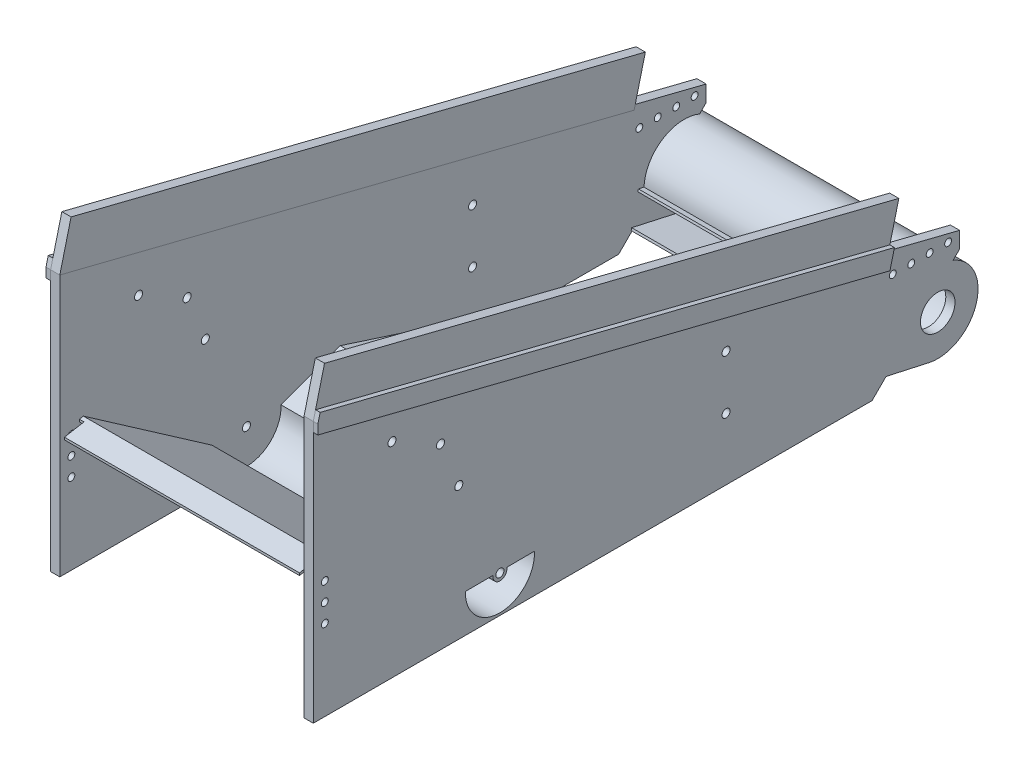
ISO-10303-21;
HEADER;
FILE_DESCRIPTION(('STEP AP214'),'2;1');
FILE_NAME('part.step','',(''),(''),'','','');
FILE_SCHEMA(('AUTOMOTIVE_DESIGN { 1 0 10303 214 1 1 1 1 }'));
ENDSEC;
DATA;
#1=APPLICATION_CONTEXT('core data for automotive mechanical design processes');
#2=APPLICATION_PROTOCOL_DEFINITION('international standard','automotive_design',2000,#1);
#3=PRODUCT_CONTEXT('',#1,'mechanical');
#4=PRODUCT('Part','Part','',(#3));
#5=PRODUCT_RELATED_PRODUCT_CATEGORY('part','',(#4));
#6=PRODUCT_DEFINITION_FORMATION('','',#4);
#7=PRODUCT_DEFINITION_CONTEXT('part definition',#1,'design');
#8=PRODUCT_DEFINITION('design','',#6,#7);
#9=PRODUCT_DEFINITION_SHAPE('','',#8);
#10=(LENGTH_UNIT() NAMED_UNIT(*) SI_UNIT(.MILLI.,.METRE.));
#11=(NAMED_UNIT(*) PLANE_ANGLE_UNIT() SI_UNIT($,.RADIAN.));
#12=(NAMED_UNIT(*) SI_UNIT($,.STERADIAN.) SOLID_ANGLE_UNIT());
#13=UNCERTAINTY_MEASURE_WITH_UNIT(LENGTH_MEASURE(1.E-05),#10,'distance_accuracy_value','');
#14=(GEOMETRIC_REPRESENTATION_CONTEXT(3) GLOBAL_UNCERTAINTY_ASSIGNED_CONTEXT((#13)) GLOBAL_UNIT_ASSIGNED_CONTEXT((#10,
#11,#12)) REPRESENTATION_CONTEXT('',''));
#15=CARTESIAN_POINT('',(0.,0.,0.));
#16=DIRECTION('',(0.,0.,1.));
#17=DIRECTION('',(1.,0.,0.));
#18=AXIS2_PLACEMENT_3D('',#15,#16,#17);
#19=CARTESIAN_POINT('',(570.000000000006,-239.999999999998,-1307.5));
#20=DIRECTION('',(-1.,0.,0.));
#21=DIRECTION('',(0.,0.,1.));
#22=AXIS2_PLACEMENT_3D('',#19,#20,#21);
#23=CYLINDRICAL_SURFACE('',#22,165.);
#24=CARTESIAN_POINT('',(-530.,-239.999999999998,-1307.5));
#25=DIRECTION('',(1.,0.,0.));
#26=DIRECTION('',(0.,0.,-1.));
#27=AXIS2_PLACEMENT_3D('',#24,#25,#26);
#28=CIRCLE('',#27,165.);
#29=CARTESIAN_POINT('',(-530.,-244.905824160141,-1142.5729467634));
#30=VERTEX_POINT('',#29);
#31=CARTESIAN_POINT('',(-530.,-401.088841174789,-1271.78746370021));
#32=VERTEX_POINT('',#31);
#33=EDGE_CURVE('E349',#30,#32,#28,.F.);
#34=ORIENTED_EDGE('',*,*,#33,.T.);
#35=DIRECTION('',(-1.,0.,0.));
#36=VECTOR('',#35,1.);
#37=CARTESIAN_POINT('',(570.000000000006,-401.088841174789,-1271.78746370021));
#38=LINE('',#37,#36);
#39=CARTESIAN_POINT('',(530.,-401.088841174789,-1271.78746370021));
#40=VERTEX_POINT('',#39);
#41=EDGE_CURVE('E363',#40,#32,#38,.T.);
#42=ORIENTED_EDGE('',*,*,#41,.F.);
#43=CARTESIAN_POINT('',(530.,-239.999999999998,-1307.5));
#44=DIRECTION('',(1.,0.,0.));
#45=DIRECTION('',(0.,0.,-1.));
#46=AXIS2_PLACEMENT_3D('',#43,#44,#45);
#47=CIRCLE('',#46,165.);
#48=CARTESIAN_POINT('',(530.,-244.905824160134,-1142.5729467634));
#49=VERTEX_POINT('',#48);
#50=EDGE_CURVE('E68',#49,#40,#47,.F.);
#51=ORIENTED_EDGE('',*,*,#50,.F.);
#52=DIRECTION('',(-1.,0.,0.));
#53=VECTOR('',#52,1.);
#54=CARTESIAN_POINT('',(570.000000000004,-244.905824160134,-1142.5729467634));
#55=LINE('',#54,#53);
#56=EDGE_CURVE('E365',#49,#30,#55,.T.);
#57=ORIENTED_EDGE('',*,*,#56,.T.);
#58=EDGE_LOOP('',(#34,#42,#51,#57));
#59=FACE_BOUND('',#58,.T.);
#60=ADVANCED_FACE('F52',(#59),#23,.F.);
#61=CARTESIAN_POINT('',(570.,-113.559087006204,25.1754434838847));
#62=DIRECTION('',(0.,0.976296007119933,-0.216439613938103));
#63=DIRECTION('',(0.,0.216439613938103,0.976296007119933));
#64=AXIS2_PLACEMENT_3D('',#61,#62,#63);
#65=PLANE('',#64);
#66=ORIENTED_EDGE('',*,*,#41,.T.);
#67=DIRECTION('',(0.,0.216439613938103,0.976296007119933));
#68=VECTOR('',#67,1.);
#69=CARTESIAN_POINT('',(-530.,-113.559087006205,25.1754434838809));
#70=LINE('',#69,#68);
#71=CARTESIAN_POINT('',(-530.,-358.380094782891,-1079.14075816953));
#72=VERTEX_POINT('',#71);
#73=EDGE_CURVE('E345',#32,#72,#70,.T.);
#74=ORIENTED_EDGE('',*,*,#73,.T.);
#75=DIRECTION('',(-1.,0.,0.));
#76=VECTOR('',#75,1.);
#77=CARTESIAN_POINT('',(570.000000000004,-358.380094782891,-1079.14075816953));
#78=LINE('',#77,#76);
#79=CARTESIAN_POINT('',(530.,-358.380094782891,-1079.14075816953));
#80=VERTEX_POINT('',#79);
#81=EDGE_CURVE('E369',#80,#72,#78,.T.);
#82=ORIENTED_EDGE('',*,*,#81,.F.);
#83=DIRECTION('',(0.,0.216439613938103,0.976296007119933));
#84=VECTOR('',#83,1.);
#85=CARTESIAN_POINT('',(530.,-113.559087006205,25.1754434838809));
#86=LINE('',#85,#84);
#87=EDGE_CURVE('E357',#40,#80,#86,.T.);
#88=ORIENTED_EDGE('',*,*,#87,.F.);
#89=EDGE_LOOP('',(#66,#74,#82,#88));
#90=FACE_BOUND('',#89,.T.);
#91=ADVANCED_FACE('F367',(#90),#65,.T.);
#92=CARTESIAN_POINT('',(570.,-50.,-1402.5));
#93=DIRECTION('',(0.,0.707106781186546,0.707106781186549));
#94=DIRECTION('',(0.,-0.707106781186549,0.707106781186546));
#95=AXIS2_PLACEMENT_3D('',#92,#93,#94);
#96=PLANE('',#95);
#97=DIRECTION('',(-1.,0.,0.));
#98=VECTOR('',#97,1.);
#99=CARTESIAN_POINT('',(570.,-369.482371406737,-1083.01762859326));
#100=LINE('',#99,#98);
#101=CARTESIAN_POINT('',(570.,-369.482371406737,-1083.01762859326));
#102=VERTEX_POINT('',#101);
#103=CARTESIAN_POINT('',(530.,-369.482371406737,-1083.01762859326));
#104=VERTEX_POINT('',#103);
#105=EDGE_CURVE('E382',#102,#104,#100,.T.);
#106=ORIENTED_EDGE('',*,*,#105,.F.);
#107=DIRECTION('',(0.,0.707106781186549,-0.707106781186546));
#108=VECTOR('',#107,1.);
#109=CARTESIAN_POINT('',(570.,-50.,-1402.5));
#110=LINE('',#109,#108);
#111=CARTESIAN_POINT('',(570.,-430.,-1022.5));
#112=VERTEX_POINT('',#111);
#113=EDGE_CURVE('E727',#112,#102,#110,.T.);
#114=ORIENTED_EDGE('',*,*,#113,.F.);
#115=DIRECTION('',(-1.,0.,0.));
#116=VECTOR('',#115,1.);
#117=CARTESIAN_POINT('',(570.,-430.,-1022.5));
#118=LINE('',#117,#116);
#119=CARTESIAN_POINT('',(530.,-430.,-1022.5));
#120=VERTEX_POINT('',#119);
#121=EDGE_CURVE('E707',#112,#120,#118,.T.);
#122=ORIENTED_EDGE('',*,*,#121,.T.);
#123=DIRECTION('',(0.,0.707106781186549,-0.707106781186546));
#124=VECTOR('',#123,1.);
#125=CARTESIAN_POINT('',(530.,-50.,-1402.5));
#126=LINE('',#125,#124);
#127=EDGE_CURVE('E710',#120,#104,#126,.T.);
#128=ORIENTED_EDGE('',*,*,#127,.T.);
#129=EDGE_LOOP('',(#106,#114,#122,#128));
#130=FACE_BOUND('',#129,.T.);
#131=ADVANCED_FACE('F885',(#130),#96,.F.);
#132=DIRECTION('',(-1.,0.,0.));
#133=VECTOR('',#132,1.);
#134=CARTESIAN_POINT('',(570.000000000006,-78.2360511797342,-1374.26394882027));
#135=LINE('',#134,#133);
#136=CARTESIAN_POINT('',(530.,-78.2360511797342,-1374.26394882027));
#137=VERTEX_POINT('',#136);
#138=CARTESIAN_POINT('',(570.,-78.2360511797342,-1374.26394882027));
#139=VERTEX_POINT('',#138);
#140=EDGE_CURVE('E371',#137,#139,#135,.F.);
#141=ORIENTED_EDGE('',*,*,#140,.F.);
#142=CARTESIAN_POINT('',(530.,-50.,-1402.5));
#143=VERTEX_POINT('',#142);
#144=EDGE_CURVE('E718',#137,#143,#126,.T.);
#145=ORIENTED_EDGE('',*,*,#144,.T.);
#146=DIRECTION('',(-1.,0.,0.));
#147=VECTOR('',#146,1.);
#148=CARTESIAN_POINT('',(570.,-50.,-1402.5));
#149=LINE('',#148,#147);
#150=CARTESIAN_POINT('',(570.,-50.,-1402.5));
#151=VERTEX_POINT('',#150);
#152=EDGE_CURVE('E700',#151,#143,#149,.T.);
#153=ORIENTED_EDGE('',*,*,#152,.F.);
#154=EDGE_CURVE('E730',#139,#151,#110,.T.);
#155=ORIENTED_EDGE('',*,*,#154,.F.);
#156=EDGE_LOOP('',(#141,#145,#153,#155));
#157=FACE_BOUND('',#156,.T.);
#158=ADVANCED_FACE('F1070',(#157),#96,.F.);
#159=CARTESIAN_POINT('',(-570.,-50.,-1402.5));
#160=DIRECTION('',(0.,-0.707106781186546,-0.707106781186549));
#161=DIRECTION('',(0.,0.707106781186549,-0.707106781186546));
#162=AXIS2_PLACEMENT_3D('',#159,#160,#161);
#163=PLANE('',#162);
#164=DIRECTION('',(0.,0.707106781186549,-0.707106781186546));
#165=VECTOR('',#164,1.);
#166=CARTESIAN_POINT('',(-570.,-50.,-1402.5));
#167=LINE('',#166,#165);
#168=CARTESIAN_POINT('',(-570.,-430.,-1022.5));
#169=VERTEX_POINT('',#168);
#170=CARTESIAN_POINT('',(-570.,-369.482371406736,-1083.01762859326));
#171=VERTEX_POINT('',#170);
#172=EDGE_CURVE('E553',#169,#171,#167,.T.);
#173=ORIENTED_EDGE('',*,*,#172,.T.);
#174=DIRECTION('',(1.,0.,0.));
#175=VECTOR('',#174,1.);
#176=CARTESIAN_POINT('',(-570.,-369.482371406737,-1083.01762859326));
#177=LINE('',#176,#175);
#178=CARTESIAN_POINT('',(-530.,-369.482371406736,-1083.01762859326));
#179=VERTEX_POINT('',#178);
#180=EDGE_CURVE('E12',#171,#179,#177,.T.);
#181=ORIENTED_EDGE('',*,*,#180,.T.);
#182=DIRECTION('',(0.,0.707106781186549,-0.707106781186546));
#183=VECTOR('',#182,1.);
#184=CARTESIAN_POINT('',(-530.,-50.,-1402.5));
#185=LINE('',#184,#183);
#186=CARTESIAN_POINT('',(-530.,-430.,-1022.5));
#187=VERTEX_POINT('',#186);
#188=EDGE_CURVE('E566',#187,#179,#185,.T.);
#189=ORIENTED_EDGE('',*,*,#188,.F.);
#190=DIRECTION('',(1.,0.,0.));
#191=VECTOR('',#190,1.);
#192=CARTESIAN_POINT('',(-570.,-430.,-1022.5));
#193=LINE('',#192,#191);
#194=EDGE_CURVE('E575',#169,#187,#193,.T.);
#195=ORIENTED_EDGE('',*,*,#194,.F.);
#196=EDGE_LOOP('',(#173,#181,#189,#195));
#197=FACE_BOUND('',#196,.T.);
#198=ADVANCED_FACE('F925',(#197),#163,.T.);
#199=CARTESIAN_POINT('',(-530.,-78.2360511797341,-1374.26394882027));
#200=VERTEX_POINT('',#199);
#201=CARTESIAN_POINT('',(-530.,-50.,-1402.5));
#202=VERTEX_POINT('',#201);
#203=EDGE_CURVE('E564',#200,#202,#185,.T.);
#204=ORIENTED_EDGE('',*,*,#203,.F.);
#205=DIRECTION('',(-1.,0.,0.));
#206=VECTOR('',#205,1.);
#207=CARTESIAN_POINT('',(570.000000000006,-78.2360511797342,-1374.26394882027));
#208=LINE('',#207,#206);
#209=CARTESIAN_POINT('',(-569.999999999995,-78.2360511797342,-1374.26394882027));
#210=VERTEX_POINT('',#209);
#211=EDGE_CURVE('E61',#200,#210,#208,.T.);
#212=ORIENTED_EDGE('',*,*,#211,.T.);
#213=CARTESIAN_POINT('',(-570.,-50.,-1402.5));
#214=VERTEX_POINT('',#213);
#215=EDGE_CURVE('E552',#210,#214,#167,.T.);
#216=ORIENTED_EDGE('',*,*,#215,.T.);
#217=DIRECTION('',(1.,0.,0.));
#218=VECTOR('',#217,1.);
#219=CARTESIAN_POINT('',(-570.,-50.,-1402.5));
#220=LINE('',#219,#218);
#221=EDGE_CURVE('E571',#214,#202,#220,.T.);
#222=ORIENTED_EDGE('',*,*,#221,.T.);
#223=EDGE_LOOP('',(#204,#212,#216,#222));
#224=FACE_BOUND('',#223,.T.);
#225=ADVANCED_FACE('F838',(#224),#163,.T.);
#226=CARTESIAN_POINT('',(530.,0.,0.));
#227=DIRECTION('',(1.,0.,0.));
#228=DIRECTION('',(0.,0.,-1.));
#229=AXIS2_PLACEMENT_3D('',#226,#227,#228);
#230=PLANE('',#229);
#231=CARTESIAN_POINT('',(530.,-240.,-1307.5));
#232=DIRECTION('',(1.,0.,0.));
#233=DIRECTION('',(0.,0.,-1.));
#234=AXIS2_PLACEMENT_3D('',#231,#232,#233);
#235=CIRCLE('',#234,75.);
#236=CARTESIAN_POINT('',(530.,-240.,-1382.5));
#237=VERTEX_POINT('',#236);
#238=EDGE_CURVE('E855',#237,#237,#235,.T.);
#239=ORIENTED_EDGE('',*,*,#238,.T.);
#240=EDGE_LOOP('',(#239));
#241=FACE_BOUND('',#240,.T.);
#242=ORIENTED_EDGE('',*,*,#50,.T.);
#243=ORIENTED_EDGE('',*,*,#87,.T.);
#244=DIRECTION('',(0.,0.976296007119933,-0.216439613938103));
#245=VECTOR('',#244,1.);
#246=CARTESIAN_POINT('',(530.,-244.821007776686,-1104.31620165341));
#247=LINE('',#246,#245);
#248=CARTESIAN_POINT('',(530.,-368.14305485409,-1076.97636203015));
#249=VERTEX_POINT('',#248);
#250=EDGE_CURVE('E402',#249,#80,#247,.T.);
#251=ORIENTED_EDGE('',*,*,#250,.F.);
#252=DIRECTION('',(0.,0.216439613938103,0.976296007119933));
#253=VECTOR('',#252,1.);
#254=CARTESIAN_POINT('',(530.,-123.322047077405,27.339839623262));
#255=LINE('',#254,#253);
#256=EDGE_CURVE('E358',#104,#249,#255,.T.);
#257=ORIENTED_EDGE('',*,*,#256,.F.);
#258=ORIENTED_EDGE('',*,*,#127,.F.);
#259=DIRECTION('',(0.,0.,-1.));
#260=VECTOR('',#259,1.);
#261=CARTESIAN_POINT('',(530.,-430.,-1022.5));
#262=LINE('',#261,#260);
#263=CARTESIAN_POINT('',(530.,-430.,-622.500000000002));
#264=VERTEX_POINT('',#263);
#265=EDGE_CURVE('E686',#264,#120,#262,.T.);
#266=ORIENTED_EDGE('',*,*,#265,.F.);
#267=DIRECTION('',(0.,0.306949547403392,0.951725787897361));
#268=VECTOR('',#267,1.);
#269=CARTESIAN_POINT('',(530.,-430.,-622.500000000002));
#270=LINE('',#269,#268);
#271=CARTESIAN_POINT('',(530.,-169.429559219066,185.423028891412));
#272=VERTEX_POINT('',#271);
#273=EDGE_CURVE('E612',#264,#272,#270,.T.);
#274=ORIENTED_EDGE('',*,*,#273,.T.);
#275=DIRECTION('',(0.,-0.342020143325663,0.93969262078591));
#276=VECTOR('',#275,1.);
#277=CARTESIAN_POINT('',(530.,-169.429559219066,185.423028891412));
#278=LINE('',#277,#276);
#279=CARTESIAN_POINT('',(530.,-263.056449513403,442.660795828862));
#280=VERTEX_POINT('',#279);
#281=EDGE_CURVE('E615',#272,#280,#278,.T.);
#282=ORIENTED_EDGE('',*,*,#281,.T.);
#283=DIRECTION('',(0.,0.00593958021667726,-0.99998236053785));
#284=VECTOR('',#283,1.);
#285=CARTESIAN_POINT('',(530.,-260.417996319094,-1.54680086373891));
#286=LINE('',#285,#284);
#287=CARTESIAN_POINT('',(530.,-263.772138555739,563.153556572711));
#288=VERTEX_POINT('',#287);
#289=EDGE_CURVE('E426',#288,#280,#286,.T.);
#290=ORIENTED_EDGE('',*,*,#289,.F.);
#291=CARTESIAN_POINT('',(530.,-270.,592.5));
#292=DIRECTION('',(1.,0.,0.));
#293=DIRECTION('',(0.,0.,-1.));
#294=AXIS2_PLACEMENT_3D('',#291,#292,#293);
#295=CIRCLE('',#294,30.0000000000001);
#296=CARTESIAN_POINT('',(530.,-264.121182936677,621.918353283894));
#297=VERTEX_POINT('',#296);
#298=EDGE_CURVE('E428',#297,#288,#295,.T.);
#299=ORIENTED_EDGE('',*,*,#298,.F.);
#300=DIRECTION('',(0.,0.00593958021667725,-0.99998236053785));
#301=VECTOR('',#300,1.);
#302=CARTESIAN_POINT('',(530.,-260.417996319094,-1.54680086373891));
#303=LINE('',#302,#301);
#304=CARTESIAN_POINT('',(530.,-264.836871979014,742.411114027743));
#305=VERTEX_POINT('',#304);
#306=EDGE_CURVE('E418',#305,#297,#303,.T.);
#307=ORIENTED_EDGE('',*,*,#306,.F.);
#308=DIRECTION('',(0.,0.571088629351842,0.82088840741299));
#309=VECTOR('',#308,1.);
#310=CARTESIAN_POINT('',(530.,-264.836871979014,742.411114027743));
#311=LINE('',#310,#309);
#312=CARTESIAN_POINT('',(530.,123.196965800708,1300.1747653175));
#313=VERTEX_POINT('',#312);
#314=EDGE_CURVE('E618',#305,#313,#311,.T.);
#315=ORIENTED_EDGE('',*,*,#314,.T.);
#316=DIRECTION('',(0.,-0.173648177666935,0.984807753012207));
#317=VECTOR('',#316,1.);
#318=CARTESIAN_POINT('',(530.,123.196965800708,1300.1747653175));
#319=LINE('',#318,#317);
#320=CARTESIAN_POINT('',(530.,120.142059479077,1317.5));
#321=VERTEX_POINT('',#320);
#322=EDGE_CURVE('E621',#313,#321,#319,.T.);
#323=ORIENTED_EDGE('',*,*,#322,.T.);
#324=DIRECTION('',(0.,-1.,0.));
#325=VECTOR('',#324,1.);
#326=CARTESIAN_POINT('',(530.,898.610360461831,1317.5));
#327=LINE('',#326,#325);
#328=CARTESIAN_POINT('',(530.,109.98779336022,1317.5));
#329=VERTEX_POINT('',#328);
#330=EDGE_CURVE('E438',#321,#329,#327,.T.);
#331=ORIENTED_EDGE('',*,*,#330,.T.);
#332=DIRECTION('',(0.,0.173648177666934,-0.984807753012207));
#333=VECTOR('',#332,1.);
#334=CARTESIAN_POINT('',(530.,95.,1402.5));
#335=LINE('',#334,#333);
#336=CARTESIAN_POINT('',(530.,112.632698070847,1302.5));
#337=VERTEX_POINT('',#336);
#338=EDGE_CURVE('E596',#329,#337,#335,.T.);
#339=ORIENTED_EDGE('',*,*,#338,.T.);
#340=DIRECTION('',(0.,-0.571088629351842,-0.82088840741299));
#341=VECTOR('',#340,1.);
#342=CARTESIAN_POINT('',(530.,112.632698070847,1302.5));
#343=LINE('',#342,#341);
#344=CARTESIAN_POINT('',(530.,-270.,752.5));
#345=VERTEX_POINT('',#344);
#346=EDGE_CURVE('E598',#337,#345,#343,.T.);
#347=ORIENTED_EDGE('',*,*,#346,.T.);
#348=CARTESIAN_POINT('',(530.,-270.,592.5));
#349=DIRECTION('',(1.,0.,0.));
#350=DIRECTION('',(0.,0.,-1.));
#351=AXIS2_PLACEMENT_3D('',#348,#349,#350);
#352=CIRCLE('',#351,160.);
#353=CARTESIAN_POINT('',(530.,-430.,592.5));
#354=VERTEX_POINT('',#353);
#355=EDGE_CURVE('E602',#345,#354,#352,.T.);
#356=ORIENTED_EDGE('',*,*,#355,.T.);
#357=CARTESIAN_POINT('',(530.,-430.,1402.5));
#358=VERTEX_POINT('',#357);
#359=EDGE_CURVE('E706',#358,#354,#262,.T.);
#360=ORIENTED_EDGE('',*,*,#359,.F.);
#361=DIRECTION('',(0.,-1.,0.));
#362=VECTOR('',#361,1.);
#363=CARTESIAN_POINT('',(530.,-430.,1402.5));
#364=LINE('',#363,#362);
#365=CARTESIAN_POINT('',(530.,704.645295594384,1402.5));
#366=VERTEX_POINT('',#365);
#367=EDGE_CURVE('E695',#366,#358,#364,.T.);
#368=ORIENTED_EDGE('',*,*,#367,.F.);
#369=DIRECTION('',(0.,-0.243800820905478,-0.969825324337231));
#370=VECTOR('',#369,1.);
#371=CARTESIAN_POINT('',(530.,331.1489916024,-83.2463269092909));
#372=LINE('',#371,#370);
#373=CARTESIAN_POINT('',(530.,78.0861832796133,-1089.91529236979));
#374=VERTEX_POINT('',#373);
#375=EDGE_CURVE('E691',#366,#374,#372,.T.);
#376=ORIENTED_EDGE('',*,*,#375,.T.);
#377=DIRECTION('',(0.,0.969825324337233,-0.24380082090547));
#378=VECTOR('',#377,1.);
#379=CARTESIAN_POINT('',(530.,-253.06280832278,-1006.6689654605));
#380=LINE('',#379,#378);
#381=CARTESIAN_POINT('',(530.,97.482689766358,-1094.7913087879));
#382=VERTEX_POINT('',#381);
#383=EDGE_CURVE('E687',#374,#382,#380,.T.);
#384=ORIENTED_EDGE('',*,*,#383,.T.);
#385=DIRECTION('',(0.,-0.243800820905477,-0.969825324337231));
#386=VECTOR('',#385,1.);
#387=CARTESIAN_POINT('',(530.,350.545498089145,-88.1223433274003));
#388=LINE('',#387,#386);
#389=CARTESIAN_POINT('',(530.,20.1289337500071,-1402.5));
#390=VERTEX_POINT('',#389);
#391=EDGE_CURVE('E690',#382,#390,#388,.T.);
#392=ORIENTED_EDGE('',*,*,#391,.T.);
#393=DIRECTION('',(0.,1.,0.));
#394=VECTOR('',#393,1.);
#395=CARTESIAN_POINT('',(530.,-50.,-1402.5));
#396=LINE('',#395,#394);
#397=EDGE_CURVE('E701',#143,#390,#396,.T.);
#398=ORIENTED_EDGE('',*,*,#397,.F.);
#399=ORIENTED_EDGE('',*,*,#144,.F.);
#400=CARTESIAN_POINT('',(530.,-239.999999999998,-1307.5));
#401=DIRECTION('',(1.,0.,0.));
#402=DIRECTION('',(0.,0.,-1.));
#403=AXIS2_PLACEMENT_3D('',#400,#401,#402);
#404=CIRCLE('',#403,175.);
#405=CARTESIAN_POINT('',(530.,-232.465881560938,-1132.66225504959));
#406=VERTEX_POINT('',#405);
#407=EDGE_CURVE('E378',#406,#137,#404,.F.);
#408=ORIENTED_EDGE('',*,*,#407,.F.);
#409=DIRECTION('',(0.,0.216439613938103,0.976296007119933));
#410=VECTOR('',#409,1.);
#411=CARTESIAN_POINT('',(530.,17.7661165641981,-3.93865321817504));
#412=LINE('',#411,#410);
#413=CARTESIAN_POINT('',(530.,-227.054891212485,-1108.25485487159));
#414=VERTEX_POINT('',#413);
#415=EDGE_CURVE('E398',#406,#414,#412,.T.);
#416=ORIENTED_EDGE('',*,*,#415,.T.);
#417=DIRECTION('',(0.,0.976296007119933,-0.216439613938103));
#418=VECTOR('',#417,1.);
#419=CARTESIAN_POINT('',(530.,-244.821007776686,-1104.31620165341));
#420=LINE('',#419,#418);
#421=CARTESIAN_POINT('',(530.,-236.817851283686,-1106.09045873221));
#422=VERTEX_POINT('',#421);
#423=EDGE_CURVE('E393',#422,#414,#420,.T.);
#424=ORIENTED_EDGE('',*,*,#423,.F.);
#425=DIRECTION('',(0.,0.216439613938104,0.976296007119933));
#426=VECTOR('',#425,1.);
#427=CARTESIAN_POINT('',(530.,8.00315649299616,-1.77425707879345));
#428=LINE('',#427,#426);
#429=EDGE_CURVE('E389',#49,#422,#428,.T.);
#430=ORIENTED_EDGE('',*,*,#429,.F.);
#431=EDGE_LOOP('',(#242,#243,#251,#257,#258,#266,#274,#282,#290,#299,#307,#315,#323,#331,#339,
#347,#356,#360,#368,#376,#384,#392,#398,#399,#408,#416,#424,#430));
#432=FACE_BOUND('',#431,.T.);
#433=CARTESIAN_POINT('',(530.,-80.,1352.5));
#434=DIRECTION('',(1.,0.,0.));
#435=DIRECTION('',(0.,0.,-1.));
#436=AXIS2_PLACEMENT_3D('',#433,#434,#435);
#437=CIRCLE('',#436,14.9999999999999);
#438=CARTESIAN_POINT('',(530.,-80.,1337.5));
#439=VERTEX_POINT('',#438);
#440=EDGE_CURVE('E749',#439,#439,#437,.T.);
#441=ORIENTED_EDGE('',*,*,#440,.T.);
#442=EDGE_LOOP('',(#441));
#443=FACE_BOUND('',#442,.T.);
#444=CARTESIAN_POINT('',(530.,457.605407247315,1060.89636316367));
#445=DIRECTION('',(1.,0.,0.));
#446=DIRECTION('',(0.,0.,-1.));
#447=AXIS2_PLACEMENT_3D('',#444,#445,#446);
#448=CIRCLE('',#447,17.5);
#449=CARTESIAN_POINT('',(530.,457.605407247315,1043.39636316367));
#450=VERTEX_POINT('',#449);
#451=EDGE_CURVE('E726',#450,#450,#448,.T.);
#452=ORIENTED_EDGE('',*,*,#451,.T.);
#453=EDGE_LOOP('',(#452));
#454=FACE_BOUND('',#453,.T.);
#455=CARTESIAN_POINT('',(530.,343.393926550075,850.28108416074));
#456=DIRECTION('',(1.,0.,0.));
#457=DIRECTION('',(0.,0.,-1.));
#458=AXIS2_PLACEMENT_3D('',#455,#456,#457);
#459=CIRCLE('',#458,17.4999999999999);
#460=CARTESIAN_POINT('',(530.,343.393926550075,832.78108416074));
#461=VERTEX_POINT('',#460);
#462=EDGE_CURVE('E797',#461,#461,#459,.T.);
#463=ORIENTED_EDGE('',*,*,#462,.T.);
#464=EDGE_LOOP('',(#463));
#465=FACE_BOUND('',#464,.T.);
#466=CARTESIAN_POINT('',(530.,-160.696199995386,-388.725457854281));
#467=DIRECTION('',(1.,0.,0.));
#468=DIRECTION('',(0.,0.,-1.));
#469=AXIS2_PLACEMENT_3D('',#466,#467,#468);
#470=CIRCLE('',#469,17.5);
#471=CARTESIAN_POINT('',(530.,-160.696199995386,-406.225457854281));
#472=VERTEX_POINT('',#471);
#473=EDGE_CURVE('E803',#472,#472,#470,.T.);
#474=ORIENTED_EDGE('',*,*,#473,.T.);
#475=EDGE_LOOP('',(#474));
#476=FACE_BOUND('',#475,.T.);
#477=CARTESIAN_POINT('',(530.,147.689611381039,770.971998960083));
#478=DIRECTION('',(1.,0.,0.));
#479=DIRECTION('',(0.,0.,-1.));
#480=AXIS2_PLACEMENT_3D('',#477,#478,#479);
#481=CIRCLE('',#480,17.4999999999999);
#482=CARTESIAN_POINT('',(530.,147.689611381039,753.471998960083));
#483=VERTEX_POINT('',#482);
#484=EDGE_CURVE('E809',#483,#483,#481,.T.);
#485=ORIENTED_EDGE('',*,*,#484,.T.);
#486=EDGE_LOOP('',(#485));
#487=FACE_BOUND('',#486,.T.);
#488=CARTESIAN_POINT('',(530.,72.1231430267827,-388.725457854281));
#489=DIRECTION('',(1.,0.,0.));
#490=DIRECTION('',(0.,0.,-1.));
#491=AXIS2_PLACEMENT_3D('',#488,#489,#490);
#492=CIRCLE('',#491,17.5);
#493=CARTESIAN_POINT('',(530.,72.1231430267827,-406.225457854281));
#494=VERTEX_POINT('',#493);
#495=EDGE_CURVE('E776',#494,#494,#492,.T.);
#496=ORIENTED_EDGE('',*,*,#495,.T.);
#497=EDGE_LOOP('',(#496));
#498=FACE_BOUND('',#497,.T.);
#499=CARTESIAN_POINT('',(530.,4.96900438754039E-13,-1352.5));
#500=DIRECTION('',(1.,0.,0.));
#501=DIRECTION('',(0.,0.,-1.));
#502=AXIS2_PLACEMENT_3D('',#499,#500,#501);
#503=CIRCLE('',#502,14.9999999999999);
#504=CARTESIAN_POINT('',(530.,4.96900438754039E-13,-1367.5));
#505=VERTEX_POINT('',#504);
#506=EDGE_CURVE('E734',#505,#505,#503,.T.);
#507=ORIENTED_EDGE('',*,*,#506,.T.);
#508=EDGE_LOOP('',(#507));
#509=FACE_BOUND('',#508,.T.);
#510=CARTESIAN_POINT('',(530.,0.,-1272.5));
#511=DIRECTION('',(1.,0.,0.));
#512=DIRECTION('',(0.,0.,-1.));
#513=AXIS2_PLACEMENT_3D('',#510,#511,#512);
#514=CIRCLE('',#513,14.9999999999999);
#515=CARTESIAN_POINT('',(530.,0.,-1287.5));
#516=VERTEX_POINT('',#515);
#517=EDGE_CURVE('E755',#516,#516,#514,.T.);
#518=ORIENTED_EDGE('',*,*,#517,.T.);
#519=EDGE_LOOP('',(#518));
#520=FACE_BOUND('',#519,.T.);
#521=CARTESIAN_POINT('',(530.,-6.20373589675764E-13,-1192.5));
#522=DIRECTION('',(1.,0.,0.));
#523=DIRECTION('',(0.,0.,-1.));
#524=AXIS2_PLACEMENT_3D('',#521,#522,#523);
#525=CIRCLE('',#524,14.9999999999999);
#526=CARTESIAN_POINT('',(530.,-6.20373589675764E-13,-1207.5));
#527=VERTEX_POINT('',#526);
#528=EDGE_CURVE('E761',#527,#527,#525,.T.);
#529=ORIENTED_EDGE('',*,*,#528,.T.);
#530=EDGE_LOOP('',(#529));
#531=FACE_BOUND('',#530,.T.);
#532=CARTESIAN_POINT('',(530.,-1.17901060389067E-12,-1112.5));
#533=DIRECTION('',(1.,0.,0.));
#534=DIRECTION('',(0.,0.,-1.));
#535=AXIS2_PLACEMENT_3D('',#532,#533,#534);
#536=CIRCLE('',#535,14.9999999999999);
#537=CARTESIAN_POINT('',(530.,-1.17901060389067E-12,-1127.5));
#538=VERTEX_POINT('',#537);
#539=EDGE_CURVE('E696',#538,#538,#536,.T.);
#540=ORIENTED_EDGE('',*,*,#539,.T.);
#541=EDGE_LOOP('',(#540));
#542=FACE_BOUND('',#541,.T.);
#543=CARTESIAN_POINT('',(530.,80.,1352.5));
#544=DIRECTION('',(1.,0.,0.));
#545=DIRECTION('',(0.,0.,-1.));
#546=AXIS2_PLACEMENT_3D('',#543,#544,#545);
#547=CIRCLE('',#546,14.9999999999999);
#548=CARTESIAN_POINT('',(530.,80.,1337.5));
#549=VERTEX_POINT('',#548);
#550=EDGE_CURVE('E737',#549,#549,#547,.T.);
#551=ORIENTED_EDGE('',*,*,#550,.T.);
#552=EDGE_LOOP('',(#551));
#553=FACE_BOUND('',#552,.T.);
#554=CARTESIAN_POINT('',(530.,0.,1352.5));
#555=DIRECTION('',(1.,0.,0.));
#556=DIRECTION('',(0.,0.,-1.));
#557=AXIS2_PLACEMENT_3D('',#554,#555,#556);
#558=CIRCLE('',#557,14.9999999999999);
#559=CARTESIAN_POINT('',(530.,0.,1337.5));
#560=VERTEX_POINT('',#559);
#561=EDGE_CURVE('E743',#560,#560,#558,.T.);
#562=ORIENTED_EDGE('',*,*,#561,.T.);
#563=EDGE_LOOP('',(#562));
#564=FACE_BOUND('',#563,.T.);
#565=CARTESIAN_POINT('',(530.,-270.,592.5));
#566=DIRECTION('',(1.,0.,0.));
#567=DIRECTION('',(0.,0.,-1.));
#568=AXIS2_PLACEMENT_3D('',#565,#566,#567);
#569=CIRCLE('',#568,17.4999999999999);
#570=CARTESIAN_POINT('',(530.,-270.,575.));
#571=VERTEX_POINT('',#570);
#572=EDGE_CURVE('E431',#571,#571,#569,.F.);
#573=ORIENTED_EDGE('',*,*,#572,.F.);
#574=EDGE_LOOP('',(#573));
#575=FACE_BOUND('',#574,.T.);
#576=ADVANCED_FACE('F879',(#241,#432,#443,#454,#465,#476,#487,#498,#509,#520,#531,#542,#553,
#564,#575),#230,.F.);
#577=CARTESIAN_POINT('',(570.,0.,0.));
#578=DIRECTION('',(1.,0.,0.));
#579=DIRECTION('',(0.,0.,-1.));
#580=AXIS2_PLACEMENT_3D('',#577,#578,#579);
#581=PLANE('',#580);
#582=CARTESIAN_POINT('',(570.,-240.,-1307.5));
#583=DIRECTION('',(1.,0.,0.));
#584=DIRECTION('',(0.,0.,-1.));
#585=AXIS2_PLACEMENT_3D('',#582,#583,#584);
#586=CIRCLE('',#585,75.);
#587=CARTESIAN_POINT('',(570.,-240.,-1382.5));
#588=VERTEX_POINT('',#587);
#589=EDGE_CURVE('E932',#588,#588,#586,.T.);
#590=ORIENTED_EDGE('',*,*,#589,.F.);
#591=EDGE_LOOP('',(#590));
#592=FACE_BOUND('',#591,.T.);
#593=CARTESIAN_POINT('',(570.000000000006,-239.999999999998,-1307.5));
#594=DIRECTION('',(1.,0.,0.));
#595=DIRECTION('',(0.,0.,-1.));
#596=AXIS2_PLACEMENT_3D('',#593,#594,#595);
#597=CIRCLE('',#596,175.);
#598=CARTESIAN_POINT('',(570.000000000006,-410.851801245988,-1269.62306756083));
#599=VERTEX_POINT('',#598);
#600=EDGE_CURVE('E76',#599,#139,#597,.T.);
#601=ORIENTED_EDGE('',*,*,#600,.T.);
#602=ORIENTED_EDGE('',*,*,#154,.T.);
#603=DIRECTION('',(0.,1.,0.));
#604=VECTOR('',#603,1.);
#605=CARTESIAN_POINT('',(570.,-50.,-1402.5));
#606=LINE('',#605,#604);
#607=CARTESIAN_POINT('',(570.,20.1289337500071,-1402.5));
#608=VERTEX_POINT('',#607);
#609=EDGE_CURVE('E723',#151,#608,#606,.T.);
#610=ORIENTED_EDGE('',*,*,#609,.T.);
#611=DIRECTION('',(0.,-0.243800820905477,-0.969825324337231));
#612=VECTOR('',#611,1.);
#613=CARTESIAN_POINT('',(570.,17.0284188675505,-1414.83366581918));
#614=LINE('',#613,#612);
#615=CARTESIAN_POINT('',(570.,97.482689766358,-1094.7913087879));
#616=VERTEX_POINT('',#615);
#617=EDGE_CURVE('E783',#616,#608,#614,.T.);
#618=ORIENTED_EDGE('',*,*,#617,.F.);
#619=DIRECTION('',(0.,0.969825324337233,-0.24380082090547));
#620=VECTOR('',#619,1.);
#621=CARTESIAN_POINT('',(570.,97.482689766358,-1094.7913087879));
#622=LINE('',#621,#620);
#623=CARTESIAN_POINT('',(570.,78.0861832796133,-1089.91529236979));
#624=VERTEX_POINT('',#623);
#625=EDGE_CURVE('E780',#624,#616,#622,.T.);
#626=ORIENTED_EDGE('',*,*,#625,.F.);
#627=DIRECTION('',(0.,-0.243800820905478,-0.969825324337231));
#628=VECTOR('',#627,1.);
#629=CARTESIAN_POINT('',(570.,78.0861832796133,-1089.91529236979));
#630=LINE('',#629,#628);
#631=CARTESIAN_POINT('',(570.,704.645295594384,1402.5));
#632=VERTEX_POINT('',#631);
#633=EDGE_CURVE('E784',#632,#624,#630,.T.);
#634=ORIENTED_EDGE('',*,*,#633,.F.);
#635=DIRECTION('',(0.,-1.,0.));
#636=VECTOR('',#635,1.);
#637=CARTESIAN_POINT('',(570.,-430.,1402.5));
#638=LINE('',#637,#636);
#639=CARTESIAN_POINT('',(570.,-430.,1402.5));
#640=VERTEX_POINT('',#639);
#641=EDGE_CURVE('E705',#632,#640,#638,.T.);
#642=ORIENTED_EDGE('',*,*,#641,.T.);
#643=DIRECTION('',(0.,0.,-1.));
#644=VECTOR('',#643,1.);
#645=CARTESIAN_POINT('',(570.,-430.,-1022.5));
#646=LINE('',#645,#644);
#647=EDGE_CURVE('E731',#640,#112,#646,.T.);
#648=ORIENTED_EDGE('',*,*,#647,.T.);
#649=ORIENTED_EDGE('',*,*,#113,.T.);
#650=DIRECTION('',(0.,-0.216439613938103,-0.976296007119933));
#651=VECTOR('',#650,1.);
#652=CARTESIAN_POINT('',(570.,-123.322047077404,27.3398396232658));
#653=LINE('',#652,#651);
#654=EDGE_CURVE('E851',#102,#599,#653,.T.);
#655=ORIENTED_EDGE('',*,*,#654,.T.);
#656=EDGE_LOOP('',(#601,#602,#610,#618,#626,#634,#642,#648,#649,#655));
#657=FACE_BOUND('',#656,.T.);
#658=DIRECTION('',(0.,0.00593958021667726,-0.99998236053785));
#659=VECTOR('',#658,1.);
#660=CARTESIAN_POINT('',(570.,-260.417996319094,-1.54680086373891));
#661=LINE('',#660,#659);
#662=CARTESIAN_POINT('',(570.,-263.772138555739,563.153556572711));
#663=VERTEX_POINT('',#662);
#664=CARTESIAN_POINT('',(570.,-263.056449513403,442.660795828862));
#665=VERTEX_POINT('',#664);
#666=EDGE_CURVE('E423',#663,#665,#661,.T.);
#667=ORIENTED_EDGE('',*,*,#666,.T.);
#668=CARTESIAN_POINT('',(570.,-270.,592.5));
#669=DIRECTION('',(1.,0.,0.));
#670=DIRECTION('',(0.,0.,-1.));
#671=AXIS2_PLACEMENT_3D('',#668,#669,#670);
#672=CIRCLE('',#671,150.);
#673=CARTESIAN_POINT('',(570.,-264.836871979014,742.411114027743));
#674=VERTEX_POINT('',#673);
#675=EDGE_CURVE('E420',#665,#674,#672,.F.);
#676=ORIENTED_EDGE('',*,*,#675,.T.);
#677=DIRECTION('',(0.,0.00593958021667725,-0.99998236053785));
#678=VECTOR('',#677,1.);
#679=CARTESIAN_POINT('',(570.,-260.417996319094,-1.54680086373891));
#680=LINE('',#679,#678);
#681=CARTESIAN_POINT('',(570.,-264.121182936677,621.918353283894));
#682=VERTEX_POINT('',#681);
#683=EDGE_CURVE('E415',#674,#682,#680,.T.);
#684=ORIENTED_EDGE('',*,*,#683,.T.);
#685=CARTESIAN_POINT('',(570.,-270.,592.5));
#686=DIRECTION('',(1.,0.,0.));
#687=DIRECTION('',(0.,0.,-1.));
#688=AXIS2_PLACEMENT_3D('',#685,#686,#687);
#689=CIRCLE('',#688,30.0000000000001);
#690=EDGE_CURVE('E826',#682,#663,#689,.T.);
#691=ORIENTED_EDGE('',*,*,#690,.T.);
#692=EDGE_LOOP('',(#667,#676,#684,#691));
#693=FACE_BOUND('',#692,.T.);
#694=CARTESIAN_POINT('',(570.,-1.17901060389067E-12,-1112.5));
#695=DIRECTION('',(1.,0.,0.));
#696=DIRECTION('',(0.,0.,-1.));
#697=AXIS2_PLACEMENT_3D('',#694,#695,#696);
#698=CIRCLE('',#697,14.9999999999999);
#699=CARTESIAN_POINT('',(570.,-1.17901060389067E-12,-1127.5));
#700=VERTEX_POINT('',#699);
#701=EDGE_CURVE('E769',#700,#700,#698,.T.);
#702=ORIENTED_EDGE('',*,*,#701,.F.);
#703=EDGE_LOOP('',(#702));
#704=FACE_BOUND('',#703,.T.);
#705=CARTESIAN_POINT('',(570.,0.,-1272.5));
#706=DIRECTION('',(1.,0.,0.));
#707=DIRECTION('',(0.,0.,-1.));
#708=AXIS2_PLACEMENT_3D('',#705,#706,#707);
#709=CIRCLE('',#708,14.9999999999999);
#710=CARTESIAN_POINT('',(570.,0.,-1287.5));
#711=VERTEX_POINT('',#710);
#712=EDGE_CURVE('E758',#711,#711,#709,.T.);
#713=ORIENTED_EDGE('',*,*,#712,.F.);
#714=EDGE_LOOP('',(#713));
#715=FACE_BOUND('',#714,.T.);
#716=CARTESIAN_POINT('',(570.,0.,1352.5));
#717=DIRECTION('',(1.,0.,0.));
#718=DIRECTION('',(0.,0.,-1.));
#719=AXIS2_PLACEMENT_3D('',#716,#717,#718);
#720=CIRCLE('',#719,14.9999999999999);
#721=CARTESIAN_POINT('',(570.,0.,1337.5));
#722=VERTEX_POINT('',#721);
#723=EDGE_CURVE('E746',#722,#722,#720,.T.);
#724=ORIENTED_EDGE('',*,*,#723,.F.);
#725=EDGE_LOOP('',(#724));
#726=FACE_BOUND('',#725,.T.);
#727=CARTESIAN_POINT('',(570.,4.96900438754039E-13,-1352.5));
#728=DIRECTION('',(1.,0.,0.));
#729=DIRECTION('',(0.,0.,-1.));
#730=AXIS2_PLACEMENT_3D('',#727,#728,#729);
#731=CIRCLE('',#730,14.9999999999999);
#732=CARTESIAN_POINT('',(570.,4.96900438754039E-13,-1367.5));
#733=VERTEX_POINT('',#732);
#734=EDGE_CURVE('E713',#733,#733,#731,.T.);
#735=ORIENTED_EDGE('',*,*,#734,.F.);
#736=EDGE_LOOP('',(#735));
#737=FACE_BOUND('',#736,.T.);
#738=CARTESIAN_POINT('',(570.,80.,1352.5));
#739=DIRECTION('',(1.,0.,0.));
#740=DIRECTION('',(0.,0.,-1.));
#741=AXIS2_PLACEMENT_3D('',#738,#739,#740);
#742=CIRCLE('',#741,14.9999999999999);
#743=CARTESIAN_POINT('',(570.,80.,1337.5));
#744=VERTEX_POINT('',#743);
#745=EDGE_CURVE('E740',#744,#744,#742,.T.);
#746=ORIENTED_EDGE('',*,*,#745,.F.);
#747=EDGE_LOOP('',(#746));
#748=FACE_BOUND('',#747,.T.);
#749=CARTESIAN_POINT('',(570.,-80.,1352.5));
#750=DIRECTION('',(1.,0.,0.));
#751=DIRECTION('',(0.,0.,-1.));
#752=AXIS2_PLACEMENT_3D('',#749,#750,#751);
#753=CIRCLE('',#752,14.9999999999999);
#754=CARTESIAN_POINT('',(570.,-80.,1337.5));
#755=VERTEX_POINT('',#754);
#756=EDGE_CURVE('E752',#755,#755,#753,.T.);
#757=ORIENTED_EDGE('',*,*,#756,.F.);
#758=EDGE_LOOP('',(#757));
#759=FACE_BOUND('',#758,.T.);
#760=CARTESIAN_POINT('',(570.,-6.20373589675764E-13,-1192.5));
#761=DIRECTION('',(1.,0.,0.));
#762=DIRECTION('',(0.,0.,-1.));
#763=AXIS2_PLACEMENT_3D('',#760,#761,#762);
#764=CIRCLE('',#763,14.9999999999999);
#765=CARTESIAN_POINT('',(570.,-6.20373589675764E-13,-1207.5));
#766=VERTEX_POINT('',#765);
#767=EDGE_CURVE('E764',#766,#766,#764,.T.);
#768=ORIENTED_EDGE('',*,*,#767,.F.);
#769=EDGE_LOOP('',(#768));
#770=FACE_BOUND('',#769,.T.);
#771=CARTESIAN_POINT('',(570.,72.1231430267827,-388.725457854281));
#772=DIRECTION('',(1.,0.,0.));
#773=DIRECTION('',(0.,0.,-1.));
#774=AXIS2_PLACEMENT_3D('',#771,#772,#773);
#775=CIRCLE('',#774,17.5);
#776=CARTESIAN_POINT('',(570.,72.1231430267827,-406.225457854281));
#777=VERTEX_POINT('',#776);
#778=EDGE_CURVE('E786',#777,#777,#775,.T.);
#779=ORIENTED_EDGE('',*,*,#778,.F.);
#780=EDGE_LOOP('',(#779));
#781=FACE_BOUND('',#780,.T.);
#782=CARTESIAN_POINT('',(570.,147.689611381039,770.971998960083));
#783=DIRECTION('',(1.,0.,0.));
#784=DIRECTION('',(0.,0.,-1.));
#785=AXIS2_PLACEMENT_3D('',#782,#783,#784);
#786=CIRCLE('',#785,17.4999999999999);
#787=CARTESIAN_POINT('',(570.,147.689611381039,753.471998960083));
#788=VERTEX_POINT('',#787);
#789=EDGE_CURVE('E806',#788,#788,#786,.T.);
#790=ORIENTED_EDGE('',*,*,#789,.F.);
#791=EDGE_LOOP('',(#790));
#792=FACE_BOUND('',#791,.T.);
#793=CARTESIAN_POINT('',(570.,-160.696199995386,-388.725457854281));
#794=DIRECTION('',(1.,0.,0.));
#795=DIRECTION('',(0.,0.,-1.));
#796=AXIS2_PLACEMENT_3D('',#793,#794,#795);
#797=CIRCLE('',#796,17.5);
#798=CARTESIAN_POINT('',(570.,-160.696199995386,-406.225457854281));
#799=VERTEX_POINT('',#798);
#800=EDGE_CURVE('E800',#799,#799,#797,.T.);
#801=ORIENTED_EDGE('',*,*,#800,.F.);
#802=EDGE_LOOP('',(#801));
#803=FACE_BOUND('',#802,.T.);
#804=CARTESIAN_POINT('',(570.,343.393926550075,850.28108416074));
#805=DIRECTION('',(1.,0.,0.));
#806=DIRECTION('',(0.,0.,-1.));
#807=AXIS2_PLACEMENT_3D('',#804,#805,#806);
#808=CIRCLE('',#807,17.4999999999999);
#809=CARTESIAN_POINT('',(570.,343.393926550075,832.78108416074));
#810=VERTEX_POINT('',#809);
#811=EDGE_CURVE('E794',#810,#810,#808,.T.);
#812=ORIENTED_EDGE('',*,*,#811,.F.);
#813=EDGE_LOOP('',(#812));
#814=FACE_BOUND('',#813,.T.);
#815=CARTESIAN_POINT('',(570.,457.605407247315,1060.89636316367));
#816=DIRECTION('',(1.,0.,0.));
#817=DIRECTION('',(0.,0.,-1.));
#818=AXIS2_PLACEMENT_3D('',#815,#816,#817);
#819=CIRCLE('',#818,17.5);
#820=CARTESIAN_POINT('',(570.,457.605407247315,1043.39636316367));
#821=VERTEX_POINT('',#820);
#822=EDGE_CURVE('E791',#821,#821,#819,.T.);
#823=ORIENTED_EDGE('',*,*,#822,.F.);
#824=EDGE_LOOP('',(#823));
#825=FACE_BOUND('',#824,.T.);
#826=CARTESIAN_POINT('',(570.,-270.,592.5));
#827=DIRECTION('',(1.,0.,0.));
#828=DIRECTION('',(0.,0.,-1.));
#829=AXIS2_PLACEMENT_3D('',#826,#827,#828);
#830=CIRCLE('',#829,17.4999999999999);
#831=CARTESIAN_POINT('',(570.,-270.,575.));
#832=VERTEX_POINT('',#831);
#833=EDGE_CURVE('E430',#832,#832,#830,.F.);
#834=ORIENTED_EDGE('',*,*,#833,.T.);
#835=EDGE_LOOP('',(#834));
#836=FACE_BOUND('',#835,.T.);
#837=ADVANCED_FACE('F1109',(#592,#657,#693,#704,#715,#726,#737,#748,#759,#770,#781,#792,#803,
#814,#825,#836),#581,.T.);
#838=CARTESIAN_POINT('',(570.,-430.,1402.5));
#839=DIRECTION('',(0.,0.,-1.));
#840=DIRECTION('',(-1.,0.,0.));
#841=AXIS2_PLACEMENT_3D('',#838,#839,#840);
#842=PLANE('',#841);
#843=DIRECTION('',(1.,0.,0.));
#844=VECTOR('',#843,1.);
#845=CARTESIAN_POINT('',(-570.,-430.,1402.5));
#846=LINE('',#845,#844);
#847=CARTESIAN_POINT('',(-570.,-430.,1402.5));
#848=VERTEX_POINT('',#847);
#849=CARTESIAN_POINT('',(-530.,-430.,1402.5));
#850=VERTEX_POINT('',#849);
#851=EDGE_CURVE('E558',#848,#850,#846,.T.);
#852=ORIENTED_EDGE('',*,*,#851,.T.);
#853=DIRECTION('',(0.,-1.,0.));
#854=VECTOR('',#853,1.);
#855=CARTESIAN_POINT('',(-530.,-430.,1402.5));
#856=LINE('',#855,#854);
#857=CARTESIAN_POINT('',(-530.,704.645295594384,1402.5));
#858=VERTEX_POINT('',#857);
#859=EDGE_CURVE('E543',#858,#850,#856,.T.);
#860=ORIENTED_EDGE('',*,*,#859,.F.);
#861=DIRECTION('',(1.,0.,0.));
#862=VECTOR('',#861,1.);
#863=CARTESIAN_POINT('',(-570.,704.645295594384,1402.5));
#864=LINE('',#863,#862);
#865=CARTESIAN_POINT('',(-570.,704.645295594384,1402.5));
#866=VERTEX_POINT('',#865);
#867=EDGE_CURVE('E493',#866,#858,#864,.T.);
#868=ORIENTED_EDGE('',*,*,#867,.F.);
#869=DIRECTION('',(0.,-1.,0.));
#870=VECTOR('',#869,1.);
#871=CARTESIAN_POINT('',(-570.,-430.,1402.5));
#872=LINE('',#871,#870);
#873=EDGE_CURVE('E546',#866,#848,#872,.T.);
#874=ORIENTED_EDGE('',*,*,#873,.T.);
#875=EDGE_LOOP('',(#852,#860,#868,#874));
#876=FACE_BOUND('',#875,.T.);
#877=ADVANCED_FACE('F918',(#876),#842,.F.);
#878=DIRECTION('',(0.,-1.,0.));
#879=VECTOR('',#878,1.);
#880=CARTESIAN_POINT('',(-510.,898.610360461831,1402.5));
#881=LINE('',#880,#879);
#882=CARTESIAN_POINT('',(-510.,105.154266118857,1402.5));
#883=VERTEX_POINT('',#882);
#884=CARTESIAN_POINT('',(-510.,95.0000000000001,1402.5));
#885=VERTEX_POINT('',#884);
#886=EDGE_CURVE('E445',#883,#885,#881,.T.);
#887=ORIENTED_EDGE('',*,*,#886,.T.);
#888=DIRECTION('',(-1.,0.,0.));
#889=VECTOR('',#888,1.);
#890=CARTESIAN_POINT('',(530.,95.,1402.5));
#891=LINE('',#890,#889);
#892=CARTESIAN_POINT('',(510.,95.,1402.5));
#893=VERTEX_POINT('',#892);
#894=EDGE_CURVE('E683',#893,#885,#891,.T.);
#895=ORIENTED_EDGE('',*,*,#894,.F.);
#896=DIRECTION('',(0.,-1.,0.));
#897=VECTOR('',#896,1.);
#898=CARTESIAN_POINT('',(510.,898.610360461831,1402.5));
#899=LINE('',#898,#897);
#900=CARTESIAN_POINT('',(510.,105.154266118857,1402.5));
#901=VERTEX_POINT('',#900);
#902=EDGE_CURVE('E442',#901,#893,#899,.T.);
#903=ORIENTED_EDGE('',*,*,#902,.F.);
#904=DIRECTION('',(-1.,0.,0.));
#905=VECTOR('',#904,1.);
#906=CARTESIAN_POINT('',(530.,105.154266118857,1402.5));
#907=LINE('',#906,#905);
#908=EDGE_CURVE('E624',#901,#883,#907,.T.);
#909=ORIENTED_EDGE('',*,*,#908,.T.);
#910=EDGE_LOOP('',(#887,#895,#903,#909));
#911=FACE_BOUND('',#910,.T.);
#912=ADVANCED_FACE('F1108',(#911),#842,.F.);
#913=ORIENTED_EDGE('',*,*,#367,.T.);
#914=DIRECTION('',(-1.,0.,0.));
#915=VECTOR('',#914,1.);
#916=CARTESIAN_POINT('',(570.,-430.,1402.5));
#917=LINE('',#916,#915);
#918=EDGE_CURVE('E702',#640,#358,#917,.T.);
#919=ORIENTED_EDGE('',*,*,#918,.F.);
#920=ORIENTED_EDGE('',*,*,#641,.F.);
#921=DIRECTION('',(-1.,0.,0.));
#922=VECTOR('',#921,1.);
#923=CARTESIAN_POINT('',(570.,704.645295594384,1402.5));
#924=LINE('',#923,#922);
#925=EDGE_CURVE('E692',#632,#366,#924,.T.);
#926=ORIENTED_EDGE('',*,*,#925,.T.);
#927=EDGE_LOOP('',(#913,#919,#920,#926));
#928=FACE_BOUND('',#927,.T.);
#929=ADVANCED_FACE('F1104',(#928),#842,.F.);
#930=CARTESIAN_POINT('',(530.,95.,1402.5));
#931=DIRECTION('',(0.,0.984807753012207,0.173648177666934));
#932=DIRECTION('',(0.,-0.173648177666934,0.984807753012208));
#933=AXIS2_PLACEMENT_3D('',#930,#931,#932);
#934=PLANE('',#933);
#935=DIRECTION('',(0.,-0.173648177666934,0.984807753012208));
#936=VECTOR('',#935,1.);
#937=CARTESIAN_POINT('',(-510.,95.,1402.5));
#938=LINE('',#937,#936);
#939=CARTESIAN_POINT('',(-510.,109.98779336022,1317.5));
#940=VERTEX_POINT('',#939);
#941=EDGE_CURVE('E462',#940,#885,#938,.T.);
#942=ORIENTED_EDGE('',*,*,#941,.F.);
#943=DIRECTION('',(1.,0.,0.));
#944=VECTOR('',#943,1.);
#945=CARTESIAN_POINT('',(530.,109.98779336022,1317.5));
#946=LINE('',#945,#944);
#947=CARTESIAN_POINT('',(-530.,109.98779336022,1317.5));
#948=VERTEX_POINT('',#947);
#949=EDGE_CURVE('E456',#948,#940,#946,.T.);
#950=ORIENTED_EDGE('',*,*,#949,.F.);
#951=DIRECTION('',(0.,0.173648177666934,-0.984807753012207));
#952=VECTOR('',#951,1.);
#953=CARTESIAN_POINT('',(-530.,95.,1402.5));
#954=LINE('',#953,#952);
#955=CARTESIAN_POINT('',(-530.,112.632698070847,1302.5));
#956=VERTEX_POINT('',#955);
#957=EDGE_CURVE('E585',#948,#956,#954,.T.);
#958=ORIENTED_EDGE('',*,*,#957,.T.);
#959=DIRECTION('',(-1.,0.,0.));
#960=VECTOR('',#959,1.);
#961=CARTESIAN_POINT('',(530.,112.632698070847,1302.5));
#962=LINE('',#961,#960);
#963=EDGE_CURVE('E680',#337,#956,#962,.T.);
#964=ORIENTED_EDGE('',*,*,#963,.F.);
#965=ORIENTED_EDGE('',*,*,#338,.F.);
#966=DIRECTION('',(1.,0.,0.));
#967=VECTOR('',#966,1.);
#968=CARTESIAN_POINT('',(530.,109.98779336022,1317.5));
#969=LINE('',#968,#967);
#970=CARTESIAN_POINT('',(510.,109.98779336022,1317.5));
#971=VERTEX_POINT('',#970);
#972=EDGE_CURVE('E460',#971,#329,#969,.T.);
#973=ORIENTED_EDGE('',*,*,#972,.F.);
#974=DIRECTION('',(0.,0.173648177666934,-0.984807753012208));
#975=VECTOR('',#974,1.);
#976=CARTESIAN_POINT('',(510.,95.,1402.5));
#977=LINE('',#976,#975);
#978=EDGE_CURVE('E458',#893,#971,#977,.T.);
#979=ORIENTED_EDGE('',*,*,#978,.F.);
#980=ORIENTED_EDGE('',*,*,#894,.T.);
#981=EDGE_LOOP('',(#942,#950,#958,#964,#965,#973,#979,#980));
#982=FACE_BOUND('',#981,.T.);
#983=ADVANCED_FACE('F1074',(#982),#934,.F.);
#984=CARTESIAN_POINT('',(530.,123.196965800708,1300.1747653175));
#985=DIRECTION('',(0.,-0.984807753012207,-0.173648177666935));
#986=DIRECTION('',(0.,0.173648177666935,-0.984807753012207));
#987=AXIS2_PLACEMENT_3D('',#984,#985,#986);
#988=PLANE('',#987);
#989=DIRECTION('',(0.,0.173648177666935,-0.984807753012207));
#990=VECTOR('',#989,1.);
#991=CARTESIAN_POINT('',(-510.,123.196965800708,1300.1747653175));
#992=LINE('',#991,#990);
#993=CARTESIAN_POINT('',(-510.,120.142059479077,1317.5));
#994=VERTEX_POINT('',#993);
#995=EDGE_CURVE('E823',#883,#994,#992,.T.);
#996=ORIENTED_EDGE('',*,*,#995,.F.);
#997=ORIENTED_EDGE('',*,*,#908,.F.);
#998=DIRECTION('',(0.,-0.173648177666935,0.984807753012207));
#999=VECTOR('',#998,1.);
#1000=CARTESIAN_POINT('',(510.,123.196965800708,1300.1747653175));
#1001=LINE('',#1000,#999);
#1002=CARTESIAN_POINT('',(510.,120.142059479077,1317.5));
#1003=VERTEX_POINT('',#1002);
#1004=EDGE_CURVE('E818',#1003,#901,#1001,.T.);
#1005=ORIENTED_EDGE('',*,*,#1004,.F.);
#1006=DIRECTION('',(-1.,0.,0.));
#1007=VECTOR('',#1006,1.);
#1008=CARTESIAN_POINT('',(530.,120.142059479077,1317.5));
#1009=LINE('',#1008,#1007);
#1010=EDGE_CURVE('E820',#321,#1003,#1009,.T.);
#1011=ORIENTED_EDGE('',*,*,#1010,.F.);
#1012=ORIENTED_EDGE('',*,*,#322,.F.);
#1013=DIRECTION('',(-1.,0.,0.));
#1014=VECTOR('',#1013,1.);
#1015=CARTESIAN_POINT('',(530.,123.196965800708,1300.1747653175));
#1016=LINE('',#1015,#1014);
#1017=CARTESIAN_POINT('',(-530.,123.196965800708,1300.1747653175));
#1018=VERTEX_POINT('',#1017);
#1019=EDGE_CURVE('E655',#313,#1018,#1016,.T.);
#1020=ORIENTED_EDGE('',*,*,#1019,.T.);
#1021=DIRECTION('',(0.,-0.173648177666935,0.984807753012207));
#1022=VECTOR('',#1021,1.);
#1023=CARTESIAN_POINT('',(-530.,123.196965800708,1300.1747653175));
#1024=LINE('',#1023,#1022);
#1025=CARTESIAN_POINT('',(-530.,120.142059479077,1317.5));
#1026=VERTEX_POINT('',#1025);
#1027=EDGE_CURVE('E599',#1018,#1026,#1024,.T.);
#1028=ORIENTED_EDGE('',*,*,#1027,.T.);
#1029=DIRECTION('',(-1.,0.,0.));
#1030=VECTOR('',#1029,1.);
#1031=CARTESIAN_POINT('',(530.,120.142059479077,1317.5));
#1032=LINE('',#1031,#1030);
#1033=EDGE_CURVE('E448',#994,#1026,#1032,.T.);
#1034=ORIENTED_EDGE('',*,*,#1033,.F.);
#1035=EDGE_LOOP('',(#996,#997,#1005,#1011,#1012,#1020,#1028,#1034));
#1036=FACE_BOUND('',#1035,.T.);
#1037=ADVANCED_FACE('F1071',(#1036),#988,.F.);
#1038=CARTESIAN_POINT('',(530.,-430.,-589.921356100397));
#1039=VERTEX_POINT('',#1038);
#1040=EDGE_CURVE('E721',#354,#1039,#262,.T.);
#1041=ORIENTED_EDGE('',*,*,#1040,.F.);
#1042=CARTESIAN_POINT('',(530.,-270.,432.5));
#1043=VERTEX_POINT('',#1042);
#1044=EDGE_CURVE('E606',#354,#1043,#352,.T.);
#1045=ORIENTED_EDGE('',*,*,#1044,.T.);
#1046=DIRECTION('',(0.,0.342020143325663,-0.939692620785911));
#1047=VECTOR('',#1046,1.);
#1048=CARTESIAN_POINT('',(530.,-270.,432.5));
#1049=LINE('',#1048,#1047);
#1050=CARTESIAN_POINT('',(530.,-180.,185.227032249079));
#1051=VERTEX_POINT('',#1050);
#1052=EDGE_CURVE('E605',#1043,#1051,#1049,.T.);
#1053=ORIENTED_EDGE('',*,*,#1052,.T.);
#1054=DIRECTION('',(0.,-0.306949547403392,-0.951725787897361));
#1055=VECTOR('',#1054,1.);
#1056=CARTESIAN_POINT('',(530.,-180.,185.227032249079));
#1057=LINE('',#1056,#1055);
#1058=EDGE_CURVE('E609',#1051,#1039,#1057,.T.);
#1059=ORIENTED_EDGE('',*,*,#1058,.T.);
#1060=EDGE_LOOP('',(#1041,#1045,#1053,#1059));
#1061=FACE_BOUND('',#1060,.T.);
#1062=ADVANCED_FACE('F897',(#1061),#230,.F.);
#1063=CARTESIAN_POINT('',(570.,-430.,-1022.5));
#1064=DIRECTION('',(0.,1.,0.));
#1065=DIRECTION('',(0.,0.,1.));
#1066=AXIS2_PLACEMENT_3D('',#1063,#1064,#1065);
#1067=PLANE('',#1066);
#1068=ORIENTED_EDGE('',*,*,#359,.T.);
#1069=ORIENTED_EDGE('',*,*,#1040,.T.);
#1070=DIRECTION('',(-1.,0.,0.));
#1071=VECTOR('',#1070,1.);
#1072=CARTESIAN_POINT('',(530.,-430.,-589.921356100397));
#1073=LINE('',#1072,#1071);
#1074=CARTESIAN_POINT('',(-530.,-430.,-589.921356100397));
#1075=VERTEX_POINT('',#1074);
#1076=EDGE_CURVE('E668',#1039,#1075,#1073,.T.);
#1077=ORIENTED_EDGE('',*,*,#1076,.T.);
#1078=DIRECTION('',(0.,0.,-1.));
#1079=VECTOR('',#1078,1.);
#1080=CARTESIAN_POINT('',(-530.,-430.,-1022.5));
#1081=LINE('',#1080,#1079);
#1082=CARTESIAN_POINT('',(-530.,-430.,592.499999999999));
#1083=VERTEX_POINT('',#1082);
#1084=EDGE_CURVE('E565',#1083,#1075,#1081,.T.);
#1085=ORIENTED_EDGE('',*,*,#1084,.F.);
#1086=EDGE_CURVE('E561',#850,#1083,#1081,.T.);
#1087=ORIENTED_EDGE('',*,*,#1086,.F.);
#1088=ORIENTED_EDGE('',*,*,#851,.F.);
#1089=DIRECTION('',(0.,0.,-1.));
#1090=VECTOR('',#1089,1.);
#1091=CARTESIAN_POINT('',(-570.,-430.,-1022.5));
#1092=LINE('',#1091,#1090);
#1093=EDGE_CURVE('E548',#848,#169,#1092,.T.);
#1094=ORIENTED_EDGE('',*,*,#1093,.T.);
#1095=ORIENTED_EDGE('',*,*,#194,.T.);
#1096=CARTESIAN_POINT('',(-530.,-430.,-622.500000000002));
#1097=VERTEX_POINT('',#1096);
#1098=EDGE_CURVE('E560',#1097,#187,#1081,.T.);
#1099=ORIENTED_EDGE('',*,*,#1098,.F.);
#1100=DIRECTION('',(-1.,0.,0.));
#1101=VECTOR('',#1100,1.);
#1102=CARTESIAN_POINT('',(530.,-430.,-622.500000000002));
#1103=LINE('',#1102,#1101);
#1104=EDGE_CURVE('E665',#264,#1097,#1103,.T.);
#1105=ORIENTED_EDGE('',*,*,#1104,.F.);
#1106=ORIENTED_EDGE('',*,*,#265,.T.);
#1107=ORIENTED_EDGE('',*,*,#121,.F.);
#1108=ORIENTED_EDGE('',*,*,#647,.F.);
#1109=ORIENTED_EDGE('',*,*,#918,.T.);
#1110=EDGE_LOOP('',(#1068,#1069,#1077,#1085,#1087,#1088,#1094,#1095,#1099,#1105,#1106,#1107,
#1108,#1109));
#1111=FACE_BOUND('',#1110,.T.);
#1112=ADVANCED_FACE('F54',(#1111),#1067,.F.);
#1113=CARTESIAN_POINT('',(570.,-50.,-1402.5));
#1114=DIRECTION('',(0.,0.,1.));
#1115=DIRECTION('',(1.,0.,0.));
#1116=AXIS2_PLACEMENT_3D('',#1113,#1114,#1115);
#1117=PLANE('',#1116);
#1118=ORIENTED_EDGE('',*,*,#397,.T.);
#1119=DIRECTION('',(1.,0.,0.));
#1120=VECTOR('',#1119,1.);
#1121=CARTESIAN_POINT('',(570.,20.1289337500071,-1402.5));
#1122=LINE('',#1121,#1120);
#1123=EDGE_CURVE('E697',#390,#608,#1122,.T.);
#1124=ORIENTED_EDGE('',*,*,#1123,.T.);
#1125=ORIENTED_EDGE('',*,*,#609,.F.);
#1126=ORIENTED_EDGE('',*,*,#152,.T.);
#1127=EDGE_LOOP('',(#1118,#1124,#1125,#1126));
#1128=FACE_BOUND('',#1127,.T.);
#1129=ADVANCED_FACE('F1112',(#1128),#1117,.F.);
#1130=CARTESIAN_POINT('',(570.,4.96900438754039E-13,-1352.5));
#1131=DIRECTION('',(-1.,0.,0.));
#1132=DIRECTION('',(0.,0.,1.));
#1133=AXIS2_PLACEMENT_3D('',#1130,#1131,#1132);
#1134=CYLINDRICAL_SURFACE('',#1133,14.9999999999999);
#1135=ORIENTED_EDGE('',*,*,#734,.T.);
#1136=EDGE_LOOP('',(#1135));
#1137=FACE_BOUND('',#1136,.T.);
#1138=ORIENTED_EDGE('',*,*,#506,.F.);
#1139=EDGE_LOOP('',(#1138));
#1140=FACE_BOUND('',#1139,.T.);
#1141=ADVANCED_FACE('F1115',(#1137,#1140),#1134,.F.);
#1142=CARTESIAN_POINT('',(570.,80.,1352.5));
#1143=DIRECTION('',(-1.,0.,0.));
#1144=DIRECTION('',(0.,0.,1.));
#1145=AXIS2_PLACEMENT_3D('',#1142,#1143,#1144);
#1146=CYLINDRICAL_SURFACE('',#1145,14.9999999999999);
#1147=ORIENTED_EDGE('',*,*,#745,.T.);
#1148=EDGE_LOOP('',(#1147));
#1149=FACE_BOUND('',#1148,.T.);
#1150=ORIENTED_EDGE('',*,*,#550,.F.);
#1151=EDGE_LOOP('',(#1150));
#1152=FACE_BOUND('',#1151,.T.);
#1153=ADVANCED_FACE('F1125',(#1149,#1152),#1146,.F.);
#1154=CARTESIAN_POINT('',(570.,0.,1352.5));
#1155=DIRECTION('',(-1.,0.,0.));
#1156=DIRECTION('',(0.,0.,1.));
#1157=AXIS2_PLACEMENT_3D('',#1154,#1155,#1156);
#1158=CYLINDRICAL_SURFACE('',#1157,14.9999999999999);
#1159=ORIENTED_EDGE('',*,*,#723,.T.);
#1160=EDGE_LOOP('',(#1159));
#1161=FACE_BOUND('',#1160,.T.);
#1162=ORIENTED_EDGE('',*,*,#561,.F.);
#1163=EDGE_LOOP('',(#1162));
#1164=FACE_BOUND('',#1163,.T.);
#1165=ADVANCED_FACE('F1129',(#1161,#1164),#1158,.F.);
#1166=CARTESIAN_POINT('',(570.,-80.,1352.5));
#1167=DIRECTION('',(-1.,0.,0.));
#1168=DIRECTION('',(0.,0.,1.));
#1169=AXIS2_PLACEMENT_3D('',#1166,#1167,#1168);
#1170=CYLINDRICAL_SURFACE('',#1169,14.9999999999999);
#1171=ORIENTED_EDGE('',*,*,#756,.T.);
#1172=EDGE_LOOP('',(#1171));
#1173=FACE_BOUND('',#1172,.T.);
#1174=ORIENTED_EDGE('',*,*,#440,.F.);
#1175=EDGE_LOOP('',(#1174));
#1176=FACE_BOUND('',#1175,.T.);
#1177=ADVANCED_FACE('F1133',(#1173,#1176),#1170,.F.);
#1178=CARTESIAN_POINT('',(570.,0.,-1272.5));
#1179=DIRECTION('',(-1.,0.,0.));
#1180=DIRECTION('',(0.,0.,1.));
#1181=AXIS2_PLACEMENT_3D('',#1178,#1179,#1180);
#1182=CYLINDRICAL_SURFACE('',#1181,14.9999999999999);
#1183=ORIENTED_EDGE('',*,*,#712,.T.);
#1184=EDGE_LOOP('',(#1183));
#1185=FACE_BOUND('',#1184,.T.);
#1186=ORIENTED_EDGE('',*,*,#517,.F.);
#1187=EDGE_LOOP('',(#1186));
#1188=FACE_BOUND('',#1187,.T.);
#1189=ADVANCED_FACE('F1137',(#1185,#1188),#1182,.F.);
#1190=CARTESIAN_POINT('',(570.,-6.20373589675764E-13,-1192.5));
#1191=DIRECTION('',(-1.,0.,0.));
#1192=DIRECTION('',(0.,0.,1.));
#1193=AXIS2_PLACEMENT_3D('',#1190,#1191,#1192);
#1194=CYLINDRICAL_SURFACE('',#1193,14.9999999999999);
#1195=ORIENTED_EDGE('',*,*,#767,.T.);
#1196=EDGE_LOOP('',(#1195));
#1197=FACE_BOUND('',#1196,.T.);
#1198=ORIENTED_EDGE('',*,*,#528,.F.);
#1199=EDGE_LOOP('',(#1198));
#1200=FACE_BOUND('',#1199,.T.);
#1201=ADVANCED_FACE('F1141',(#1197,#1200),#1194,.F.);
#1202=CARTESIAN_POINT('',(570.,-1.17901060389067E-12,-1112.5));
#1203=DIRECTION('',(-1.,0.,0.));
#1204=DIRECTION('',(0.,0.,1.));
#1205=AXIS2_PLACEMENT_3D('',#1202,#1203,#1204);
#1206=CYLINDRICAL_SURFACE('',#1205,14.9999999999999);
#1207=ORIENTED_EDGE('',*,*,#701,.T.);
#1208=EDGE_LOOP('',(#1207));
#1209=FACE_BOUND('',#1208,.T.);
#1210=ORIENTED_EDGE('',*,*,#539,.F.);
#1211=EDGE_LOOP('',(#1210));
#1212=FACE_BOUND('',#1211,.T.);
#1213=ADVANCED_FACE('F1145',(#1209,#1212),#1206,.F.);
#1214=CARTESIAN_POINT('',(-570.,97.482689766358,-1094.7913087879));
#1215=DIRECTION('',(0.,-0.24380082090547,-0.969825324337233));
#1216=DIRECTION('',(0.,0.969825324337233,-0.24380082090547));
#1217=AXIS2_PLACEMENT_3D('',#1214,#1215,#1216);
#1218=PLANE('',#1217);
#1219=DIRECTION('',(1.,0.,0.));
#1220=VECTOR('',#1219,1.);
#1221=CARTESIAN_POINT('',(-570.,78.0861832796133,-1089.91529236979));
#1222=LINE('',#1221,#1220);
#1223=EDGE_CURVE('E774',#374,#624,#1222,.T.);
#1224=ORIENTED_EDGE('',*,*,#1223,.T.);
#1225=ORIENTED_EDGE('',*,*,#625,.T.);
#1226=DIRECTION('',(1.,0.,0.));
#1227=VECTOR('',#1226,1.);
#1228=CARTESIAN_POINT('',(-570.,97.482689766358,-1094.7913087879));
#1229=LINE('',#1228,#1227);
#1230=EDGE_CURVE('E781',#382,#616,#1229,.T.);
#1231=ORIENTED_EDGE('',*,*,#1230,.F.);
#1232=ORIENTED_EDGE('',*,*,#383,.F.);
#1233=EDGE_LOOP('',(#1224,#1225,#1231,#1232));
#1234=FACE_BOUND('',#1233,.T.);
#1235=ADVANCED_FACE('F1149',(#1234),#1218,.F.);
#1236=CARTESIAN_POINT('',(-570.,78.0861832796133,-1089.91529236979));
#1237=DIRECTION('',(0.,-0.969825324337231,0.243800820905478));
#1238=DIRECTION('',(0.,-0.243800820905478,-0.969825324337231));
#1239=AXIS2_PLACEMENT_3D('',#1236,#1237,#1238);
#1240=PLANE('',#1239);
#1241=ORIENTED_EDGE('',*,*,#925,.F.);
#1242=ORIENTED_EDGE('',*,*,#633,.T.);
#1243=ORIENTED_EDGE('',*,*,#1223,.F.);
#1244=ORIENTED_EDGE('',*,*,#375,.F.);
#1245=EDGE_LOOP('',(#1241,#1242,#1243,#1244));
#1246=FACE_BOUND('',#1245,.T.);
#1247=ADVANCED_FACE('F1151',(#1246),#1240,.F.);
#1248=CARTESIAN_POINT('',(-570.,17.0284188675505,-1414.83366581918));
#1249=DIRECTION('',(0.,-0.969825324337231,0.243800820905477));
#1250=DIRECTION('',(0.,-0.243800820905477,-0.969825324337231));
#1251=AXIS2_PLACEMENT_3D('',#1248,#1249,#1250);
#1252=PLANE('',#1251);
#1253=ORIENTED_EDGE('',*,*,#1230,.T.);
#1254=ORIENTED_EDGE('',*,*,#617,.T.);
#1255=ORIENTED_EDGE('',*,*,#1123,.F.);
#1256=ORIENTED_EDGE('',*,*,#391,.F.);
#1257=EDGE_LOOP('',(#1253,#1254,#1255,#1256));
#1258=FACE_BOUND('',#1257,.T.);
#1259=ADVANCED_FACE('F1154',(#1258),#1252,.F.);
#1260=CARTESIAN_POINT('',(-590.,72.1231430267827,-388.725457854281));
#1261=DIRECTION('',(1.,0.,0.));
#1262=DIRECTION('',(0.,0.,-1.));
#1263=AXIS2_PLACEMENT_3D('',#1260,#1261,#1262);
#1264=CYLINDRICAL_SURFACE('',#1263,17.5);
#1265=ORIENTED_EDGE('',*,*,#778,.T.);
#1266=EDGE_LOOP('',(#1265));
#1267=FACE_BOUND('',#1266,.T.);
#1268=ORIENTED_EDGE('',*,*,#495,.F.);
#1269=EDGE_LOOP('',(#1268));
#1270=FACE_BOUND('',#1269,.T.);
#1271=ADVANCED_FACE('F1161',(#1267,#1270),#1264,.F.);
#1272=CARTESIAN_POINT('',(-590.,147.689611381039,770.971998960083));
#1273=DIRECTION('',(1.,0.,0.));
#1274=DIRECTION('',(0.,0.,-1.));
#1275=AXIS2_PLACEMENT_3D('',#1272,#1273,#1274);
#1276=CYLINDRICAL_SURFACE('',#1275,17.4999999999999);
#1277=ORIENTED_EDGE('',*,*,#789,.T.);
#1278=EDGE_LOOP('',(#1277));
#1279=FACE_BOUND('',#1278,.T.);
#1280=ORIENTED_EDGE('',*,*,#484,.F.);
#1281=EDGE_LOOP('',(#1280));
#1282=FACE_BOUND('',#1281,.T.);
#1283=ADVANCED_FACE('F1165',(#1279,#1282),#1276,.F.);
#1284=CARTESIAN_POINT('',(-590.,-160.696199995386,-388.725457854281));
#1285=DIRECTION('',(1.,0.,0.));
#1286=DIRECTION('',(0.,0.,-1.));
#1287=AXIS2_PLACEMENT_3D('',#1284,#1285,#1286);
#1288=CYLINDRICAL_SURFACE('',#1287,17.5);
#1289=ORIENTED_EDGE('',*,*,#800,.T.);
#1290=EDGE_LOOP('',(#1289));
#1291=FACE_BOUND('',#1290,.T.);
#1292=ORIENTED_EDGE('',*,*,#473,.F.);
#1293=EDGE_LOOP('',(#1292));
#1294=FACE_BOUND('',#1293,.T.);
#1295=ADVANCED_FACE('F1169',(#1291,#1294),#1288,.F.);
#1296=CARTESIAN_POINT('',(-590.,343.393926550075,850.28108416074));
#1297=DIRECTION('',(1.,0.,0.));
#1298=DIRECTION('',(0.,0.,-1.));
#1299=AXIS2_PLACEMENT_3D('',#1296,#1297,#1298);
#1300=CYLINDRICAL_SURFACE('',#1299,17.4999999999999);
#1301=ORIENTED_EDGE('',*,*,#811,.T.);
#1302=EDGE_LOOP('',(#1301));
#1303=FACE_BOUND('',#1302,.T.);
#1304=ORIENTED_EDGE('',*,*,#462,.F.);
#1305=EDGE_LOOP('',(#1304));
#1306=FACE_BOUND('',#1305,.T.);
#1307=ADVANCED_FACE('F1173',(#1303,#1306),#1300,.F.);
#1308=CARTESIAN_POINT('',(-590.,457.605407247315,1060.89636316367));
#1309=DIRECTION('',(1.,0.,0.));
#1310=DIRECTION('',(0.,0.,-1.));
#1311=AXIS2_PLACEMENT_3D('',#1308,#1309,#1310);
#1312=CYLINDRICAL_SURFACE('',#1311,17.5);
#1313=ORIENTED_EDGE('',*,*,#822,.T.);
#1314=EDGE_LOOP('',(#1313));
#1315=FACE_BOUND('',#1314,.T.);
#1316=ORIENTED_EDGE('',*,*,#451,.F.);
#1317=EDGE_LOOP('',(#1316));
#1318=FACE_BOUND('',#1317,.T.);
#1319=ADVANCED_FACE('F1100',(#1315,#1318),#1312,.F.);
#1320=CARTESIAN_POINT('',(530.,112.632698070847,1302.5));
#1321=DIRECTION('',(0.,0.82088840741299,-0.571088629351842));
#1322=DIRECTION('',(0.,0.571088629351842,0.82088840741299));
#1323=AXIS2_PLACEMENT_3D('',#1320,#1321,#1322);
#1324=PLANE('',#1323);
#1325=DIRECTION('',(0.,-0.571088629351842,-0.82088840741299));
#1326=VECTOR('',#1325,1.);
#1327=CARTESIAN_POINT('',(-530.,112.632698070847,1302.5));
#1328=LINE('',#1327,#1326);
#1329=CARTESIAN_POINT('',(-530.,-270.,752.5));
#1330=VERTEX_POINT('',#1329);
#1331=EDGE_CURVE('E626',#956,#1330,#1328,.T.);
#1332=ORIENTED_EDGE('',*,*,#1331,.T.);
#1333=DIRECTION('',(-1.,0.,0.));
#1334=VECTOR('',#1333,1.);
#1335=CARTESIAN_POINT('',(530.,-270.,752.5));
#1336=LINE('',#1335,#1334);
#1337=EDGE_CURVE('E677',#345,#1330,#1336,.T.);
#1338=ORIENTED_EDGE('',*,*,#1337,.F.);
#1339=ORIENTED_EDGE('',*,*,#346,.F.);
#1340=ORIENTED_EDGE('',*,*,#963,.T.);
#1341=EDGE_LOOP('',(#1332,#1338,#1339,#1340));
#1342=FACE_BOUND('',#1341,.T.);
#1343=ADVANCED_FACE('F1097',(#1342),#1324,.F.);
#1344=CARTESIAN_POINT('',(530.,-270.,592.5));
#1345=DIRECTION('',(-1.,0.,0.));
#1346=DIRECTION('',(0.,0.,1.));
#1347=AXIS2_PLACEMENT_3D('',#1344,#1345,#1346);
#1348=CYLINDRICAL_SURFACE('',#1347,160.);
#1349=CARTESIAN_POINT('',(-530.,-270.,592.5));
#1350=DIRECTION('',(1.,0.,0.));
#1351=DIRECTION('',(0.,0.,-1.));
#1352=AXIS2_PLACEMENT_3D('',#1349,#1350,#1351);
#1353=CIRCLE('',#1352,160.);
#1354=EDGE_CURVE('E630',#1330,#1083,#1353,.T.);
#1355=ORIENTED_EDGE('',*,*,#1354,.T.);
#1356=CARTESIAN_POINT('',(-530.,-270.,432.5));
#1357=VERTEX_POINT('',#1356);
#1358=EDGE_CURVE('E629',#1083,#1357,#1353,.T.);
#1359=ORIENTED_EDGE('',*,*,#1358,.T.);
#1360=DIRECTION('',(-1.,0.,0.));
#1361=VECTOR('',#1360,1.);
#1362=CARTESIAN_POINT('',(530.,-270.,432.5));
#1363=LINE('',#1362,#1361);
#1364=EDGE_CURVE('E674',#1043,#1357,#1363,.T.);
#1365=ORIENTED_EDGE('',*,*,#1364,.F.);
#1366=ORIENTED_EDGE('',*,*,#1044,.F.);
#1367=ORIENTED_EDGE('',*,*,#355,.F.);
#1368=ORIENTED_EDGE('',*,*,#1337,.T.);
#1369=EDGE_LOOP('',(#1355,#1359,#1365,#1366,#1367,#1368));
#1370=FACE_BOUND('',#1369,.T.);
#1371=ADVANCED_FACE('F908',(#1370),#1348,.T.);
#1372=CARTESIAN_POINT('',(530.,-270.,432.5));
#1373=DIRECTION('',(0.,0.93969262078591,0.342020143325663));
#1374=DIRECTION('',(0.,-0.342020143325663,0.939692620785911));
#1375=AXIS2_PLACEMENT_3D('',#1372,#1373,#1374);
#1376=PLANE('',#1375);
#1377=DIRECTION('',(0.,0.342020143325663,-0.939692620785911));
#1378=VECTOR('',#1377,1.);
#1379=CARTESIAN_POINT('',(-530.,-270.,432.5));
#1380=LINE('',#1379,#1378);
#1381=CARTESIAN_POINT('',(-530.,-180.,185.227032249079));
#1382=VERTEX_POINT('',#1381);
#1383=EDGE_CURVE('E633',#1357,#1382,#1380,.T.);
#1384=ORIENTED_EDGE('',*,*,#1383,.T.);
#1385=DIRECTION('',(-1.,0.,0.));
#1386=VECTOR('',#1385,1.);
#1387=CARTESIAN_POINT('',(530.,-180.,185.227032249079));
#1388=LINE('',#1387,#1386);
#1389=EDGE_CURVE('E671',#1051,#1382,#1388,.T.);
#1390=ORIENTED_EDGE('',*,*,#1389,.F.);
#1391=ORIENTED_EDGE('',*,*,#1052,.F.);
#1392=ORIENTED_EDGE('',*,*,#1364,.T.);
#1393=EDGE_LOOP('',(#1384,#1390,#1391,#1392));
#1394=FACE_BOUND('',#1393,.T.);
#1395=ADVANCED_FACE('F906',(#1394),#1376,.F.);
#1396=CARTESIAN_POINT('',(530.,-180.,185.227032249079));
#1397=DIRECTION('',(0.,0.951725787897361,-0.306949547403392));
#1398=DIRECTION('',(0.,0.306949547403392,0.951725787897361));
#1399=AXIS2_PLACEMENT_3D('',#1396,#1397,#1398);
#1400=PLANE('',#1399);
#1401=DIRECTION('',(0.,-0.306949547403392,-0.951725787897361));
#1402=VECTOR('',#1401,1.);
#1403=CARTESIAN_POINT('',(-530.,-180.,185.227032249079));
#1404=LINE('',#1403,#1402);
#1405=EDGE_CURVE('E636',#1382,#1075,#1404,.T.);
#1406=ORIENTED_EDGE('',*,*,#1405,.T.);
#1407=ORIENTED_EDGE('',*,*,#1076,.F.);
#1408=ORIENTED_EDGE('',*,*,#1058,.F.);
#1409=ORIENTED_EDGE('',*,*,#1389,.T.);
#1410=EDGE_LOOP('',(#1406,#1407,#1408,#1409));
#1411=FACE_BOUND('',#1410,.T.);
#1412=ADVANCED_FACE('F901',(#1411),#1400,.F.);
#1413=CARTESIAN_POINT('',(530.,-430.,-622.500000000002));
#1414=DIRECTION('',(0.,-0.951725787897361,0.306949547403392));
#1415=DIRECTION('',(0.,-0.306949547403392,-0.951725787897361));
#1416=AXIS2_PLACEMENT_3D('',#1413,#1414,#1415);
#1417=PLANE('',#1416);
#1418=DIRECTION('',(0.,0.306949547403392,0.951725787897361));
#1419=VECTOR('',#1418,1.);
#1420=CARTESIAN_POINT('',(-530.,-430.,-622.500000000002));
#1421=LINE('',#1420,#1419);
#1422=CARTESIAN_POINT('',(-530.,-169.429559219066,185.423028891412));
#1423=VERTEX_POINT('',#1422);
#1424=EDGE_CURVE('E639',#1097,#1423,#1421,.T.);
#1425=ORIENTED_EDGE('',*,*,#1424,.T.);
#1426=DIRECTION('',(-1.,0.,0.));
#1427=VECTOR('',#1426,1.);
#1428=CARTESIAN_POINT('',(530.,-169.429559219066,185.423028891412));
#1429=LINE('',#1428,#1427);
#1430=EDGE_CURVE('E662',#272,#1423,#1429,.T.);
#1431=ORIENTED_EDGE('',*,*,#1430,.F.);
#1432=ORIENTED_EDGE('',*,*,#273,.F.);
#1433=ORIENTED_EDGE('',*,*,#1104,.T.);
#1434=EDGE_LOOP('',(#1425,#1431,#1432,#1433));
#1435=FACE_BOUND('',#1434,.T.);
#1436=ADVANCED_FACE('F1086',(#1435),#1417,.F.);
#1437=CARTESIAN_POINT('',(530.,-169.429559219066,185.423028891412));
#1438=DIRECTION('',(0.,-0.939692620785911,-0.342020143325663));
#1439=DIRECTION('',(0.,0.342020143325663,-0.939692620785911));
#1440=AXIS2_PLACEMENT_3D('',#1437,#1438,#1439);
#1441=PLANE('',#1440);
#1442=DIRECTION('',(0.,-0.342020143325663,0.93969262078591));
#1443=VECTOR('',#1442,1.);
#1444=CARTESIAN_POINT('',(-530.,-169.429559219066,185.423028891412));
#1445=LINE('',#1444,#1443);
#1446=CARTESIAN_POINT('',(-530.,-263.056449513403,442.660795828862));
#1447=VERTEX_POINT('',#1446);
#1448=EDGE_CURVE('E642',#1423,#1447,#1445,.T.);
#1449=ORIENTED_EDGE('',*,*,#1448,.T.);
#1450=DIRECTION('',(-1.,0.,0.));
#1451=VECTOR('',#1450,1.);
#1452=CARTESIAN_POINT('',(530.,-263.056449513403,442.660795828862));
#1453=LINE('',#1452,#1451);
#1454=EDGE_CURVE('E660',#280,#1447,#1453,.T.);
#1455=ORIENTED_EDGE('',*,*,#1454,.F.);
#1456=ORIENTED_EDGE('',*,*,#281,.F.);
#1457=ORIENTED_EDGE('',*,*,#1430,.T.);
#1458=EDGE_LOOP('',(#1449,#1455,#1456,#1457));
#1459=FACE_BOUND('',#1458,.T.);
#1460=ADVANCED_FACE('F1082',(#1459),#1441,.F.);
#1461=CARTESIAN_POINT('',(530.,-270.,592.5));
#1462=DIRECTION('',(-1.,0.,0.));
#1463=DIRECTION('',(0.,0.,1.));
#1464=AXIS2_PLACEMENT_3D('',#1461,#1462,#1463);
#1465=CYLINDRICAL_SURFACE('',#1464,150.);
#1466=ORIENTED_EDGE('',*,*,#1454,.T.);
#1467=CARTESIAN_POINT('',(-530.,-270.,592.5));
#1468=DIRECTION('',(-1.,0.,0.));
#1469=DIRECTION('',(0.,0.,-1.));
#1470=AXIS2_PLACEMENT_3D('',#1467,#1468,#1469);
#1471=CIRCLE('',#1470,150.);
#1472=CARTESIAN_POINT('',(-530.,-264.836871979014,742.411114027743));
#1473=VERTEX_POINT('',#1472);
#1474=EDGE_CURVE('E645',#1447,#1473,#1471,.T.);
#1475=ORIENTED_EDGE('',*,*,#1474,.T.);
#1476=DIRECTION('',(-1.,0.,0.));
#1477=VECTOR('',#1476,1.);
#1478=CARTESIAN_POINT('',(530.,-264.836871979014,742.411114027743));
#1479=LINE('',#1478,#1477);
#1480=EDGE_CURVE('E658',#305,#1473,#1479,.T.);
#1481=ORIENTED_EDGE('',*,*,#1480,.F.);
#1482=DIRECTION('',(-1.,0.,0.));
#1483=VECTOR('',#1482,1.);
#1484=CARTESIAN_POINT('',(590.,-264.836871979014,742.411114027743));
#1485=LINE('',#1484,#1483);
#1486=EDGE_CURVE('E404',#674,#305,#1485,.T.);
#1487=ORIENTED_EDGE('',*,*,#1486,.F.);
#1488=ORIENTED_EDGE('',*,*,#675,.F.);
#1489=DIRECTION('',(-1.,0.,0.));
#1490=VECTOR('',#1489,1.);
#1491=CARTESIAN_POINT('',(590.,-263.056449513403,442.660795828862));
#1492=LINE('',#1491,#1490);
#1493=EDGE_CURVE('E412',#665,#280,#1492,.T.);
#1494=ORIENTED_EDGE('',*,*,#1493,.T.);
#1495=EDGE_LOOP('',(#1466,#1475,#1481,#1487,#1488,#1494));
#1496=FACE_BOUND('',#1495,.T.);
#1497=ADVANCED_FACE('F1078',(#1496),#1465,.F.);
#1498=CARTESIAN_POINT('',(530.,-264.836871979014,742.411114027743));
#1499=DIRECTION('',(0.,-0.82088840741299,0.571088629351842));
#1500=DIRECTION('',(0.,-0.571088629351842,-0.82088840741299));
#1501=AXIS2_PLACEMENT_3D('',#1498,#1499,#1500);
#1502=PLANE('',#1501);
#1503=DIRECTION('',(0.,0.571088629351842,0.82088840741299));
#1504=VECTOR('',#1503,1.);
#1505=CARTESIAN_POINT('',(-530.,-264.836871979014,742.411114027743));
#1506=LINE('',#1505,#1504);
#1507=EDGE_CURVE('E648',#1473,#1018,#1506,.T.);
#1508=ORIENTED_EDGE('',*,*,#1507,.T.);
#1509=ORIENTED_EDGE('',*,*,#1019,.F.);
#1510=ORIENTED_EDGE('',*,*,#314,.F.);
#1511=ORIENTED_EDGE('',*,*,#1480,.T.);
#1512=EDGE_LOOP('',(#1508,#1509,#1510,#1511));
#1513=FACE_BOUND('',#1512,.T.);
#1514=ADVANCED_FACE('F1063',(#1513),#1502,.F.);
#1515=CARTESIAN_POINT('',(-530.,0.,0.));
#1516=DIRECTION('',(1.,0.,0.));
#1517=DIRECTION('',(0.,0.,-1.));
#1518=AXIS2_PLACEMENT_3D('',#1515,#1516,#1517);
#1519=PLANE('',#1518);
#1520=CARTESIAN_POINT('',(-530.,-240.,-1307.5));
#1521=DIRECTION('',(1.,0.,0.));
#1522=DIRECTION('',(0.,0.,-1.));
#1523=AXIS2_PLACEMENT_3D('',#1520,#1521,#1522);
#1524=CIRCLE('',#1523,75.);
#1525=CARTESIAN_POINT('',(-530.,-240.,-1382.5));
#1526=VERTEX_POINT('',#1525);
#1527=EDGE_CURVE('E935',#1526,#1526,#1524,.T.);
#1528=ORIENTED_EDGE('',*,*,#1527,.F.);
#1529=EDGE_LOOP('',(#1528));
#1530=FACE_BOUND('',#1529,.T.);
#1531=ORIENTED_EDGE('',*,*,#73,.F.);
#1532=ORIENTED_EDGE('',*,*,#33,.F.);
#1533=DIRECTION('',(0.,0.216439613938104,0.976296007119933));
#1534=VECTOR('',#1533,1.);
#1535=CARTESIAN_POINT('',(-530.,8.00315649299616,-1.77425707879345));
#1536=LINE('',#1535,#1534);
#1537=CARTESIAN_POINT('',(-530.,-236.817851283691,-1106.09045873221));
#1538=VERTEX_POINT('',#1537);
#1539=EDGE_CURVE('E387',#30,#1538,#1536,.T.);
#1540=ORIENTED_EDGE('',*,*,#1539,.T.);
#1541=DIRECTION('',(0.,0.976296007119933,-0.216439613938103));
#1542=VECTOR('',#1541,1.);
#1543=CARTESIAN_POINT('',(-530.,-244.821007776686,-1104.31620165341));
#1544=LINE('',#1543,#1542);
#1545=CARTESIAN_POINT('',(-530.,-227.054891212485,-1108.25485487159));
#1546=VERTEX_POINT('',#1545);
#1547=EDGE_CURVE('E391',#1538,#1546,#1544,.T.);
#1548=ORIENTED_EDGE('',*,*,#1547,.T.);
#1549=DIRECTION('',(0.,0.216439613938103,0.976296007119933));
#1550=VECTOR('',#1549,1.);
#1551=CARTESIAN_POINT('',(-530.,17.7661165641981,-3.93865321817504));
#1552=LINE('',#1551,#1550);
#1553=CARTESIAN_POINT('',(-530.,-232.46588156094,-1132.66225504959));
#1554=VERTEX_POINT('',#1553);
#1555=EDGE_CURVE('E395',#1554,#1546,#1552,.T.);
#1556=ORIENTED_EDGE('',*,*,#1555,.F.);
#1557=CARTESIAN_POINT('',(-530.,-239.999999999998,-1307.5));
#1558=DIRECTION('',(1.,0.,0.));
#1559=DIRECTION('',(0.,0.,-1.));
#1560=AXIS2_PLACEMENT_3D('',#1557,#1558,#1559);
#1561=CIRCLE('',#1560,175.);
#1562=EDGE_CURVE('E368',#1554,#200,#1561,.F.);
#1563=ORIENTED_EDGE('',*,*,#1562,.T.);
#1564=ORIENTED_EDGE('',*,*,#203,.T.);
#1565=DIRECTION('',(0.,1.,0.));
#1566=VECTOR('',#1565,1.);
#1567=CARTESIAN_POINT('',(-530.,-50.,-1402.5));
#1568=LINE('',#1567,#1566);
#1569=CARTESIAN_POINT('',(-530.,20.1289337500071,-1402.5));
#1570=VERTEX_POINT('',#1569);
#1571=EDGE_CURVE('E549',#202,#1570,#1568,.T.);
#1572=ORIENTED_EDGE('',*,*,#1571,.T.);
#1573=DIRECTION('',(0.,-0.243800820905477,-0.969825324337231));
#1574=VECTOR('',#1573,1.);
#1575=CARTESIAN_POINT('',(-530.,350.545498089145,-88.1223433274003));
#1576=LINE('',#1575,#1574);
#1577=CARTESIAN_POINT('',(-530.,97.482689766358,-1094.7913087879));
#1578=VERTEX_POINT('',#1577);
#1579=EDGE_CURVE('E583',#1578,#1570,#1576,.T.);
#1580=ORIENTED_EDGE('',*,*,#1579,.F.);
#1581=DIRECTION('',(0.,0.969825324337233,-0.24380082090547));
#1582=VECTOR('',#1581,1.);
#1583=CARTESIAN_POINT('',(-530.,-253.06280832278,-1006.6689654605));
#1584=LINE('',#1583,#1582);
#1585=CARTESIAN_POINT('',(-530.,78.0861832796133,-1089.91529236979));
#1586=VERTEX_POINT('',#1585);
#1587=EDGE_CURVE('E581',#1586,#1578,#1584,.T.);
#1588=ORIENTED_EDGE('',*,*,#1587,.F.);
#1589=DIRECTION('',(0.,-0.243800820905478,-0.969825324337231));
#1590=VECTOR('',#1589,1.);
#1591=CARTESIAN_POINT('',(-530.,331.1489916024,-83.2463269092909));
#1592=LINE('',#1591,#1590);
#1593=EDGE_CURVE('E574',#858,#1586,#1592,.T.);
#1594=ORIENTED_EDGE('',*,*,#1593,.F.);
#1595=ORIENTED_EDGE('',*,*,#859,.T.);
#1596=ORIENTED_EDGE('',*,*,#1086,.T.);
#1597=ORIENTED_EDGE('',*,*,#1354,.F.);
#1598=ORIENTED_EDGE('',*,*,#1331,.F.);
#1599=ORIENTED_EDGE('',*,*,#957,.F.);
#1600=DIRECTION('',(0.,-1.,0.));
#1601=VECTOR('',#1600,1.);
#1602=CARTESIAN_POINT('',(-530.,898.610360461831,1317.5));
#1603=LINE('',#1602,#1601);
#1604=EDGE_CURVE('E439',#1026,#948,#1603,.T.);
#1605=ORIENTED_EDGE('',*,*,#1604,.F.);
#1606=ORIENTED_EDGE('',*,*,#1027,.F.);
#1607=ORIENTED_EDGE('',*,*,#1507,.F.);
#1608=ORIENTED_EDGE('',*,*,#1474,.F.);
#1609=ORIENTED_EDGE('',*,*,#1448,.F.);
#1610=ORIENTED_EDGE('',*,*,#1424,.F.);
#1611=ORIENTED_EDGE('',*,*,#1098,.T.);
#1612=ORIENTED_EDGE('',*,*,#188,.T.);
#1613=DIRECTION('',(0.,0.216439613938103,0.976296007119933));
#1614=VECTOR('',#1613,1.);
#1615=CARTESIAN_POINT('',(-530.,-123.322047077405,27.339839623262));
#1616=LINE('',#1615,#1614);
#1617=CARTESIAN_POINT('',(-530.,-368.143054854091,-1076.97636203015));
#1618=VERTEX_POINT('',#1617);
#1619=EDGE_CURVE('E380',#179,#1618,#1616,.T.);
#1620=ORIENTED_EDGE('',*,*,#1619,.T.);
#1621=DIRECTION('',(0.,0.976296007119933,-0.216439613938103));
#1622=VECTOR('',#1621,1.);
#1623=CARTESIAN_POINT('',(-530.,-244.821007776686,-1104.31620165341));
#1624=LINE('',#1623,#1622);
#1625=EDGE_CURVE('E352',#1618,#72,#1624,.T.);
#1626=ORIENTED_EDGE('',*,*,#1625,.T.);
#1627=EDGE_LOOP('',(#1531,#1532,#1540,#1548,#1556,#1563,#1564,#1572,#1580,#1588,#1594,#1595,
#1596,#1597,#1598,#1599,#1605,#1606,#1607,#1608,#1609,#1610,#1611,#1612,#1620,#1626));
#1628=FACE_BOUND('',#1627,.T.);
#1629=CARTESIAN_POINT('',(-530.,-270.,592.5));
#1630=DIRECTION('',(1.,0.,0.));
#1631=DIRECTION('',(0.,0.,-1.));
#1632=AXIS2_PLACEMENT_3D('',#1629,#1630,#1631);
#1633=CIRCLE('',#1632,17.4999999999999);
#1634=CARTESIAN_POINT('',(-530.,-270.,575.));
#1635=VERTEX_POINT('',#1634);
#1636=EDGE_CURVE('E435',#1635,#1635,#1633,.T.);
#1637=ORIENTED_EDGE('',*,*,#1636,.F.);
#1638=EDGE_LOOP('',(#1637));
#1639=FACE_BOUND('',#1638,.T.);
#1640=CARTESIAN_POINT('',(-530.,-1.17901060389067E-12,-1112.5));
#1641=DIRECTION('',(1.,0.,0.));
#1642=DIRECTION('',(0.,0.,-1.));
#1643=AXIS2_PLACEMENT_3D('',#1640,#1641,#1642);
#1644=CIRCLE('',#1643,14.9999999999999);
#1645=CARTESIAN_POINT('',(-530.,-1.17901060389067E-12,-1127.5));
#1646=VERTEX_POINT('',#1645);
#1647=EDGE_CURVE('E503',#1646,#1646,#1644,.T.);
#1648=ORIENTED_EDGE('',*,*,#1647,.F.);
#1649=EDGE_LOOP('',(#1648));
#1650=FACE_BOUND('',#1649,.T.);
#1651=CARTESIAN_POINT('',(-530.,-6.20373589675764E-13,-1192.5));
#1652=DIRECTION('',(1.,0.,0.));
#1653=DIRECTION('',(0.,0.,-1.));
#1654=AXIS2_PLACEMENT_3D('',#1651,#1652,#1653);
#1655=CIRCLE('',#1654,14.9999999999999);
#1656=CARTESIAN_POINT('',(-530.,-6.20373589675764E-13,-1207.5));
#1657=VERTEX_POINT('',#1656);
#1658=EDGE_CURVE('E507',#1657,#1657,#1655,.T.);
#1659=ORIENTED_EDGE('',*,*,#1658,.F.);
#1660=EDGE_LOOP('',(#1659));
#1661=FACE_BOUND('',#1660,.T.);
#1662=CARTESIAN_POINT('',(-530.,0.,-1272.5));
#1663=DIRECTION('',(1.,0.,0.));
#1664=DIRECTION('',(0.,0.,-1.));
#1665=AXIS2_PLACEMENT_3D('',#1662,#1663,#1664);
#1666=CIRCLE('',#1665,14.9999999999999);
#1667=CARTESIAN_POINT('',(-530.,0.,-1287.5));
#1668=VERTEX_POINT('',#1667);
#1669=EDGE_CURVE('E513',#1668,#1668,#1666,.T.);
#1670=ORIENTED_EDGE('',*,*,#1669,.F.);
#1671=EDGE_LOOP('',(#1670));
#1672=FACE_BOUND('',#1671,.T.);
#1673=CARTESIAN_POINT('',(-530.,4.96900438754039E-13,-1352.5));
#1674=DIRECTION('',(1.,0.,0.));
#1675=DIRECTION('',(0.,0.,-1.));
#1676=AXIS2_PLACEMENT_3D('',#1673,#1674,#1675);
#1677=CIRCLE('',#1676,14.9999999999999);
#1678=CARTESIAN_POINT('',(-530.,4.96900438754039E-13,-1367.5));
#1679=VERTEX_POINT('',#1678);
#1680=EDGE_CURVE('E537',#1679,#1679,#1677,.T.);
#1681=ORIENTED_EDGE('',*,*,#1680,.F.);
#1682=EDGE_LOOP('',(#1681));
#1683=FACE_BOUND('',#1682,.T.);
#1684=CARTESIAN_POINT('',(-530.,72.1231430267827,-388.725457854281));
#1685=DIRECTION('',(1.,0.,0.));
#1686=DIRECTION('',(0.,0.,-1.));
#1687=AXIS2_PLACEMENT_3D('',#1684,#1685,#1686);
#1688=CIRCLE('',#1687,17.5);
#1689=CARTESIAN_POINT('',(-530.,72.1231430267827,-406.225457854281));
#1690=VERTEX_POINT('',#1689);
#1691=EDGE_CURVE('E465',#1690,#1690,#1688,.T.);
#1692=ORIENTED_EDGE('',*,*,#1691,.F.);
#1693=EDGE_LOOP('',(#1692));
#1694=FACE_BOUND('',#1693,.T.);
#1695=CARTESIAN_POINT('',(-530.,147.689611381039,770.971998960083));
#1696=DIRECTION('',(1.,0.,0.));
#1697=DIRECTION('',(0.,0.,-1.));
#1698=AXIS2_PLACEMENT_3D('',#1695,#1696,#1697);
#1699=CIRCLE('',#1698,17.4999999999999);
#1700=CARTESIAN_POINT('',(-530.,147.689611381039,753.471998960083));
#1701=VERTEX_POINT('',#1700);
#1702=EDGE_CURVE('E469',#1701,#1701,#1699,.T.);
#1703=ORIENTED_EDGE('',*,*,#1702,.F.);
#1704=EDGE_LOOP('',(#1703));
#1705=FACE_BOUND('',#1704,.T.);
#1706=CARTESIAN_POINT('',(-530.,-160.696199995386,-388.725457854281));
#1707=DIRECTION('',(1.,0.,0.));
#1708=DIRECTION('',(0.,0.,-1.));
#1709=AXIS2_PLACEMENT_3D('',#1706,#1707,#1708);
#1710=CIRCLE('',#1709,17.5);
#1711=CARTESIAN_POINT('',(-530.,-160.696199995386,-406.225457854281));
#1712=VERTEX_POINT('',#1711);
#1713=EDGE_CURVE('E473',#1712,#1712,#1710,.T.);
#1714=ORIENTED_EDGE('',*,*,#1713,.F.);
#1715=EDGE_LOOP('',(#1714));
#1716=FACE_BOUND('',#1715,.T.);
#1717=CARTESIAN_POINT('',(-530.,343.393926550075,850.28108416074));
#1718=DIRECTION('',(1.,0.,0.));
#1719=DIRECTION('',(0.,0.,-1.));
#1720=AXIS2_PLACEMENT_3D('',#1717,#1718,#1719);
#1721=CIRCLE('',#1720,17.4999999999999);
#1722=CARTESIAN_POINT('',(-530.,343.393926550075,832.78108416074));
#1723=VERTEX_POINT('',#1722);
#1724=EDGE_CURVE('E477',#1723,#1723,#1721,.T.);
#1725=ORIENTED_EDGE('',*,*,#1724,.F.);
#1726=EDGE_LOOP('',(#1725));
#1727=FACE_BOUND('',#1726,.T.);
#1728=CARTESIAN_POINT('',(-530.,457.605407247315,1060.89636316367));
#1729=DIRECTION('',(1.,0.,0.));
#1730=DIRECTION('',(0.,0.,-1.));
#1731=AXIS2_PLACEMENT_3D('',#1728,#1729,#1730);
#1732=CIRCLE('',#1731,17.5);
#1733=CARTESIAN_POINT('',(-530.,457.605407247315,1043.39636316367));
#1734=VERTEX_POINT('',#1733);
#1735=EDGE_CURVE('E481',#1734,#1734,#1732,.T.);
#1736=ORIENTED_EDGE('',*,*,#1735,.F.);
#1737=EDGE_LOOP('',(#1736));
#1738=FACE_BOUND('',#1737,.T.);
#1739=CARTESIAN_POINT('',(-530.,0.,1352.5));
#1740=DIRECTION('',(1.,0.,0.));
#1741=DIRECTION('',(0.,0.,-1.));
#1742=AXIS2_PLACEMENT_3D('',#1739,#1740,#1741);
#1743=CIRCLE('',#1742,14.9999999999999);
#1744=CARTESIAN_POINT('',(-530.,0.,1337.5));
#1745=VERTEX_POINT('',#1744);
#1746=EDGE_CURVE('E525',#1745,#1745,#1743,.T.);
#1747=ORIENTED_EDGE('',*,*,#1746,.F.);
#1748=EDGE_LOOP('',(#1747));
#1749=FACE_BOUND('',#1748,.T.);
#1750=CARTESIAN_POINT('',(-530.,-80.,1352.5));
#1751=DIRECTION('',(1.,0.,0.));
#1752=DIRECTION('',(0.,0.,-1.));
#1753=AXIS2_PLACEMENT_3D('',#1750,#1751,#1752);
#1754=CIRCLE('',#1753,14.9999999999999);
#1755=CARTESIAN_POINT('',(-530.,-80.,1337.5));
#1756=VERTEX_POINT('',#1755);
#1757=EDGE_CURVE('E519',#1756,#1756,#1754,.T.);
#1758=ORIENTED_EDGE('',*,*,#1757,.F.);
#1759=EDGE_LOOP('',(#1758));
#1760=FACE_BOUND('',#1759,.T.);
#1761=CARTESIAN_POINT('',(-530.,80.,1352.5));
#1762=DIRECTION('',(1.,0.,0.));
#1763=DIRECTION('',(0.,0.,-1.));
#1764=AXIS2_PLACEMENT_3D('',#1761,#1762,#1763);
#1765=CIRCLE('',#1764,14.9999999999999);
#1766=CARTESIAN_POINT('',(-530.,80.,1337.5));
#1767=VERTEX_POINT('',#1766);
#1768=EDGE_CURVE('E531',#1767,#1767,#1765,.T.);
#1769=ORIENTED_EDGE('',*,*,#1768,.F.);
#1770=EDGE_LOOP('',(#1769));
#1771=FACE_BOUND('',#1770,.T.);
#1772=ADVANCED_FACE('F347',(#1530,#1628,#1639,#1650,#1661,#1672,#1683,#1694,#1705,#1716,#1727,
#1738,#1749,#1760,#1771),#1519,.T.);
#1773=ORIENTED_EDGE('',*,*,#1405,.F.);
#1774=ORIENTED_EDGE('',*,*,#1383,.F.);
#1775=ORIENTED_EDGE('',*,*,#1358,.F.);
#1776=ORIENTED_EDGE('',*,*,#1084,.T.);
#1777=EDGE_LOOP('',(#1773,#1774,#1775,#1776));
#1778=FACE_BOUND('',#1777,.T.);
#1779=ADVANCED_FACE('F903',(#1778),#1519,.T.);
#1780=CARTESIAN_POINT('',(-570.,0.,0.));
#1781=DIRECTION('',(1.,0.,0.));
#1782=DIRECTION('',(0.,0.,-1.));
#1783=AXIS2_PLACEMENT_3D('',#1780,#1781,#1782);
#1784=PLANE('',#1783);
#1785=CARTESIAN_POINT('',(-570.,-240.,-1307.5));
#1786=DIRECTION('',(1.,0.,0.));
#1787=DIRECTION('',(0.,0.,-1.));
#1788=AXIS2_PLACEMENT_3D('',#1785,#1786,#1787);
#1789=CIRCLE('',#1788,75.);
#1790=CARTESIAN_POINT('',(-570.,-240.,-1382.5));
#1791=VERTEX_POINT('',#1790);
#1792=EDGE_CURVE('E56',#1791,#1791,#1789,.T.);
#1793=ORIENTED_EDGE('',*,*,#1792,.T.);
#1794=EDGE_LOOP('',(#1793));
#1795=FACE_BOUND('',#1794,.T.);
#1796=ORIENTED_EDGE('',*,*,#215,.F.);
#1797=CARTESIAN_POINT('',(-569.999999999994,-239.999999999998,-1307.5));
#1798=DIRECTION('',(1.,0.,0.));
#1799=DIRECTION('',(0.,0.,-1.));
#1800=AXIS2_PLACEMENT_3D('',#1797,#1798,#1799);
#1801=CIRCLE('',#1800,175.);
#1802=CARTESIAN_POINT('',(-569.999999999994,-410.851801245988,-1269.62306756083));
#1803=VERTEX_POINT('',#1802);
#1804=EDGE_CURVE('E844',#1803,#210,#1801,.T.);
#1805=ORIENTED_EDGE('',*,*,#1804,.F.);
#1806=DIRECTION('',(0.,-0.216439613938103,-0.976296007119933));
#1807=VECTOR('',#1806,1.);
#1808=CARTESIAN_POINT('',(-570.,-123.322047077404,27.3398396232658));
#1809=LINE('',#1808,#1807);
#1810=EDGE_CURVE('E852',#171,#1803,#1809,.T.);
#1811=ORIENTED_EDGE('',*,*,#1810,.F.);
#1812=ORIENTED_EDGE('',*,*,#172,.F.);
#1813=ORIENTED_EDGE('',*,*,#1093,.F.);
#1814=ORIENTED_EDGE('',*,*,#873,.F.);
#1815=DIRECTION('',(0.,-0.243800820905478,-0.969825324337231));
#1816=VECTOR('',#1815,1.);
#1817=CARTESIAN_POINT('',(-570.,78.0861832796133,-1089.91529236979));
#1818=LINE('',#1817,#1816);
#1819=CARTESIAN_POINT('',(-570.,78.0861832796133,-1089.91529236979));
#1820=VERTEX_POINT('',#1819);
#1821=EDGE_CURVE('E484',#866,#1820,#1818,.T.);
#1822=ORIENTED_EDGE('',*,*,#1821,.T.);
#1823=DIRECTION('',(0.,0.969825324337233,-0.24380082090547));
#1824=VECTOR('',#1823,1.);
#1825=CARTESIAN_POINT('',(-570.,97.482689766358,-1094.7913087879));
#1826=LINE('',#1825,#1824);
#1827=CARTESIAN_POINT('',(-570.,97.482689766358,-1094.7913087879));
#1828=VERTEX_POINT('',#1827);
#1829=EDGE_CURVE('E487',#1820,#1828,#1826,.T.);
#1830=ORIENTED_EDGE('',*,*,#1829,.T.);
#1831=DIRECTION('',(0.,-0.243800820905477,-0.969825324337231));
#1832=VECTOR('',#1831,1.);
#1833=CARTESIAN_POINT('',(-570.,17.0284188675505,-1414.83366581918));
#1834=LINE('',#1833,#1832);
#1835=CARTESIAN_POINT('',(-570.,20.1289337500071,-1402.5));
#1836=VERTEX_POINT('',#1835);
#1837=EDGE_CURVE('E490',#1828,#1836,#1834,.T.);
#1838=ORIENTED_EDGE('',*,*,#1837,.T.);
#1839=DIRECTION('',(0.,1.,0.));
#1840=VECTOR('',#1839,1.);
#1841=CARTESIAN_POINT('',(-570.,-50.,-1402.5));
#1842=LINE('',#1841,#1840);
#1843=EDGE_CURVE('E555',#214,#1836,#1842,.T.);
#1844=ORIENTED_EDGE('',*,*,#1843,.F.);
#1845=EDGE_LOOP('',(#1796,#1805,#1811,#1812,#1813,#1814,#1822,#1830,#1838,#1844));
#1846=FACE_BOUND('',#1845,.T.);
#1847=CARTESIAN_POINT('',(-570.,-270.,592.5));
#1848=DIRECTION('',(1.,0.,0.));
#1849=DIRECTION('',(0.,0.,-1.));
#1850=AXIS2_PLACEMENT_3D('',#1847,#1848,#1849);
#1851=CIRCLE('',#1850,17.4999999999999);
#1852=CARTESIAN_POINT('',(-570.,-270.,575.));
#1853=VERTEX_POINT('',#1852);
#1854=EDGE_CURVE('E434',#1853,#1853,#1851,.T.);
#1855=ORIENTED_EDGE('',*,*,#1854,.T.);
#1856=EDGE_LOOP('',(#1855));
#1857=FACE_BOUND('',#1856,.T.);
#1858=CARTESIAN_POINT('',(-570.,457.605407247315,1060.89636316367));
#1859=DIRECTION('',(1.,0.,0.));
#1860=DIRECTION('',(0.,0.,-1.));
#1861=AXIS2_PLACEMENT_3D('',#1858,#1859,#1860);
#1862=CIRCLE('',#1861,17.5);
#1863=CARTESIAN_POINT('',(-570.,457.605407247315,1043.39636316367));
#1864=VERTEX_POINT('',#1863);
#1865=EDGE_CURVE('E480',#1864,#1864,#1862,.T.);
#1866=ORIENTED_EDGE('',*,*,#1865,.T.);
#1867=EDGE_LOOP('',(#1866));
#1868=FACE_BOUND('',#1867,.T.);
#1869=CARTESIAN_POINT('',(-570.,343.393926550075,850.28108416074));
#1870=DIRECTION('',(1.,0.,0.));
#1871=DIRECTION('',(0.,0.,-1.));
#1872=AXIS2_PLACEMENT_3D('',#1869,#1870,#1871);
#1873=CIRCLE('',#1872,17.4999999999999);
#1874=CARTESIAN_POINT('',(-570.,343.393926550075,832.78108416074));
#1875=VERTEX_POINT('',#1874);
#1876=EDGE_CURVE('E476',#1875,#1875,#1873,.T.);
#1877=ORIENTED_EDGE('',*,*,#1876,.T.);
#1878=EDGE_LOOP('',(#1877));
#1879=FACE_BOUND('',#1878,.T.);
#1880=CARTESIAN_POINT('',(-570.,-160.696199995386,-388.725457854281));
#1881=DIRECTION('',(1.,0.,0.));
#1882=DIRECTION('',(0.,0.,-1.));
#1883=AXIS2_PLACEMENT_3D('',#1880,#1881,#1882);
#1884=CIRCLE('',#1883,17.5);
#1885=CARTESIAN_POINT('',(-570.,-160.696199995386,-406.225457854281));
#1886=VERTEX_POINT('',#1885);
#1887=EDGE_CURVE('E472',#1886,#1886,#1884,.T.);
#1888=ORIENTED_EDGE('',*,*,#1887,.T.);
#1889=EDGE_LOOP('',(#1888));
#1890=FACE_BOUND('',#1889,.T.);
#1891=CARTESIAN_POINT('',(-570.,147.689611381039,770.971998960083));
#1892=DIRECTION('',(1.,0.,0.));
#1893=DIRECTION('',(0.,0.,-1.));
#1894=AXIS2_PLACEMENT_3D('',#1891,#1892,#1893);
#1895=CIRCLE('',#1894,17.4999999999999);
#1896=CARTESIAN_POINT('',(-570.,147.689611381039,753.471998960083));
#1897=VERTEX_POINT('',#1896);
#1898=EDGE_CURVE('E468',#1897,#1897,#1895,.T.);
#1899=ORIENTED_EDGE('',*,*,#1898,.T.);
#1900=EDGE_LOOP('',(#1899));
#1901=FACE_BOUND('',#1900,.T.);
#1902=CARTESIAN_POINT('',(-570.,72.1231430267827,-388.725457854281));
#1903=DIRECTION('',(1.,0.,0.));
#1904=DIRECTION('',(0.,0.,-1.));
#1905=AXIS2_PLACEMENT_3D('',#1902,#1903,#1904);
#1906=CIRCLE('',#1905,17.5);
#1907=CARTESIAN_POINT('',(-570.,72.1231430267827,-406.225457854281));
#1908=VERTEX_POINT('',#1907);
#1909=EDGE_CURVE('E464',#1908,#1908,#1906,.T.);
#1910=ORIENTED_EDGE('',*,*,#1909,.T.);
#1911=EDGE_LOOP('',(#1910));
#1912=FACE_BOUND('',#1911,.T.);
#1913=CARTESIAN_POINT('',(-570.,-1.17901060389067E-12,-1112.5));
#1914=DIRECTION('',(1.,0.,0.));
#1915=DIRECTION('',(0.,0.,-1.));
#1916=AXIS2_PLACEMENT_3D('',#1913,#1914,#1915);
#1917=CIRCLE('',#1916,14.9999999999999);
#1918=CARTESIAN_POINT('',(-570.,-1.17901060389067E-12,-1127.5));
#1919=VERTEX_POINT('',#1918);
#1920=EDGE_CURVE('E504',#1919,#1919,#1917,.T.);
#1921=ORIENTED_EDGE('',*,*,#1920,.T.);
#1922=EDGE_LOOP('',(#1921));
#1923=FACE_BOUND('',#1922,.T.);
#1924=CARTESIAN_POINT('',(-570.,-6.20373589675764E-13,-1192.5));
#1925=DIRECTION('',(1.,0.,0.));
#1926=DIRECTION('',(0.,0.,-1.));
#1927=AXIS2_PLACEMENT_3D('',#1924,#1925,#1926);
#1928=CIRCLE('',#1927,14.9999999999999);
#1929=CARTESIAN_POINT('',(-570.,-6.20373589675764E-13,-1207.5));
#1930=VERTEX_POINT('',#1929);
#1931=EDGE_CURVE('E510',#1930,#1930,#1928,.T.);
#1932=ORIENTED_EDGE('',*,*,#1931,.T.);
#1933=EDGE_LOOP('',(#1932));
#1934=FACE_BOUND('',#1933,.T.);
#1935=CARTESIAN_POINT('',(-570.,0.,-1272.5));
#1936=DIRECTION('',(1.,0.,0.));
#1937=DIRECTION('',(0.,0.,-1.));
#1938=AXIS2_PLACEMENT_3D('',#1935,#1936,#1937);
#1939=CIRCLE('',#1938,14.9999999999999);
#1940=CARTESIAN_POINT('',(-570.,0.,-1287.5));
#1941=VERTEX_POINT('',#1940);
#1942=EDGE_CURVE('E516',#1941,#1941,#1939,.T.);
#1943=ORIENTED_EDGE('',*,*,#1942,.T.);
#1944=EDGE_LOOP('',(#1943));
#1945=FACE_BOUND('',#1944,.T.);
#1946=CARTESIAN_POINT('',(-570.,-80.,1352.5));
#1947=DIRECTION('',(1.,0.,0.));
#1948=DIRECTION('',(0.,0.,-1.));
#1949=AXIS2_PLACEMENT_3D('',#1946,#1947,#1948);
#1950=CIRCLE('',#1949,14.9999999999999);
#1951=CARTESIAN_POINT('',(-570.,-80.,1337.5));
#1952=VERTEX_POINT('',#1951);
#1953=EDGE_CURVE('E522',#1952,#1952,#1950,.T.);
#1954=ORIENTED_EDGE('',*,*,#1953,.T.);
#1955=EDGE_LOOP('',(#1954));
#1956=FACE_BOUND('',#1955,.T.);
#1957=CARTESIAN_POINT('',(-570.,0.,1352.5));
#1958=DIRECTION('',(1.,0.,0.));
#1959=DIRECTION('',(0.,0.,-1.));
#1960=AXIS2_PLACEMENT_3D('',#1957,#1958,#1959);
#1961=CIRCLE('',#1960,14.9999999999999);
#1962=CARTESIAN_POINT('',(-570.,0.,1337.5));
#1963=VERTEX_POINT('',#1962);
#1964=EDGE_CURVE('E528',#1963,#1963,#1961,.T.);
#1965=ORIENTED_EDGE('',*,*,#1964,.T.);
#1966=EDGE_LOOP('',(#1965));
#1967=FACE_BOUND('',#1966,.T.);
#1968=CARTESIAN_POINT('',(-570.,80.,1352.5));
#1969=DIRECTION('',(1.,0.,0.));
#1970=DIRECTION('',(0.,0.,-1.));
#1971=AXIS2_PLACEMENT_3D('',#1968,#1969,#1970);
#1972=CIRCLE('',#1971,14.9999999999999);
#1973=CARTESIAN_POINT('',(-570.,80.,1337.5));
#1974=VERTEX_POINT('',#1973);
#1975=EDGE_CURVE('E534',#1974,#1974,#1972,.T.);
#1976=ORIENTED_EDGE('',*,*,#1975,.T.);
#1977=EDGE_LOOP('',(#1976));
#1978=FACE_BOUND('',#1977,.T.);
#1979=CARTESIAN_POINT('',(-570.,4.96900438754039E-13,-1352.5));
#1980=DIRECTION('',(1.,0.,0.));
#1981=DIRECTION('',(0.,0.,-1.));
#1982=AXIS2_PLACEMENT_3D('',#1979,#1980,#1981);
#1983=CIRCLE('',#1982,14.9999999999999);
#1984=CARTESIAN_POINT('',(-570.,4.96900438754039E-13,-1367.5));
#1985=VERTEX_POINT('',#1984);
#1986=EDGE_CURVE('E540',#1985,#1985,#1983,.T.);
#1987=ORIENTED_EDGE('',*,*,#1986,.T.);
#1988=EDGE_LOOP('',(#1987));
#1989=FACE_BOUND('',#1988,.T.);
#1990=ADVANCED_FACE('F922',(#1795,#1846,#1857,#1868,#1879,#1890,#1901,#1912,#1923,#1934,#1945,
#1956,#1967,#1978,#1989),#1784,.F.);
#1991=CARTESIAN_POINT('',(-570.,-1.17901060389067E-12,-1112.5));
#1992=DIRECTION('',(1.,0.,0.));
#1993=DIRECTION('',(0.,0.,-1.));
#1994=AXIS2_PLACEMENT_3D('',#1991,#1992,#1993);
#1995=CYLINDRICAL_SURFACE('',#1994,14.9999999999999);
#1996=ORIENTED_EDGE('',*,*,#1920,.F.);
#1997=EDGE_LOOP('',(#1996));
#1998=FACE_BOUND('',#1997,.T.);
#1999=ORIENTED_EDGE('',*,*,#1647,.T.);
#2000=EDGE_LOOP('',(#1999));
#2001=FACE_BOUND('',#2000,.T.);
#2002=ADVANCED_FACE('F1032',(#1998,#2001),#1995,.F.);
#2003=CARTESIAN_POINT('',(-570.,-6.20373589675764E-13,-1192.5));
#2004=DIRECTION('',(1.,0.,0.));
#2005=DIRECTION('',(0.,0.,-1.));
#2006=AXIS2_PLACEMENT_3D('',#2003,#2004,#2005);
#2007=CYLINDRICAL_SURFACE('',#2006,14.9999999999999);
#2008=ORIENTED_EDGE('',*,*,#1931,.F.);
#2009=EDGE_LOOP('',(#2008));
#2010=FACE_BOUND('',#2009,.T.);
#2011=ORIENTED_EDGE('',*,*,#1658,.T.);
#2012=EDGE_LOOP('',(#2011));
#2013=FACE_BOUND('',#2012,.T.);
#2014=ADVANCED_FACE('F1035',(#2010,#2013),#2007,.F.);
#2015=CARTESIAN_POINT('',(-570.,0.,-1272.5));
#2016=DIRECTION('',(1.,0.,0.));
#2017=DIRECTION('',(0.,0.,-1.));
#2018=AXIS2_PLACEMENT_3D('',#2015,#2016,#2017);
#2019=CYLINDRICAL_SURFACE('',#2018,14.9999999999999);
#2020=ORIENTED_EDGE('',*,*,#1942,.F.);
#2021=EDGE_LOOP('',(#2020));
#2022=FACE_BOUND('',#2021,.T.);
#2023=ORIENTED_EDGE('',*,*,#1669,.T.);
#2024=EDGE_LOOP('',(#2023));
#2025=FACE_BOUND('',#2024,.T.);
#2026=ADVANCED_FACE('F1039',(#2022,#2025),#2019,.F.);
#2027=CARTESIAN_POINT('',(-570.,-80.,1352.5));
#2028=DIRECTION('',(1.,0.,0.));
#2029=DIRECTION('',(0.,0.,-1.));
#2030=AXIS2_PLACEMENT_3D('',#2027,#2028,#2029);
#2031=CYLINDRICAL_SURFACE('',#2030,14.9999999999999);
#2032=ORIENTED_EDGE('',*,*,#1953,.F.);
#2033=EDGE_LOOP('',(#2032));
#2034=FACE_BOUND('',#2033,.T.);
#2035=ORIENTED_EDGE('',*,*,#1757,.T.);
#2036=EDGE_LOOP('',(#2035));
#2037=FACE_BOUND('',#2036,.T.);
#2038=ADVANCED_FACE('F1043',(#2034,#2037),#2031,.F.);
#2039=CARTESIAN_POINT('',(-570.,0.,1352.5));
#2040=DIRECTION('',(1.,0.,0.));
#2041=DIRECTION('',(0.,0.,-1.));
#2042=AXIS2_PLACEMENT_3D('',#2039,#2040,#2041);
#2043=CYLINDRICAL_SURFACE('',#2042,14.9999999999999);
#2044=ORIENTED_EDGE('',*,*,#1964,.F.);
#2045=EDGE_LOOP('',(#2044));
#2046=FACE_BOUND('',#2045,.T.);
#2047=ORIENTED_EDGE('',*,*,#1746,.T.);
#2048=EDGE_LOOP('',(#2047));
#2049=FACE_BOUND('',#2048,.T.);
#2050=ADVANCED_FACE('F1047',(#2046,#2049),#2043,.F.);
#2051=CARTESIAN_POINT('',(-570.,80.,1352.5));
#2052=DIRECTION('',(1.,0.,0.));
#2053=DIRECTION('',(0.,0.,-1.));
#2054=AXIS2_PLACEMENT_3D('',#2051,#2052,#2053);
#2055=CYLINDRICAL_SURFACE('',#2054,14.9999999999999);
#2056=ORIENTED_EDGE('',*,*,#1975,.F.);
#2057=EDGE_LOOP('',(#2056));
#2058=FACE_BOUND('',#2057,.T.);
#2059=ORIENTED_EDGE('',*,*,#1768,.T.);
#2060=EDGE_LOOP('',(#2059));
#2061=FACE_BOUND('',#2060,.T.);
#2062=ADVANCED_FACE('F1051',(#2058,#2061),#2055,.F.);
#2063=CARTESIAN_POINT('',(-570.,4.96900438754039E-13,-1352.5));
#2064=DIRECTION('',(1.,0.,0.));
#2065=DIRECTION('',(0.,0.,-1.));
#2066=AXIS2_PLACEMENT_3D('',#2063,#2064,#2065);
#2067=CYLINDRICAL_SURFACE('',#2066,14.9999999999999);
#2068=ORIENTED_EDGE('',*,*,#1986,.F.);
#2069=EDGE_LOOP('',(#2068));
#2070=FACE_BOUND('',#2069,.T.);
#2071=ORIENTED_EDGE('',*,*,#1680,.T.);
#2072=EDGE_LOOP('',(#2071));
#2073=FACE_BOUND('',#2072,.T.);
#2074=ADVANCED_FACE('F1016',(#2070,#2073),#2067,.F.);
#2075=CARTESIAN_POINT('',(-590.,72.1231430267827,-388.725457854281));
#2076=DIRECTION('',(1.,0.,0.));
#2077=DIRECTION('',(0.,0.,-1.));
#2078=AXIS2_PLACEMENT_3D('',#2075,#2076,#2077);
#2079=CYLINDRICAL_SURFACE('',#2078,17.5);
#2080=ORIENTED_EDGE('',*,*,#1691,.T.);
#2081=EDGE_LOOP('',(#2080));
#2082=FACE_BOUND('',#2081,.T.);
#2083=ORIENTED_EDGE('',*,*,#1909,.F.);
#2084=EDGE_LOOP('',(#2083));
#2085=FACE_BOUND('',#2084,.T.);
#2086=ADVANCED_FACE('F1013',(#2082,#2085),#2079,.F.);
#2087=CARTESIAN_POINT('',(-590.,147.689611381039,770.971998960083));
#2088=DIRECTION('',(1.,0.,0.));
#2089=DIRECTION('',(0.,0.,-1.));
#2090=AXIS2_PLACEMENT_3D('',#2087,#2088,#2089);
#2091=CYLINDRICAL_SURFACE('',#2090,17.4999999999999);
#2092=ORIENTED_EDGE('',*,*,#1702,.T.);
#2093=EDGE_LOOP('',(#2092));
#2094=FACE_BOUND('',#2093,.T.);
#2095=ORIENTED_EDGE('',*,*,#1898,.F.);
#2096=EDGE_LOOP('',(#2095));
#2097=FACE_BOUND('',#2096,.T.);
#2098=ADVANCED_FACE('F1008',(#2094,#2097),#2091,.F.);
#2099=CARTESIAN_POINT('',(-590.,-160.696199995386,-388.725457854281));
#2100=DIRECTION('',(1.,0.,0.));
#2101=DIRECTION('',(0.,0.,-1.));
#2102=AXIS2_PLACEMENT_3D('',#2099,#2100,#2101);
#2103=CYLINDRICAL_SURFACE('',#2102,17.5);
#2104=ORIENTED_EDGE('',*,*,#1713,.T.);
#2105=EDGE_LOOP('',(#2104));
#2106=FACE_BOUND('',#2105,.T.);
#2107=ORIENTED_EDGE('',*,*,#1887,.F.);
#2108=EDGE_LOOP('',(#2107));
#2109=FACE_BOUND('',#2108,.T.);
#2110=ADVANCED_FACE('F1005',(#2106,#2109),#2103,.F.);
#2111=CARTESIAN_POINT('',(-590.,343.393926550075,850.28108416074));
#2112=DIRECTION('',(1.,0.,0.));
#2113=DIRECTION('',(0.,0.,-1.));
#2114=AXIS2_PLACEMENT_3D('',#2111,#2112,#2113);
#2115=CYLINDRICAL_SURFACE('',#2114,17.4999999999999);
#2116=ORIENTED_EDGE('',*,*,#1724,.T.);
#2117=EDGE_LOOP('',(#2116));
#2118=FACE_BOUND('',#2117,.T.);
#2119=ORIENTED_EDGE('',*,*,#1876,.F.);
#2120=EDGE_LOOP('',(#2119));
#2121=FACE_BOUND('',#2120,.T.);
#2122=ADVANCED_FACE('F1003',(#2118,#2121),#2115,.F.);
#2123=CARTESIAN_POINT('',(-590.,457.605407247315,1060.89636316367));
#2124=DIRECTION('',(1.,0.,0.));
#2125=DIRECTION('',(0.,0.,-1.));
#2126=AXIS2_PLACEMENT_3D('',#2123,#2124,#2125);
#2127=CYLINDRICAL_SURFACE('',#2126,17.5);
#2128=ORIENTED_EDGE('',*,*,#1735,.T.);
#2129=EDGE_LOOP('',(#2128));
#2130=FACE_BOUND('',#2129,.T.);
#2131=ORIENTED_EDGE('',*,*,#1865,.F.);
#2132=EDGE_LOOP('',(#2131));
#2133=FACE_BOUND('',#2132,.T.);
#2134=ADVANCED_FACE('F999',(#2130,#2133),#2127,.F.);
#2135=CARTESIAN_POINT('',(-570.,78.0861832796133,-1089.91529236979));
#2136=DIRECTION('',(0.,-0.969825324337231,0.243800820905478));
#2137=DIRECTION('',(0.,-0.243800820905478,-0.969825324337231));
#2138=AXIS2_PLACEMENT_3D('',#2135,#2136,#2137);
#2139=PLANE('',#2138);
#2140=ORIENTED_EDGE('',*,*,#1593,.T.);
#2141=DIRECTION('',(1.,0.,0.));
#2142=VECTOR('',#2141,1.);
#2143=CARTESIAN_POINT('',(-570.,78.0861832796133,-1089.91529236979));
#2144=LINE('',#2143,#2142);
#2145=EDGE_CURVE('E498',#1820,#1586,#2144,.T.);
#2146=ORIENTED_EDGE('',*,*,#2145,.F.);
#2147=ORIENTED_EDGE('',*,*,#1821,.F.);
#2148=ORIENTED_EDGE('',*,*,#867,.T.);
#2149=EDGE_LOOP('',(#2140,#2146,#2147,#2148));
#2150=FACE_BOUND('',#2149,.T.);
#2151=ADVANCED_FACE('F1002',(#2150),#2139,.F.);
#2152=CARTESIAN_POINT('',(-570.,97.482689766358,-1094.7913087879));
#2153=DIRECTION('',(0.,-0.24380082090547,-0.969825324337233));
#2154=DIRECTION('',(0.,0.969825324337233,-0.24380082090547));
#2155=AXIS2_PLACEMENT_3D('',#2152,#2153,#2154);
#2156=PLANE('',#2155);
#2157=ORIENTED_EDGE('',*,*,#1587,.T.);
#2158=DIRECTION('',(1.,0.,0.));
#2159=VECTOR('',#2158,1.);
#2160=CARTESIAN_POINT('',(-570.,97.482689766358,-1094.7913087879));
#2161=LINE('',#2160,#2159);
#2162=EDGE_CURVE('E494',#1828,#1578,#2161,.T.);
#2163=ORIENTED_EDGE('',*,*,#2162,.F.);
#2164=ORIENTED_EDGE('',*,*,#1829,.F.);
#2165=ORIENTED_EDGE('',*,*,#2145,.T.);
#2166=EDGE_LOOP('',(#2157,#2163,#2164,#2165));
#2167=FACE_BOUND('',#2166,.T.);
#2168=ADVANCED_FACE('F1024',(#2167),#2156,.F.);
#2169=CARTESIAN_POINT('',(-570.,17.0284188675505,-1414.83366581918));
#2170=DIRECTION('',(0.,-0.969825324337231,0.243800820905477));
#2171=DIRECTION('',(0.,-0.243800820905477,-0.969825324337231));
#2172=AXIS2_PLACEMENT_3D('',#2169,#2170,#2171);
#2173=PLANE('',#2172);
#2174=DIRECTION('',(-1.,0.,0.));
#2175=VECTOR('',#2174,1.);
#2176=CARTESIAN_POINT('',(-570.,20.1289337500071,-1402.5));
#2177=LINE('',#2176,#2175);
#2178=EDGE_CURVE('E497',#1570,#1836,#2177,.T.);
#2179=ORIENTED_EDGE('',*,*,#2178,.T.);
#2180=ORIENTED_EDGE('',*,*,#1837,.F.);
#2181=ORIENTED_EDGE('',*,*,#2162,.T.);
#2182=ORIENTED_EDGE('',*,*,#1579,.T.);
#2183=EDGE_LOOP('',(#2179,#2180,#2181,#2182));
#2184=FACE_BOUND('',#2183,.T.);
#2185=ADVANCED_FACE('F1021',(#2184),#2173,.F.);
#2186=CARTESIAN_POINT('',(-570.,-50.,-1402.5));
#2187=DIRECTION('',(0.,0.,-1.));
#2188=DIRECTION('',(-1.,0.,0.));
#2189=AXIS2_PLACEMENT_3D('',#2186,#2187,#2188);
#2190=PLANE('',#2189);
#2191=ORIENTED_EDGE('',*,*,#2178,.F.);
#2192=ORIENTED_EDGE('',*,*,#1571,.F.);
#2193=ORIENTED_EDGE('',*,*,#221,.F.);
#2194=ORIENTED_EDGE('',*,*,#1843,.T.);
#2195=EDGE_LOOP('',(#2191,#2192,#2193,#2194));
#2196=FACE_BOUND('',#2195,.T.);
#2197=ADVANCED_FACE('F994',(#2196),#2190,.T.);
#2198=CARTESIAN_POINT('',(530.,898.610360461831,1317.5));
#2199=DIRECTION('',(0.,0.,1.));
#2200=DIRECTION('',(1.,0.,0.));
#2201=AXIS2_PLACEMENT_3D('',#2198,#2199,#2200);
#2202=PLANE('',#2201);
#2203=ORIENTED_EDGE('',*,*,#972,.T.);
#2204=ORIENTED_EDGE('',*,*,#330,.F.);
#2205=ORIENTED_EDGE('',*,*,#1010,.T.);
#2206=DIRECTION('',(0.,-1.,0.));
#2207=VECTOR('',#2206,1.);
#2208=CARTESIAN_POINT('',(510.,898.610360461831,1317.5));
#2209=LINE('',#2208,#2207);
#2210=EDGE_CURVE('E451',#1003,#971,#2209,.T.);
#2211=ORIENTED_EDGE('',*,*,#2210,.T.);
#2212=EDGE_LOOP('',(#2203,#2204,#2205,#2211));
#2213=FACE_BOUND('',#2212,.T.);
#2214=ADVANCED_FACE('F991',(#2213),#2202,.T.);
#2215=CARTESIAN_POINT('',(510.,898.610360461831,1402.5));
#2216=DIRECTION('',(1.,0.,0.));
#2217=DIRECTION('',(0.,0.,-1.));
#2218=AXIS2_PLACEMENT_3D('',#2215,#2216,#2217);
#2219=PLANE('',#2218);
#2220=ORIENTED_EDGE('',*,*,#978,.T.);
#2221=ORIENTED_EDGE('',*,*,#2210,.F.);
#2222=ORIENTED_EDGE('',*,*,#1004,.T.);
#2223=ORIENTED_EDGE('',*,*,#902,.T.);
#2224=EDGE_LOOP('',(#2220,#2221,#2222,#2223));
#2225=FACE_BOUND('',#2224,.T.);
#2226=ADVANCED_FACE('F989',(#2225),#2219,.T.);
#2227=CARTESIAN_POINT('',(-510.,898.610360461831,1402.5));
#2228=DIRECTION('',(-1.,0.,0.));
#2229=DIRECTION('',(0.,0.,1.));
#2230=AXIS2_PLACEMENT_3D('',#2227,#2228,#2229);
#2231=PLANE('',#2230);
#2232=ORIENTED_EDGE('',*,*,#941,.T.);
#2233=ORIENTED_EDGE('',*,*,#886,.F.);
#2234=ORIENTED_EDGE('',*,*,#995,.T.);
#2235=DIRECTION('',(0.,-1.,0.));
#2236=VECTOR('',#2235,1.);
#2237=CARTESIAN_POINT('',(-510.,898.610360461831,1317.5));
#2238=LINE('',#2237,#2236);
#2239=EDGE_CURVE('E441',#994,#940,#2238,.T.);
#2240=ORIENTED_EDGE('',*,*,#2239,.T.);
#2241=EDGE_LOOP('',(#2232,#2233,#2234,#2240));
#2242=FACE_BOUND('',#2241,.T.);
#2243=ADVANCED_FACE('F985',(#2242),#2231,.T.);
#2244=CARTESIAN_POINT('',(-530.,898.610360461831,1317.5));
#2245=DIRECTION('',(0.,0.,1.));
#2246=DIRECTION('',(1.,0.,0.));
#2247=AXIS2_PLACEMENT_3D('',#2244,#2245,#2246);
#2248=PLANE('',#2247);
#2249=ORIENTED_EDGE('',*,*,#949,.T.);
#2250=ORIENTED_EDGE('',*,*,#2239,.F.);
#2251=ORIENTED_EDGE('',*,*,#1033,.T.);
#2252=ORIENTED_EDGE('',*,*,#1604,.T.);
#2253=EDGE_LOOP('',(#2249,#2250,#2251,#2252));
#2254=FACE_BOUND('',#2253,.T.);
#2255=ADVANCED_FACE('F981',(#2254),#2248,.T.);
#2256=CARTESIAN_POINT('',(-590.,-270.,592.5));
#2257=DIRECTION('',(1.,0.,0.));
#2258=DIRECTION('',(0.,0.,-1.));
#2259=AXIS2_PLACEMENT_3D('',#2256,#2257,#2258);
#2260=CYLINDRICAL_SURFACE('',#2259,17.4999999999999);
#2261=ORIENTED_EDGE('',*,*,#1636,.T.);
#2262=EDGE_LOOP('',(#2261));
#2263=FACE_BOUND('',#2262,.T.);
#2264=ORIENTED_EDGE('',*,*,#1854,.F.);
#2265=EDGE_LOOP('',(#2264));
#2266=FACE_BOUND('',#2265,.T.);
#2267=ADVANCED_FACE('F974',(#2263,#2266),#2260,.F.);
#2268=CARTESIAN_POINT('',(590.,-270.,592.5));
#2269=DIRECTION('',(-1.,0.,0.));
#2270=DIRECTION('',(0.,0.,1.));
#2271=AXIS2_PLACEMENT_3D('',#2268,#2269,#2270);
#2272=CYLINDRICAL_SURFACE('',#2271,30.0000000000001);
#2273=ORIENTED_EDGE('',*,*,#298,.T.);
#2274=DIRECTION('',(-1.,0.,0.));
#2275=VECTOR('',#2274,1.);
#2276=CARTESIAN_POINT('',(590.,-263.772138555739,563.153556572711));
#2277=LINE('',#2276,#2275);
#2278=EDGE_CURVE('E409',#663,#288,#2277,.T.);
#2279=ORIENTED_EDGE('',*,*,#2278,.F.);
#2280=ORIENTED_EDGE('',*,*,#690,.F.);
#2281=DIRECTION('',(-1.,0.,0.));
#2282=VECTOR('',#2281,1.);
#2283=CARTESIAN_POINT('',(590.,-264.121182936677,621.918353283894));
#2284=LINE('',#2283,#2282);
#2285=EDGE_CURVE('E406',#682,#297,#2284,.T.);
#2286=ORIENTED_EDGE('',*,*,#2285,.T.);
#2287=EDGE_LOOP('',(#2273,#2279,#2280,#2286));
#2288=FACE_BOUND('',#2287,.T.);
#2289=ADVANCED_FACE('F971',(#2288),#2272,.T.);
#2290=CARTESIAN_POINT('',(590.,-263.772138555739,563.153556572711));
#2291=DIRECTION('',(0.,-0.99998236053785,-0.00593958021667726));
#2292=DIRECTION('',(0.,0.00593958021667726,-0.99998236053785));
#2293=AXIS2_PLACEMENT_3D('',#2290,#2291,#2292);
#2294=PLANE('',#2293);
#2295=ORIENTED_EDGE('',*,*,#289,.T.);
#2296=ORIENTED_EDGE('',*,*,#1493,.F.);
#2297=ORIENTED_EDGE('',*,*,#666,.F.);
#2298=ORIENTED_EDGE('',*,*,#2278,.T.);
#2299=EDGE_LOOP('',(#2295,#2296,#2297,#2298));
#2300=FACE_BOUND('',#2299,.T.);
#2301=ADVANCED_FACE('F969',(#2300),#2294,.T.);
#2302=CARTESIAN_POINT('',(590.,-264.836871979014,742.411114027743));
#2303=DIRECTION('',(0.,-0.99998236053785,-0.00593958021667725));
#2304=DIRECTION('',(0.,0.00593958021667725,-0.99998236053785));
#2305=AXIS2_PLACEMENT_3D('',#2302,#2303,#2304);
#2306=PLANE('',#2305);
#2307=ORIENTED_EDGE('',*,*,#306,.T.);
#2308=ORIENTED_EDGE('',*,*,#2285,.F.);
#2309=ORIENTED_EDGE('',*,*,#683,.F.);
#2310=ORIENTED_EDGE('',*,*,#1486,.T.);
#2311=EDGE_LOOP('',(#2307,#2308,#2309,#2310));
#2312=FACE_BOUND('',#2311,.T.);
#2313=ADVANCED_FACE('F965',(#2312),#2306,.T.);
#2314=CARTESIAN_POINT('',(590.,-270.,592.5));
#2315=DIRECTION('',(-1.,0.,0.));
#2316=DIRECTION('',(0.,0.,1.));
#2317=AXIS2_PLACEMENT_3D('',#2314,#2315,#2316);
#2318=CYLINDRICAL_SURFACE('',#2317,17.4999999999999);
#2319=ORIENTED_EDGE('',*,*,#833,.F.);
#2320=EDGE_LOOP('',(#2319));
#2321=FACE_BOUND('',#2320,.T.);
#2322=ORIENTED_EDGE('',*,*,#572,.T.);
#2323=EDGE_LOOP('',(#2322));
#2324=FACE_BOUND('',#2323,.T.);
#2325=ADVANCED_FACE('F962',(#2321,#2324),#2318,.F.);
#2326=CARTESIAN_POINT('',(570.000000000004,-244.821007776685,-1104.31620165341));
#2327=DIRECTION('',(0.,-0.216439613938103,-0.976296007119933));
#2328=DIRECTION('',(0.,0.976296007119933,-0.216439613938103));
#2329=AXIS2_PLACEMENT_3D('',#2326,#2327,#2328);
#2330=PLANE('',#2329);
#2331=DIRECTION('',(-1.,0.,0.));
#2332=VECTOR('',#2331,1.);
#2333=CARTESIAN_POINT('',(570.000000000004,-368.14305485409,-1076.97636203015));
#2334=LINE('',#2333,#2332);
#2335=EDGE_CURVE('E373',#249,#1618,#2334,.T.);
#2336=ORIENTED_EDGE('',*,*,#2335,.F.);
#2337=ORIENTED_EDGE('',*,*,#250,.T.);
#2338=ORIENTED_EDGE('',*,*,#81,.T.);
#2339=ORIENTED_EDGE('',*,*,#1625,.F.);
#2340=EDGE_LOOP('',(#2336,#2337,#2338,#2339));
#2341=FACE_BOUND('',#2340,.T.);
#2342=ADVANCED_FACE('F878',(#2341),#2330,.F.);
#2343=CARTESIAN_POINT('',(570.,17.7661165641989,-3.93865321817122));
#2344=DIRECTION('',(0.,0.976296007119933,-0.216439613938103));
#2345=DIRECTION('',(0.,0.216439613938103,0.976296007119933));
#2346=AXIS2_PLACEMENT_3D('',#2343,#2344,#2345);
#2347=PLANE('',#2346);
#2348=ORIENTED_EDGE('',*,*,#415,.F.);
#2349=DIRECTION('',(-1.,0.,0.));
#2350=VECTOR('',#2349,1.);
#2351=CARTESIAN_POINT('',(570.000000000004,-232.465881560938,-1132.66225504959));
#2352=LINE('',#2351,#2350);
#2353=EDGE_CURVE('E866',#406,#1554,#2352,.T.);
#2354=ORIENTED_EDGE('',*,*,#2353,.T.);
#2355=ORIENTED_EDGE('',*,*,#1555,.T.);
#2356=DIRECTION('',(-1.,0.,0.));
#2357=VECTOR('',#2356,1.);
#2358=CARTESIAN_POINT('',(570.000000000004,-227.054891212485,-1108.25485487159));
#2359=LINE('',#2358,#2357);
#2360=EDGE_CURVE('E863',#414,#1546,#2359,.T.);
#2361=ORIENTED_EDGE('',*,*,#2360,.F.);
#2362=EDGE_LOOP('',(#2348,#2354,#2355,#2361));
#2363=FACE_BOUND('',#2362,.T.);
#2364=ADVANCED_FACE('F1380',(#2363),#2347,.T.);
#2365=DIRECTION('',(-1.,0.,0.));
#2366=VECTOR('',#2365,1.);
#2367=CARTESIAN_POINT('',(570.000000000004,-236.817851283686,-1106.09045873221));
#2368=LINE('',#2367,#2366);
#2369=EDGE_CURVE('E860',#422,#1538,#2368,.T.);
#2370=ORIENTED_EDGE('',*,*,#2369,.F.);
#2371=ORIENTED_EDGE('',*,*,#423,.T.);
#2372=ORIENTED_EDGE('',*,*,#2360,.T.);
#2373=ORIENTED_EDGE('',*,*,#1547,.F.);
#2374=EDGE_LOOP('',(#2370,#2371,#2372,#2373));
#2375=FACE_BOUND('',#2374,.T.);
#2376=ADVANCED_FACE('F1382',(#2375),#2330,.F.);
#2377=CARTESIAN_POINT('',(570.,8.00315649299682,-1.77425707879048));
#2378=DIRECTION('',(0.,0.976296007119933,-0.216439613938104));
#2379=DIRECTION('',(0.,0.216439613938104,0.976296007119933));
#2380=AXIS2_PLACEMENT_3D('',#2377,#2378,#2379);
#2381=PLANE('',#2380);
#2382=ORIENTED_EDGE('',*,*,#56,.F.);
#2383=ORIENTED_EDGE('',*,*,#429,.T.);
#2384=ORIENTED_EDGE('',*,*,#2369,.T.);
#2385=ORIENTED_EDGE('',*,*,#1539,.F.);
#2386=EDGE_LOOP('',(#2382,#2383,#2384,#2385));
#2387=FACE_BOUND('',#2386,.T.);
#2388=ADVANCED_FACE('F1396',(#2387),#2381,.F.);
#2389=CARTESIAN_POINT('',(570.,-123.322047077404,27.3398396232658));
#2390=DIRECTION('',(0.,0.976296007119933,-0.216439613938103));
#2391=DIRECTION('',(0.,0.216439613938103,0.976296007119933));
#2392=AXIS2_PLACEMENT_3D('',#2389,#2390,#2391);
#2393=PLANE('',#2392);
#2394=ORIENTED_EDGE('',*,*,#105,.T.);
#2395=ORIENTED_EDGE('',*,*,#256,.T.);
#2396=ORIENTED_EDGE('',*,*,#2335,.T.);
#2397=ORIENTED_EDGE('',*,*,#1619,.F.);
#2398=ORIENTED_EDGE('',*,*,#180,.F.);
#2399=ORIENTED_EDGE('',*,*,#1810,.T.);
#2400=DIRECTION('',(-1.,0.,0.));
#2401=VECTOR('',#2400,1.);
#2402=CARTESIAN_POINT('',(570.000000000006,-410.851801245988,-1269.62306756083));
#2403=LINE('',#2402,#2401);
#2404=EDGE_CURVE('E848',#599,#1803,#2403,.T.);
#2405=ORIENTED_EDGE('',*,*,#2404,.F.);
#2406=ORIENTED_EDGE('',*,*,#654,.F.);
#2407=EDGE_LOOP('',(#2394,#2395,#2396,#2397,#2398,#2399,#2405,#2406));
#2408=FACE_BOUND('',#2407,.T.);
#2409=ADVANCED_FACE('F873',(#2408),#2393,.F.);
#2410=CARTESIAN_POINT('',(570.000000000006,-239.999999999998,-1307.5));
#2411=DIRECTION('',(-1.,0.,0.));
#2412=DIRECTION('',(0.,0.,1.));
#2413=AXIS2_PLACEMENT_3D('',#2410,#2411,#2412);
#2414=CYLINDRICAL_SURFACE('',#2413,175.);
#2415=ORIENTED_EDGE('',*,*,#2353,.F.);
#2416=ORIENTED_EDGE('',*,*,#407,.T.);
#2417=ORIENTED_EDGE('',*,*,#140,.T.);
#2418=ORIENTED_EDGE('',*,*,#600,.F.);
#2419=ORIENTED_EDGE('',*,*,#2404,.T.);
#2420=ORIENTED_EDGE('',*,*,#1804,.T.);
#2421=ORIENTED_EDGE('',*,*,#211,.F.);
#2422=ORIENTED_EDGE('',*,*,#1562,.F.);
#2423=EDGE_LOOP('',(#2415,#2416,#2417,#2418,#2419,#2420,#2421,#2422));
#2424=FACE_BOUND('',#2423,.T.);
#2425=ADVANCED_FACE('F846',(#2424),#2414,.T.);
#2426=CARTESIAN_POINT('',(-590.,-240.,-1307.5));
#2427=DIRECTION('',(1.,0.,0.));
#2428=DIRECTION('',(0.,0.,-1.));
#2429=AXIS2_PLACEMENT_3D('',#2426,#2427,#2428);
#2430=CYLINDRICAL_SURFACE('',#2429,75.);
#2431=ORIENTED_EDGE('',*,*,#1527,.T.);
#2432=EDGE_LOOP('',(#2431));
#2433=FACE_BOUND('',#2432,.T.);
#2434=ORIENTED_EDGE('',*,*,#1792,.F.);
#2435=EDGE_LOOP('',(#2434));
#2436=FACE_BOUND('',#2435,.T.);
#2437=ADVANCED_FACE('F943',(#2433,#2436),#2430,.F.);
#2438=ORIENTED_EDGE('',*,*,#589,.T.);
#2439=EDGE_LOOP('',(#2438));
#2440=FACE_BOUND('',#2439,.T.);
#2441=ORIENTED_EDGE('',*,*,#238,.F.);
#2442=EDGE_LOOP('',(#2441));
#2443=FACE_BOUND('',#2442,.T.);
#2444=ADVANCED_FACE('F945',(#2440,#2443),#2430,.F.);
#2445=CLOSED_SHELL('',(#60,#91,#131,#158,#198,#225,#576,#837,#877,#912,#929,#983,#1037,#1062,
#1112,#1129,#1141,#1153,#1165,#1177,#1189,#1201,#1213,#1235,#1247,#1259,#1271,#1283,#1295,#1307,
#1319,#1343,#1371,#1395,#1412,#1436,#1460,#1497,#1514,#1772,#1779,#1990,#2002,#2014,#2026,#2038,
#2050,#2062,#2074,#2086,#2098,#2110,#2122,#2134,#2151,#2168,#2185,#2197,#2214,#2226,#2243,#2255,
#2267,#2289,#2301,#2313,#2325,#2342,#2364,#2376,#2388,#2409,#2425,#2437,#2444));
#2446=MANIFOLD_SOLID_BREP('B2',#2445);
#2447=CARTESIAN_POINT('',(-590.,-7.55051586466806E-12,1402.5));
#2448=DIRECTION('',(0.,0.,1.));
#2449=DIRECTION('',(0.,-1.,0.));
#2450=AXIS2_PLACEMENT_3D('',#2447,#2448,#2449);
#2451=PLANE('',#2450);
#2452=DIRECTION('',(0.,-1.,0.));
#2453=VECTOR('',#2452,1.);
#2454=CARTESIAN_POINT('',(-570.,-7.55051586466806E-12,1402.5));
#2455=LINE('',#2454,#2453);
#2456=CARTESIAN_POINT('',(-570.,704.645295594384,1402.5));
#2457=VERTEX_POINT('',#2456);
#2458=CARTESIAN_POINT('',(-570.,663.400754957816,1402.5));
#2459=VERTEX_POINT('',#2458);
#2460=EDGE_CURVE('E2139',#2457,#2459,#2455,.T.);
#2461=ORIENTED_EDGE('',*,*,#2460,.F.);
#2462=DIRECTION('',(1.,0.,0.));
#2463=VECTOR('',#2462,1.);
#2464=CARTESIAN_POINT('',(-590.,704.645295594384,1402.5));
#2465=LINE('',#2464,#2463);
#2466=CARTESIAN_POINT('',(-590.,704.645295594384,1402.5));
#2467=VERTEX_POINT('',#2466);
#2468=EDGE_CURVE('E50',#2467,#2457,#2465,.T.);
#2469=ORIENTED_EDGE('',*,*,#2468,.F.);
#2470=DIRECTION('',(0.,-1.,0.));
#2471=VECTOR('',#2470,1.);
#2472=CARTESIAN_POINT('',(-590.,-7.55051586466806E-12,1402.5));
#2473=LINE('',#2472,#2471);
#2474=CARTESIAN_POINT('',(-590.,663.400754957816,1402.5));
#2475=VERTEX_POINT('',#2474);
#2476=EDGE_CURVE('E2134',#2467,#2475,#2473,.T.);
#2477=ORIENTED_EDGE('',*,*,#2476,.T.);
#2478=DIRECTION('',(1.,0.,0.));
#2479=VECTOR('',#2478,1.);
#2480=CARTESIAN_POINT('',(-590.,663.400754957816,1402.5));
#2481=LINE('',#2480,#2479);
#2482=EDGE_CURVE('E2065',#2475,#2459,#2481,.T.);
#2483=ORIENTED_EDGE('',*,*,#2482,.T.);
#2484=EDGE_LOOP('',(#2461,#2469,#2477,#2483));
#2485=FACE_BOUND('',#2484,.T.);
#2486=ADVANCED_FACE('F2062',(#2485),#2451,.T.);
#2487=CARTESIAN_POINT('',(-590.,373.496303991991,1485.74632690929));
#2488=DIRECTION('',(0.,0.243800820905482,0.96982532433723));
#2489=DIRECTION('',(0.,-0.96982532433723,0.243800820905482));
#2490=AXIS2_PLACEMENT_3D('',#2487,#2488,#2489);
#2491=PLANE('',#2490);
#2492=DIRECTION('',(0.,-0.96982532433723,0.243800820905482));
#2493=VECTOR('',#2492,1.);
#2494=CARTESIAN_POINT('',(-570.,373.496303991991,1485.74632690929));
#2495=LINE('',#2494,#2493);
#2496=CARTESIAN_POINT('',(-570.,743.438308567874,1392.74796716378));
#2497=VERTEX_POINT('',#2496);
#2498=EDGE_CURVE('E2148',#2497,#2457,#2495,.T.);
#2499=ORIENTED_EDGE('',*,*,#2498,.F.);
#2500=DIRECTION('',(1.,0.,0.));
#2501=VECTOR('',#2500,1.);
#2502=CARTESIAN_POINT('',(-590.,743.438308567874,1392.74796716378));
#2503=LINE('',#2502,#2501);
#2504=CARTESIAN_POINT('',(-590.,743.438308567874,1392.74796716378));
#2505=VERTEX_POINT('',#2504);
#2506=EDGE_CURVE('E2071',#2505,#2497,#2503,.T.);
#2507=ORIENTED_EDGE('',*,*,#2506,.F.);
#2508=DIRECTION('',(0.,-0.96982532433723,0.243800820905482));
#2509=VECTOR('',#2508,1.);
#2510=CARTESIAN_POINT('',(-590.,373.496303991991,1485.74632690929));
#2511=LINE('',#2510,#2509);
#2512=EDGE_CURVE('E2129',#2505,#2467,#2511,.T.);
#2513=ORIENTED_EDGE('',*,*,#2512,.T.);
#2514=ORIENTED_EDGE('',*,*,#2468,.T.);
#2515=EDGE_LOOP('',(#2499,#2507,#2513,#2514));
#2516=FACE_BOUND('',#2515,.T.);
#2517=ADVANCED_FACE('F2154',(#2516),#2491,.T.);
#2518=CARTESIAN_POINT('',(-590.,369.942004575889,-92.9983597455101));
#2519=DIRECTION('',(0.,0.969825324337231,-0.243800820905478));
#2520=DIRECTION('',(0.,0.243800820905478,0.969825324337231));
#2521=AXIS2_PLACEMENT_3D('',#2518,#2519,#2520);
#2522=PLANE('',#2521);
#2523=DIRECTION('',(0.,0.243800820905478,0.969825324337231));
#2524=VECTOR('',#2523,1.);
#2525=CARTESIAN_POINT('',(-570.,369.942004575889,-92.9983597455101));
#2526=LINE('',#2525,#2524);
#2527=CARTESIAN_POINT('',(-570.,116.879196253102,-1099.66732520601));
#2528=VERTEX_POINT('',#2527);
#2529=EDGE_CURVE('E2118',#2528,#2497,#2526,.T.);
#2530=ORIENTED_EDGE('',*,*,#2529,.F.);
#2531=DIRECTION('',(1.,0.,0.));
#2532=VECTOR('',#2531,1.);
#2533=CARTESIAN_POINT('',(-590.,116.879196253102,-1099.66732520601));
#2534=LINE('',#2533,#2532);
#2535=CARTESIAN_POINT('',(-590.,116.879196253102,-1099.66732520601));
#2536=VERTEX_POINT('',#2535);
#2537=EDGE_CURVE('E2113',#2536,#2528,#2534,.T.);
#2538=ORIENTED_EDGE('',*,*,#2537,.F.);
#2539=DIRECTION('',(0.,0.243800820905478,0.969825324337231));
#2540=VECTOR('',#2539,1.);
#2541=CARTESIAN_POINT('',(-590.,369.942004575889,-92.9983597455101));
#2542=LINE('',#2541,#2540);
#2543=EDGE_CURVE('E2116',#2536,#2505,#2542,.T.);
#2544=ORIENTED_EDGE('',*,*,#2543,.T.);
#2545=ORIENTED_EDGE('',*,*,#2506,.T.);
#2546=EDGE_LOOP('',(#2530,#2538,#2544,#2545));
#2547=FACE_BOUND('',#2546,.T.);
#2548=ADVANCED_FACE('F2115',(#2547),#2522,.T.);
#2549=CARTESIAN_POINT('',(-590.,-253.062808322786,-1006.6689654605));
#2550=DIRECTION('',(0.,-0.243800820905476,-0.969825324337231));
#2551=DIRECTION('',(0.,0.969825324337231,-0.243800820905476));
#2552=AXIS2_PLACEMENT_3D('',#2549,#2550,#2551);
#2553=PLANE('',#2552);
#2554=DIRECTION('',(0.,0.969825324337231,-0.243800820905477));
#2555=VECTOR('',#2554,1.);
#2556=CARTESIAN_POINT('',(-570.,-253.062808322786,-1006.6689654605));
#2557=LINE('',#2556,#2555);
#2558=CARTESIAN_POINT('',(-570.,39.2931703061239,-1080.16325953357));
#2559=VERTEX_POINT('',#2558);
#2560=EDGE_CURVE('E2145',#2559,#2528,#2557,.T.);
#2561=ORIENTED_EDGE('',*,*,#2560,.F.);
#2562=DIRECTION('',(1.,0.,0.));
#2563=VECTOR('',#2562,1.);
#2564=CARTESIAN_POINT('',(-590.,39.2931703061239,-1080.16325953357));
#2565=LINE('',#2564,#2563);
#2566=CARTESIAN_POINT('',(-590.,39.2931703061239,-1080.16325953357));
#2567=VERTEX_POINT('',#2566);
#2568=EDGE_CURVE('E2123',#2567,#2559,#2565,.T.);
#2569=ORIENTED_EDGE('',*,*,#2568,.F.);
#2570=DIRECTION('',(0.,0.969825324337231,-0.243800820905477));
#2571=VECTOR('',#2570,1.);
#2572=CARTESIAN_POINT('',(-590.,-253.062808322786,-1006.6689654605));
#2573=LINE('',#2572,#2571);
#2574=EDGE_CURVE('E2128',#2567,#2536,#2573,.T.);
#2575=ORIENTED_EDGE('',*,*,#2574,.T.);
#2576=ORIENTED_EDGE('',*,*,#2537,.T.);
#2577=EDGE_LOOP('',(#2561,#2569,#2575,#2576));
#2578=FACE_BOUND('',#2577,.T.);
#2579=ADVANCED_FACE('F2131',(#2578),#2553,.T.);
#2580=CARTESIAN_POINT('',(-590.,292.355978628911,-73.4942940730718));
#2581=DIRECTION('',(0.,-0.969825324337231,0.243800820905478));
#2582=DIRECTION('',(0.,-0.243800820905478,-0.969825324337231));
#2583=AXIS2_PLACEMENT_3D('',#2580,#2581,#2582);
#2584=PLANE('',#2583);
#2585=DIRECTION('',(0.,-0.243800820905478,-0.969825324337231));
#2586=VECTOR('',#2585,1.);
#2587=CARTESIAN_POINT('',(-570.,292.355978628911,-73.4942940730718));
#2588=LINE('',#2587,#2586);
#2589=EDGE_CURVE('E2142',#2459,#2559,#2588,.T.);
#2590=ORIENTED_EDGE('',*,*,#2589,.F.);
#2591=ORIENTED_EDGE('',*,*,#2482,.F.);
#2592=DIRECTION('',(0.,-0.243800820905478,-0.969825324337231));
#2593=VECTOR('',#2592,1.);
#2594=CARTESIAN_POINT('',(-590.,292.355978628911,-73.4942940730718));
#2595=LINE('',#2594,#2593);
#2596=EDGE_CURVE('E2132',#2475,#2567,#2595,.T.);
#2597=ORIENTED_EDGE('',*,*,#2596,.T.);
#2598=ORIENTED_EDGE('',*,*,#2568,.T.);
#2599=EDGE_LOOP('',(#2590,#2591,#2597,#2598));
#2600=FACE_BOUND('',#2599,.T.);
#2601=ADVANCED_FACE('F2151',(#2600),#2584,.T.);
#2602=CARTESIAN_POINT('',(-590.,0.,0.));
#2603=DIRECTION('',(1.,0.,0.));
#2604=DIRECTION('',(0.,0.,-1.));
#2605=AXIS2_PLACEMENT_3D('',#2602,#2603,#2604);
#2606=PLANE('',#2605);
#2607=ORIENTED_EDGE('',*,*,#2476,.F.);
#2608=ORIENTED_EDGE('',*,*,#2512,.F.);
#2609=ORIENTED_EDGE('',*,*,#2543,.F.);
#2610=ORIENTED_EDGE('',*,*,#2574,.F.);
#2611=ORIENTED_EDGE('',*,*,#2596,.F.);
#2612=EDGE_LOOP('',(#2607,#2608,#2609,#2610,#2611));
#2613=FACE_BOUND('',#2612,.T.);
#2614=ADVANCED_FACE('F2127',(#2613),#2606,.F.);
#2615=CARTESIAN_POINT('',(-570.,0.,0.));
#2616=DIRECTION('',(1.,0.,0.));
#2617=DIRECTION('',(0.,0.,-1.));
#2618=AXIS2_PLACEMENT_3D('',#2615,#2616,#2617);
#2619=PLANE('',#2618);
#2620=ORIENTED_EDGE('',*,*,#2460,.T.);
#2621=ORIENTED_EDGE('',*,*,#2589,.T.);
#2622=ORIENTED_EDGE('',*,*,#2560,.T.);
#2623=ORIENTED_EDGE('',*,*,#2529,.T.);
#2624=ORIENTED_EDGE('',*,*,#2498,.T.);
#2625=EDGE_LOOP('',(#2620,#2621,#2622,#2623,#2624));
#2626=FACE_BOUND('',#2625,.T.);
#2627=ADVANCED_FACE('F2153',(#2626),#2619,.T.);
#2628=CLOSED_SHELL('',(#2486,#2517,#2548,#2579,#2601,#2614,#2627));
#2629=MANIFOLD_SOLID_BREP('B6',#2628);
#2630=CARTESIAN_POINT('',(590.,369.942004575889,-92.9983597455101));
#2631=DIRECTION('',(0.,0.969825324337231,-0.243800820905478));
#2632=DIRECTION('',(0.,0.243800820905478,0.969825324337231));
#2633=AXIS2_PLACEMENT_3D('',#2630,#2631,#2632);
#2634=PLANE('',#2633);
#2635=DIRECTION('',(0.,-0.243800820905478,-0.969825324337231));
#2636=VECTOR('',#2635,1.);
#2637=CARTESIAN_POINT('',(570.,369.942004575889,-92.9983597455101));
#2638=LINE('',#2637,#2636);
#2639=CARTESIAN_POINT('',(570.,743.438308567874,1392.74796716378));
#2640=VERTEX_POINT('',#2639);
#2641=CARTESIAN_POINT('',(570.,116.879196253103,-1099.66732520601));
#2642=VERTEX_POINT('',#2641);
#2643=EDGE_CURVE('E2312',#2640,#2642,#2638,.T.);
#2644=ORIENTED_EDGE('',*,*,#2643,.F.);
#2645=DIRECTION('',(-1.,0.,0.));
#2646=VECTOR('',#2645,1.);
#2647=CARTESIAN_POINT('',(590.,743.438308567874,1392.74796716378));
#2648=LINE('',#2647,#2646);
#2649=CARTESIAN_POINT('',(590.,743.438308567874,1392.74796716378));
#2650=VERTEX_POINT('',#2649);
#2651=EDGE_CURVE('E2060',#2650,#2640,#2648,.T.);
#2652=ORIENTED_EDGE('',*,*,#2651,.F.);
#2653=DIRECTION('',(0.,-0.243800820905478,-0.969825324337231));
#2654=VECTOR('',#2653,1.);
#2655=CARTESIAN_POINT('',(590.,369.942004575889,-92.9983597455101));
#2656=LINE('',#2655,#2654);
#2657=CARTESIAN_POINT('',(590.,116.879196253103,-1099.66732520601));
#2658=VERTEX_POINT('',#2657);
#2659=EDGE_CURVE('E2307',#2650,#2658,#2656,.T.);
#2660=ORIENTED_EDGE('',*,*,#2659,.T.);
#2661=DIRECTION('',(-1.,0.,0.));
#2662=VECTOR('',#2661,1.);
#2663=CARTESIAN_POINT('',(590.,116.879196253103,-1099.66732520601));
#2664=LINE('',#2663,#2662);
#2665=EDGE_CURVE('E2238',#2658,#2642,#2664,.T.);
#2666=ORIENTED_EDGE('',*,*,#2665,.T.);
#2667=EDGE_LOOP('',(#2644,#2652,#2660,#2666));
#2668=FACE_BOUND('',#2667,.T.);
#2669=ADVANCED_FACE('F2235',(#2668),#2634,.T.);
#2670=CARTESIAN_POINT('',(590.,373.496303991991,1485.74632690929));
#2671=DIRECTION('',(0.,0.243800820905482,0.96982532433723));
#2672=DIRECTION('',(0.,-0.96982532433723,0.243800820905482));
#2673=AXIS2_PLACEMENT_3D('',#2670,#2671,#2672);
#2674=PLANE('',#2673);
#2675=DIRECTION('',(0.,0.96982532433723,-0.243800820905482));
#2676=VECTOR('',#2675,1.);
#2677=CARTESIAN_POINT('',(570.,373.496303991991,1485.74632690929));
#2678=LINE('',#2677,#2676);
#2679=CARTESIAN_POINT('',(570.,704.645295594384,1402.5));
#2680=VERTEX_POINT('',#2679);
#2681=EDGE_CURVE('E2321',#2680,#2640,#2678,.T.);
#2682=ORIENTED_EDGE('',*,*,#2681,.F.);
#2683=DIRECTION('',(-1.,0.,0.));
#2684=VECTOR('',#2683,1.);
#2685=CARTESIAN_POINT('',(590.,704.645295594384,1402.5));
#2686=LINE('',#2685,#2684);
#2687=CARTESIAN_POINT('',(590.,704.645295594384,1402.5));
#2688=VERTEX_POINT('',#2687);
#2689=EDGE_CURVE('E2244',#2688,#2680,#2686,.T.);
#2690=ORIENTED_EDGE('',*,*,#2689,.F.);
#2691=DIRECTION('',(0.,0.96982532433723,-0.243800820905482));
#2692=VECTOR('',#2691,1.);
#2693=CARTESIAN_POINT('',(590.,373.496303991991,1485.74632690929));
#2694=LINE('',#2693,#2692);
#2695=EDGE_CURVE('E2302',#2688,#2650,#2694,.T.);
#2696=ORIENTED_EDGE('',*,*,#2695,.T.);
#2697=ORIENTED_EDGE('',*,*,#2651,.T.);
#2698=EDGE_LOOP('',(#2682,#2690,#2696,#2697));
#2699=FACE_BOUND('',#2698,.T.);
#2700=ADVANCED_FACE('F2327',(#2699),#2674,.T.);
#2701=CARTESIAN_POINT('',(590.,-7.55051586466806E-12,1402.5));
#2702=DIRECTION('',(0.,0.,1.));
#2703=DIRECTION('',(0.,-1.,0.));
#2704=AXIS2_PLACEMENT_3D('',#2701,#2702,#2703);
#2705=PLANE('',#2704);
#2706=DIRECTION('',(0.,1.,0.));
#2707=VECTOR('',#2706,1.);
#2708=CARTESIAN_POINT('',(570.,-7.55051586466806E-12,1402.5));
#2709=LINE('',#2708,#2707);
#2710=CARTESIAN_POINT('',(570.,663.400754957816,1402.5));
#2711=VERTEX_POINT('',#2710);
#2712=EDGE_CURVE('E2291',#2711,#2680,#2709,.T.);
#2713=ORIENTED_EDGE('',*,*,#2712,.F.);
#2714=DIRECTION('',(-1.,0.,0.));
#2715=VECTOR('',#2714,1.);
#2716=CARTESIAN_POINT('',(590.,663.400754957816,1402.5));
#2717=LINE('',#2716,#2715);
#2718=CARTESIAN_POINT('',(590.,663.400754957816,1402.5));
#2719=VERTEX_POINT('',#2718);
#2720=EDGE_CURVE('E2286',#2719,#2711,#2717,.T.);
#2721=ORIENTED_EDGE('',*,*,#2720,.F.);
#2722=DIRECTION('',(0.,1.,0.));
#2723=VECTOR('',#2722,1.);
#2724=CARTESIAN_POINT('',(590.,-7.55051586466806E-12,1402.5));
#2725=LINE('',#2724,#2723);
#2726=EDGE_CURVE('E2289',#2719,#2688,#2725,.T.);
#2727=ORIENTED_EDGE('',*,*,#2726,.T.);
#2728=ORIENTED_EDGE('',*,*,#2689,.T.);
#2729=EDGE_LOOP('',(#2713,#2721,#2727,#2728));
#2730=FACE_BOUND('',#2729,.T.);
#2731=ADVANCED_FACE('F2288',(#2730),#2705,.T.);
#2732=CARTESIAN_POINT('',(590.,292.355978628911,-73.4942940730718));
#2733=DIRECTION('',(0.,-0.969825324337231,0.243800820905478));
#2734=DIRECTION('',(0.,-0.243800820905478,-0.969825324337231));
#2735=AXIS2_PLACEMENT_3D('',#2732,#2733,#2734);
#2736=PLANE('',#2735);
#2737=DIRECTION('',(0.,0.243800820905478,0.969825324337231));
#2738=VECTOR('',#2737,1.);
#2739=CARTESIAN_POINT('',(570.,292.355978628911,-73.4942940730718));
#2740=LINE('',#2739,#2738);
#2741=CARTESIAN_POINT('',(570.,39.2931703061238,-1080.16325953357));
#2742=VERTEX_POINT('',#2741);
#2743=EDGE_CURVE('E2318',#2742,#2711,#2740,.T.);
#2744=ORIENTED_EDGE('',*,*,#2743,.F.);
#2745=DIRECTION('',(-1.,0.,0.));
#2746=VECTOR('',#2745,1.);
#2747=CARTESIAN_POINT('',(590.,39.2931703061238,-1080.16325953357));
#2748=LINE('',#2747,#2746);
#2749=CARTESIAN_POINT('',(590.,39.2931703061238,-1080.16325953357));
#2750=VERTEX_POINT('',#2749);
#2751=EDGE_CURVE('E2296',#2750,#2742,#2748,.T.);
#2752=ORIENTED_EDGE('',*,*,#2751,.F.);
#2753=DIRECTION('',(0.,0.243800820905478,0.969825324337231));
#2754=VECTOR('',#2753,1.);
#2755=CARTESIAN_POINT('',(590.,292.355978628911,-73.4942940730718));
#2756=LINE('',#2755,#2754);
#2757=EDGE_CURVE('E2301',#2750,#2719,#2756,.T.);
#2758=ORIENTED_EDGE('',*,*,#2757,.T.);
#2759=ORIENTED_EDGE('',*,*,#2720,.T.);
#2760=EDGE_LOOP('',(#2744,#2752,#2758,#2759));
#2761=FACE_BOUND('',#2760,.T.);
#2762=ADVANCED_FACE('F2304',(#2761),#2736,.T.);
#2763=CARTESIAN_POINT('',(590.,-253.062808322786,-1006.6689654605));
#2764=DIRECTION('',(0.,-0.243800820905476,-0.969825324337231));
#2765=DIRECTION('',(0.,0.969825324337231,-0.243800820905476));
#2766=AXIS2_PLACEMENT_3D('',#2763,#2764,#2765);
#2767=PLANE('',#2766);
#2768=DIRECTION('',(0.,-0.969825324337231,0.243800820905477));
#2769=VECTOR('',#2768,1.);
#2770=CARTESIAN_POINT('',(570.,-253.062808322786,-1006.6689654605));
#2771=LINE('',#2770,#2769);
#2772=EDGE_CURVE('E2315',#2642,#2742,#2771,.T.);
#2773=ORIENTED_EDGE('',*,*,#2772,.F.);
#2774=ORIENTED_EDGE('',*,*,#2665,.F.);
#2775=DIRECTION('',(0.,-0.969825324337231,0.243800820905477));
#2776=VECTOR('',#2775,1.);
#2777=CARTESIAN_POINT('',(590.,-253.062808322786,-1006.6689654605));
#2778=LINE('',#2777,#2776);
#2779=EDGE_CURVE('E2305',#2658,#2750,#2778,.T.);
#2780=ORIENTED_EDGE('',*,*,#2779,.T.);
#2781=ORIENTED_EDGE('',*,*,#2751,.T.);
#2782=EDGE_LOOP('',(#2773,#2774,#2780,#2781));
#2783=FACE_BOUND('',#2782,.T.);
#2784=ADVANCED_FACE('F2324',(#2783),#2767,.T.);
#2785=CARTESIAN_POINT('',(590.,0.,0.));
#2786=DIRECTION('',(-1.,0.,0.));
#2787=DIRECTION('',(0.,0.,1.));
#2788=AXIS2_PLACEMENT_3D('',#2785,#2786,#2787);
#2789=PLANE('',#2788);
#2790=ORIENTED_EDGE('',*,*,#2659,.F.);
#2791=ORIENTED_EDGE('',*,*,#2695,.F.);
#2792=ORIENTED_EDGE('',*,*,#2726,.F.);
#2793=ORIENTED_EDGE('',*,*,#2757,.F.);
#2794=ORIENTED_EDGE('',*,*,#2779,.F.);
#2795=EDGE_LOOP('',(#2790,#2791,#2792,#2793,#2794));
#2796=FACE_BOUND('',#2795,.T.);
#2797=ADVANCED_FACE('F2300',(#2796),#2789,.F.);
#2798=CARTESIAN_POINT('',(570.,0.,0.));
#2799=DIRECTION('',(-1.,0.,0.));
#2800=DIRECTION('',(0.,0.,1.));
#2801=AXIS2_PLACEMENT_3D('',#2798,#2799,#2800);
#2802=PLANE('',#2801);
#2803=ORIENTED_EDGE('',*,*,#2643,.T.);
#2804=ORIENTED_EDGE('',*,*,#2772,.T.);
#2805=ORIENTED_EDGE('',*,*,#2743,.T.);
#2806=ORIENTED_EDGE('',*,*,#2712,.T.);
#2807=ORIENTED_EDGE('',*,*,#2681,.T.);
#2808=EDGE_LOOP('',(#2803,#2804,#2805,#2806,#2807));
#2809=FACE_BOUND('',#2808,.T.);
#2810=ADVANCED_FACE('F2326',(#2809),#2802,.T.);
#2811=CLOSED_SHELL('',(#2669,#2700,#2731,#2762,#2784,#2797,#2810));
#2812=MANIFOLD_SOLID_BREP('B44',#2811);
#2813=CARTESIAN_POINT('',(530.,272.05124814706,-1138.67545655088));
#2814=DIRECTION('',(1.,0.,0.));
#2815=DIRECTION('',(0.,0.,-1.));
#2816=AXIS2_PLACEMENT_3D('',#2813,#2814,#2815);
#2817=PLANE('',#2816);
#2818=DIRECTION('',(0.,0.243800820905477,0.969825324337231));
#2819=VECTOR('',#2818,1.);
#2820=CARTESIAN_POINT('',(530.,78.0861832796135,-1089.91529236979));
#2821=LINE('',#2820,#2819);
#2822=CARTESIAN_POINT('',(530.,78.0861832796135,-1089.91529236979));
#2823=VERTEX_POINT('',#2822);
#2824=CARTESIAN_POINT('',(530.,704.645295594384,1402.5));
#2825=VERTEX_POINT('',#2824);
#2826=EDGE_CURVE('E2233',#2823,#2825,#2821,.T.);
#2827=ORIENTED_EDGE('',*,*,#2826,.T.);
#2828=DIRECTION('',(0.,-0.969825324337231,0.243800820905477));
#2829=VECTOR('',#2828,1.);
#2830=CARTESIAN_POINT('',(530.,898.610360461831,1353.7398358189));
#2831=LINE('',#2830,#2829);
#2832=CARTESIAN_POINT('',(530.,898.610360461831,1353.7398358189));
#2833=VERTEX_POINT('',#2832);
#2834=EDGE_CURVE('E2478',#2833,#2825,#2831,.T.);
#2835=ORIENTED_EDGE('',*,*,#2834,.F.);
#2836=DIRECTION('',(0.,0.243800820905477,0.969825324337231));
#2837=VECTOR('',#2836,1.);
#2838=CARTESIAN_POINT('',(530.,272.05124814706,-1138.67545655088));
#2839=LINE('',#2838,#2837);
#2840=CARTESIAN_POINT('',(530.,272.05124814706,-1138.67545655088));
#2841=VERTEX_POINT('',#2840);
#2842=EDGE_CURVE('E2411',#2841,#2833,#2839,.T.);
#2843=ORIENTED_EDGE('',*,*,#2842,.F.);
#2844=DIRECTION('',(0.,-0.969825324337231,0.243800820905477));
#2845=VECTOR('',#2844,1.);
#2846=CARTESIAN_POINT('',(530.,272.05124814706,-1138.67545655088));
#2847=LINE('',#2846,#2845);
#2848=EDGE_CURVE('E2466',#2841,#2823,#2847,.T.);
#2849=ORIENTED_EDGE('',*,*,#2848,.T.);
#2850=EDGE_LOOP('',(#2827,#2835,#2843,#2849));
#2851=FACE_BOUND('',#2850,.T.);
#2852=ADVANCED_FACE('F2407',(#2851),#2817,.F.);
#2853=CARTESIAN_POINT('',(530.,898.610360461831,1353.7398358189));
#2854=DIRECTION('',(0.,-0.243800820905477,-0.969825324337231));
#2855=DIRECTION('',(0.,0.969825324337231,-0.243800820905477));
#2856=AXIS2_PLACEMENT_3D('',#2853,#2854,#2855);
#2857=PLANE('',#2856);
#2858=DIRECTION('',(1.,0.,0.));
#2859=VECTOR('',#2858,1.);
#2860=CARTESIAN_POINT('',(530.,704.645295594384,1402.5));
#2861=LINE('',#2860,#2859);
#2862=CARTESIAN_POINT('',(570.,704.645295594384,1402.5));
#2863=VERTEX_POINT('',#2862);
#2864=EDGE_CURVE('E2417',#2825,#2863,#2861,.T.);
#2865=ORIENTED_EDGE('',*,*,#2864,.T.);
#2866=DIRECTION('',(0.,-0.969825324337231,0.243800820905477));
#2867=VECTOR('',#2866,1.);
#2868=CARTESIAN_POINT('',(570.,898.610360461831,1353.7398358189));
#2869=LINE('',#2868,#2867);
#2870=CARTESIAN_POINT('',(570.,898.610360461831,1353.7398358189));
#2871=VERTEX_POINT('',#2870);
#2872=EDGE_CURVE('E2462',#2871,#2863,#2869,.T.);
#2873=ORIENTED_EDGE('',*,*,#2872,.F.);
#2874=DIRECTION('',(1.,0.,0.));
#2875=VECTOR('',#2874,1.);
#2876=CARTESIAN_POINT('',(530.,898.610360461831,1353.7398358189));
#2877=LINE('',#2876,#2875);
#2878=EDGE_CURVE('E2441',#2833,#2871,#2877,.T.);
#2879=ORIENTED_EDGE('',*,*,#2878,.F.);
#2880=ORIENTED_EDGE('',*,*,#2834,.T.);
#2881=EDGE_LOOP('',(#2865,#2873,#2879,#2880));
#2882=FACE_BOUND('',#2881,.T.);
#2883=ADVANCED_FACE('F2481',(#2882),#2857,.F.);
#2884=CARTESIAN_POINT('',(570.,898.610360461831,1353.7398358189));
#2885=DIRECTION('',(-1.,0.,0.));
#2886=DIRECTION('',(0.,0.,1.));
#2887=AXIS2_PLACEMENT_3D('',#2884,#2885,#2886);
#2888=PLANE('',#2887);
#2889=DIRECTION('',(0.,-0.243800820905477,-0.969825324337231));
#2890=VECTOR('',#2889,1.);
#2891=CARTESIAN_POINT('',(570.,704.645295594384,1402.5));
#2892=LINE('',#2891,#2890);
#2893=CARTESIAN_POINT('',(570.,78.0861832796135,-1089.91529236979));
#2894=VERTEX_POINT('',#2893);
#2895=EDGE_CURVE('E2457',#2863,#2894,#2892,.T.);
#2896=ORIENTED_EDGE('',*,*,#2895,.T.);
#2897=DIRECTION('',(0.,-0.969825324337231,0.243800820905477));
#2898=VECTOR('',#2897,1.);
#2899=CARTESIAN_POINT('',(570.,272.05124814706,-1138.67545655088));
#2900=LINE('',#2899,#2898);
#2901=CARTESIAN_POINT('',(570.,272.05124814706,-1138.67545655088));
#2902=VERTEX_POINT('',#2901);
#2903=EDGE_CURVE('E2460',#2902,#2894,#2900,.T.);
#2904=ORIENTED_EDGE('',*,*,#2903,.F.);
#2905=DIRECTION('',(0.,-0.243800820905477,-0.969825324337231));
#2906=VECTOR('',#2905,1.);
#2907=CARTESIAN_POINT('',(570.,898.610360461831,1353.7398358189));
#2908=LINE('',#2907,#2906);
#2909=EDGE_CURVE('E2474',#2871,#2902,#2908,.T.);
#2910=ORIENTED_EDGE('',*,*,#2909,.F.);
#2911=ORIENTED_EDGE('',*,*,#2872,.T.);
#2912=EDGE_LOOP('',(#2896,#2904,#2910,#2911));
#2913=FACE_BOUND('',#2912,.T.);
#2914=ADVANCED_FACE('F2458',(#2913),#2888,.F.);
#2915=CARTESIAN_POINT('',(570.,272.05124814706,-1138.67545655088));
#2916=DIRECTION('',(0.,0.243800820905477,0.969825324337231));
#2917=DIRECTION('',(0.,-0.969825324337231,0.243800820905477));
#2918=AXIS2_PLACEMENT_3D('',#2915,#2916,#2917);
#2919=PLANE('',#2918);
#2920=DIRECTION('',(-1.,0.,0.));
#2921=VECTOR('',#2920,1.);
#2922=CARTESIAN_POINT('',(570.,78.0861832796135,-1089.91529236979));
#2923=LINE('',#2922,#2921);
#2924=EDGE_CURVE('E2451',#2894,#2823,#2923,.T.);
#2925=ORIENTED_EDGE('',*,*,#2924,.T.);
#2926=ORIENTED_EDGE('',*,*,#2848,.F.);
#2927=DIRECTION('',(-1.,0.,0.));
#2928=VECTOR('',#2927,1.);
#2929=CARTESIAN_POINT('',(570.,272.05124814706,-1138.67545655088));
#2930=LINE('',#2929,#2928);
#2931=EDGE_CURVE('E2465',#2902,#2841,#2930,.T.);
#2932=ORIENTED_EDGE('',*,*,#2931,.F.);
#2933=ORIENTED_EDGE('',*,*,#2903,.T.);
#2934=EDGE_LOOP('',(#2925,#2926,#2932,#2933));
#2935=FACE_BOUND('',#2934,.T.);
#2936=ADVANCED_FACE('F2464',(#2935),#2919,.F.);
#2937=CARTESIAN_POINT('',(0.,525.114056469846,-132.006491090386));
#2938=DIRECTION('',(0.,0.969825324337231,-0.243800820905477));
#2939=DIRECTION('',(0.,0.243800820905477,0.969825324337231));
#2940=AXIS2_PLACEMENT_3D('',#2937,#2938,#2939);
#2941=PLANE('',#2940);
#2942=ORIENTED_EDGE('',*,*,#2842,.T.);
#2943=ORIENTED_EDGE('',*,*,#2878,.T.);
#2944=ORIENTED_EDGE('',*,*,#2909,.T.);
#2945=ORIENTED_EDGE('',*,*,#2931,.T.);
#2946=EDGE_LOOP('',(#2942,#2943,#2944,#2945));
#2947=FACE_BOUND('',#2946,.T.);
#2948=ADVANCED_FACE('F2409',(#2947),#2941,.T.);
#2949=CARTESIAN_POINT('',(0.,331.1489916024,-83.2463269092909));
#2950=DIRECTION('',(0.,0.969825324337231,-0.243800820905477));
#2951=DIRECTION('',(0.,0.243800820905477,0.969825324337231));
#2952=AXIS2_PLACEMENT_3D('',#2949,#2950,#2951);
#2953=PLANE('',#2952);
#2954=ORIENTED_EDGE('',*,*,#2826,.F.);
#2955=ORIENTED_EDGE('',*,*,#2924,.F.);
#2956=ORIENTED_EDGE('',*,*,#2895,.F.);
#2957=ORIENTED_EDGE('',*,*,#2864,.F.);
#2958=EDGE_LOOP('',(#2954,#2955,#2956,#2957));
#2959=FACE_BOUND('',#2958,.T.);
#2960=ADVANCED_FACE('F2468',(#2959),#2953,.F.);
#2961=CLOSED_SHELL('',(#2852,#2883,#2914,#2936,#2948,#2960));
#2962=MANIFOLD_SOLID_BREP('B2054',#2961);
#2963=CARTESIAN_POINT('',(-570.,898.610360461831,1353.7398358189));
#2964=DIRECTION('',(0.,-0.243800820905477,-0.969825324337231));
#2965=DIRECTION('',(0.,0.969825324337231,-0.243800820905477));
#2966=AXIS2_PLACEMENT_3D('',#2963,#2964,#2965);
#2967=PLANE('',#2966);
#2968=DIRECTION('',(1.,0.,0.));
#2969=VECTOR('',#2968,1.);
#2970=CARTESIAN_POINT('',(-570.,704.645295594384,1402.5));
#2971=LINE('',#2970,#2969);
#2972=CARTESIAN_POINT('',(-570.,704.645295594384,1402.5));
#2973=VERTEX_POINT('',#2972);
#2974=CARTESIAN_POINT('',(-530.,704.645295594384,1402.5));
#2975=VERTEX_POINT('',#2974);
#2976=EDGE_CURVE('E2605',#2973,#2975,#2971,.T.);
#2977=ORIENTED_EDGE('',*,*,#2976,.T.);
#2978=DIRECTION('',(0.,-0.969825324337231,0.243800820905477));
#2979=VECTOR('',#2978,1.);
#2980=CARTESIAN_POINT('',(-530.,898.610360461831,1353.7398358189));
#2981=LINE('',#2980,#2979);
#2982=CARTESIAN_POINT('',(-530.,898.610360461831,1353.7398358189));
#2983=VERTEX_POINT('',#2982);
#2984=EDGE_CURVE('E2405',#2983,#2975,#2981,.T.);
#2985=ORIENTED_EDGE('',*,*,#2984,.F.);
#2986=DIRECTION('',(1.,0.,0.));
#2987=VECTOR('',#2986,1.);
#2988=CARTESIAN_POINT('',(-570.,898.610360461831,1353.7398358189));
#2989=LINE('',#2988,#2987);
#2990=CARTESIAN_POINT('',(-570.,898.610360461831,1353.7398358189));
#2991=VERTEX_POINT('',#2990);
#2992=EDGE_CURVE('E2593',#2991,#2983,#2989,.T.);
#2993=ORIENTED_EDGE('',*,*,#2992,.F.);
#2994=DIRECTION('',(0.,-0.969825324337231,0.243800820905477));
#2995=VECTOR('',#2994,1.);
#2996=CARTESIAN_POINT('',(-570.,898.610360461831,1353.7398358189));
#2997=LINE('',#2996,#2995);
#2998=EDGE_CURVE('E2601',#2991,#2973,#2997,.T.);
#2999=ORIENTED_EDGE('',*,*,#2998,.T.);
#3000=EDGE_LOOP('',(#2977,#2985,#2993,#2999));
#3001=FACE_BOUND('',#3000,.T.);
#3002=ADVANCED_FACE('F2542',(#3001),#2967,.F.);
#3003=CARTESIAN_POINT('',(-530.,898.610360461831,1353.7398358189));
#3004=DIRECTION('',(-1.,0.,0.));
#3005=DIRECTION('',(0.,0.,1.));
#3006=AXIS2_PLACEMENT_3D('',#3003,#3004,#3005);
#3007=PLANE('',#3006);
#3008=DIRECTION('',(0.,-0.243800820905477,-0.969825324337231));
#3009=VECTOR('',#3008,1.);
#3010=CARTESIAN_POINT('',(-530.,704.645295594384,1402.5));
#3011=LINE('',#3010,#3009);
#3012=CARTESIAN_POINT('',(-530.,78.0861832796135,-1089.91529236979));
#3013=VERTEX_POINT('',#3012);
#3014=EDGE_CURVE('E2597',#2975,#3013,#3011,.T.);
#3015=ORIENTED_EDGE('',*,*,#3014,.T.);
#3016=DIRECTION('',(0.,-0.969825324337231,0.243800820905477));
#3017=VECTOR('',#3016,1.);
#3018=CARTESIAN_POINT('',(-530.,272.05124814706,-1138.67545655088));
#3019=LINE('',#3018,#3017);
#3020=CARTESIAN_POINT('',(-530.,272.05124814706,-1138.67545655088));
#3021=VERTEX_POINT('',#3020);
#3022=EDGE_CURVE('E2550',#3021,#3013,#3019,.T.);
#3023=ORIENTED_EDGE('',*,*,#3022,.F.);
#3024=DIRECTION('',(0.,-0.243800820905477,-0.969825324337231));
#3025=VECTOR('',#3024,1.);
#3026=CARTESIAN_POINT('',(-530.,898.610360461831,1353.7398358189));
#3027=LINE('',#3026,#3025);
#3028=EDGE_CURVE('E2588',#2983,#3021,#3027,.T.);
#3029=ORIENTED_EDGE('',*,*,#3028,.F.);
#3030=ORIENTED_EDGE('',*,*,#2984,.T.);
#3031=EDGE_LOOP('',(#3015,#3023,#3029,#3030));
#3032=FACE_BOUND('',#3031,.T.);
#3033=ADVANCED_FACE('F2596',(#3032),#3007,.F.);
#3034=CARTESIAN_POINT('',(-530.,272.05124814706,-1138.67545655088));
#3035=DIRECTION('',(0.,0.243800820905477,0.969825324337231));
#3036=DIRECTION('',(0.,-0.969825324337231,0.243800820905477));
#3037=AXIS2_PLACEMENT_3D('',#3034,#3035,#3036);
#3038=PLANE('',#3037);
#3039=DIRECTION('',(-1.,0.,0.));
#3040=VECTOR('',#3039,1.);
#3041=CARTESIAN_POINT('',(-530.,78.0861832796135,-1089.91529236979));
#3042=LINE('',#3041,#3040);
#3043=CARTESIAN_POINT('',(-570.,78.0861832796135,-1089.91529236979));
#3044=VERTEX_POINT('',#3043);
#3045=EDGE_CURVE('E2575',#3013,#3044,#3042,.T.);
#3046=ORIENTED_EDGE('',*,*,#3045,.T.);
#3047=DIRECTION('',(0.,-0.969825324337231,0.243800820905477));
#3048=VECTOR('',#3047,1.);
#3049=CARTESIAN_POINT('',(-570.,272.05124814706,-1138.67545655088));
#3050=LINE('',#3049,#3048);
#3051=CARTESIAN_POINT('',(-570.,272.05124814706,-1138.67545655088));
#3052=VERTEX_POINT('',#3051);
#3053=EDGE_CURVE('E2598',#3052,#3044,#3050,.T.);
#3054=ORIENTED_EDGE('',*,*,#3053,.F.);
#3055=DIRECTION('',(-1.,0.,0.));
#3056=VECTOR('',#3055,1.);
#3057=CARTESIAN_POINT('',(-530.,272.05124814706,-1138.67545655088));
#3058=LINE('',#3057,#3056);
#3059=EDGE_CURVE('E2591',#3021,#3052,#3058,.T.);
#3060=ORIENTED_EDGE('',*,*,#3059,.F.);
#3061=ORIENTED_EDGE('',*,*,#3022,.T.);
#3062=EDGE_LOOP('',(#3046,#3054,#3060,#3061));
#3063=FACE_BOUND('',#3062,.T.);
#3064=ADVANCED_FACE('F2599',(#3063),#3038,.F.);
#3065=CARTESIAN_POINT('',(-570.,272.05124814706,-1138.67545655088));
#3066=DIRECTION('',(1.,0.,0.));
#3067=DIRECTION('',(0.,0.,-1.));
#3068=AXIS2_PLACEMENT_3D('',#3065,#3066,#3067);
#3069=PLANE('',#3068);
#3070=DIRECTION('',(0.,0.243800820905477,0.969825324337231));
#3071=VECTOR('',#3070,1.);
#3072=CARTESIAN_POINT('',(-570.,78.0861832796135,-1089.91529236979));
#3073=LINE('',#3072,#3071);
#3074=EDGE_CURVE('E2581',#3044,#2973,#3073,.T.);
#3075=ORIENTED_EDGE('',*,*,#3074,.T.);
#3076=ORIENTED_EDGE('',*,*,#2998,.F.);
#3077=DIRECTION('',(0.,0.243800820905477,0.969825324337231));
#3078=VECTOR('',#3077,1.);
#3079=CARTESIAN_POINT('',(-570.,272.05124814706,-1138.67545655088));
#3080=LINE('',#3079,#3078);
#3081=EDGE_CURVE('E2558',#3052,#2991,#3080,.T.);
#3082=ORIENTED_EDGE('',*,*,#3081,.F.);
#3083=ORIENTED_EDGE('',*,*,#3053,.T.);
#3084=EDGE_LOOP('',(#3075,#3076,#3082,#3083));
#3085=FACE_BOUND('',#3084,.T.);
#3086=ADVANCED_FACE('F2612',(#3085),#3069,.F.);
#3087=CARTESIAN_POINT('',(0.,525.114056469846,-132.006491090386));
#3088=DIRECTION('',(0.,0.969825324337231,-0.243800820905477));
#3089=DIRECTION('',(0.,0.243800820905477,0.969825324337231));
#3090=AXIS2_PLACEMENT_3D('',#3087,#3088,#3089);
#3091=PLANE('',#3090);
#3092=ORIENTED_EDGE('',*,*,#2992,.T.);
#3093=ORIENTED_EDGE('',*,*,#3028,.T.);
#3094=ORIENTED_EDGE('',*,*,#3059,.T.);
#3095=ORIENTED_EDGE('',*,*,#3081,.T.);
#3096=EDGE_LOOP('',(#3092,#3093,#3094,#3095));
#3097=FACE_BOUND('',#3096,.T.);
#3098=ADVANCED_FACE('F2589',(#3097),#3091,.T.);
#3099=CARTESIAN_POINT('',(0.,331.1489916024,-83.2463269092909));
#3100=DIRECTION('',(0.,0.969825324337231,-0.243800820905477));
#3101=DIRECTION('',(0.,0.243800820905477,0.969825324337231));
#3102=AXIS2_PLACEMENT_3D('',#3099,#3100,#3101);
#3103=PLANE('',#3102);
#3104=ORIENTED_EDGE('',*,*,#2976,.F.);
#3105=ORIENTED_EDGE('',*,*,#3074,.F.);
#3106=ORIENTED_EDGE('',*,*,#3045,.F.);
#3107=ORIENTED_EDGE('',*,*,#3014,.F.);
#3108=EDGE_LOOP('',(#3104,#3105,#3106,#3107));
#3109=FACE_BOUND('',#3108,.T.);
#3110=ADVANCED_FACE('F2615',(#3109),#3103,.F.);
#3111=CLOSED_SHELL('',(#3002,#3033,#3064,#3086,#3098,#3110));
#3112=MANIFOLD_SOLID_BREP('B2227',#3111);
#3113=ADVANCED_BREP_SHAPE_REPRESENTATION('',(#18,#2446,#2629,#2812,#2962,#3112),#14);
#3114=SHAPE_DEFINITION_REPRESENTATION(#9,#3113);
ENDSEC;
END-ISO-10303-21;
